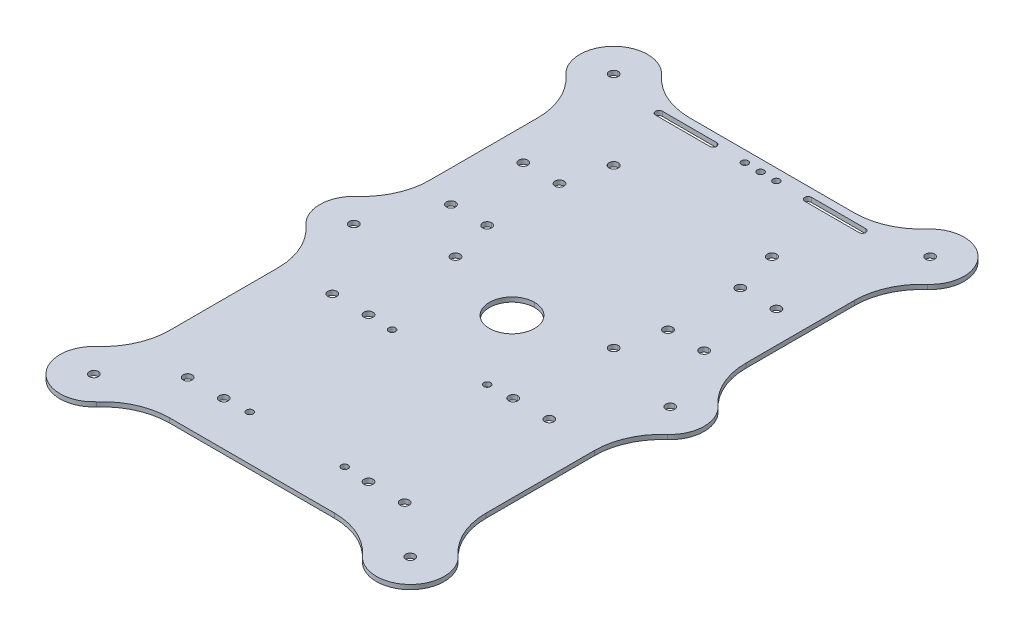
ISO-10303-21;
HEADER;
FILE_DESCRIPTION(('STEP AP214'),'2;1');
FILE_NAME('part.step','',(''),(''),'','','');
FILE_SCHEMA(('AUTOMOTIVE_DESIGN { 1 0 10303 214 1 1 1 1 }'));
ENDSEC;
DATA;
#1=APPLICATION_CONTEXT('core data for automotive mechanical design processes');
#2=APPLICATION_PROTOCOL_DEFINITION('international standard','automotive_design',2000,#1);
#3=PRODUCT_CONTEXT('',#1,'mechanical');
#4=PRODUCT('Part','Part','',(#3));
#5=PRODUCT_RELATED_PRODUCT_CATEGORY('part','',(#4));
#6=PRODUCT_DEFINITION_FORMATION('','',#4);
#7=PRODUCT_DEFINITION_CONTEXT('part definition',#1,'design');
#8=PRODUCT_DEFINITION('design','',#6,#7);
#9=PRODUCT_DEFINITION_SHAPE('','',#8);
#10=(LENGTH_UNIT() NAMED_UNIT(*) SI_UNIT(.MILLI.,.METRE.));
#11=(NAMED_UNIT(*) PLANE_ANGLE_UNIT() SI_UNIT($,.RADIAN.));
#12=(NAMED_UNIT(*) SI_UNIT($,.STERADIAN.) SOLID_ANGLE_UNIT());
#13=UNCERTAINTY_MEASURE_WITH_UNIT(LENGTH_MEASURE(1.E-05),#10,'distance_accuracy_value','');
#14=(GEOMETRIC_REPRESENTATION_CONTEXT(3) GLOBAL_UNCERTAINTY_ASSIGNED_CONTEXT((#13)) GLOBAL_UNIT_ASSIGNED_CONTEXT((#10,
#11,#12)) REPRESENTATION_CONTEXT('',''));
#15=CARTESIAN_POINT('',(0.,0.,0.));
#16=DIRECTION('',(0.,0.,1.));
#17=DIRECTION('',(1.,0.,0.));
#18=AXIS2_PLACEMENT_3D('',#15,#16,#17);
#19=CARTESIAN_POINT('',(259.5917822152,2.,-201.5723382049));
#20=DIRECTION('',(0.,-1.,0.));
#21=DIRECTION('',(0.,0.,-1.));
#22=AXIS2_PLACEMENT_3D('',#19,#20,#21);
#23=CYLINDRICAL_SURFACE('',#22,2.);
#24=CARTESIAN_POINT('',(259.5917822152,2.,-201.5723382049));
#25=DIRECTION('',(0.,-1.,0.));
#26=DIRECTION('',(0.,0.,-1.));
#27=AXIS2_PLACEMENT_3D('',#24,#25,#26);
#28=CIRCLE('',#27,2.);
#29=CARTESIAN_POINT('',(259.5917822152,2.,-203.5723382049));
#30=VERTEX_POINT('',#29);
#31=CARTESIAN_POINT('',(259.5917822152,2.,-199.5723382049));
#32=VERTEX_POINT('',#31);
#33=EDGE_CURVE('E1088',#30,#32,#28,.T.);
#34=ORIENTED_EDGE('',*,*,#33,.F.);
#35=DIRECTION('',(0.,1.,0.));
#36=VECTOR('',#35,1.);
#37=CARTESIAN_POINT('',(259.5917822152,0.,-203.5723382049));
#38=LINE('',#37,#36);
#39=CARTESIAN_POINT('',(259.5917822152,0.,-203.5723382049));
#40=VERTEX_POINT('',#39);
#41=EDGE_CURVE('E11',#40,#30,#38,.T.);
#42=ORIENTED_EDGE('',*,*,#41,.F.);
#43=CARTESIAN_POINT('',(259.5917822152,0.,-201.5723382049));
#44=DIRECTION('',(0.,1.,0.));
#45=DIRECTION('',(0.,0.,1.));
#46=AXIS2_PLACEMENT_3D('',#43,#44,#45);
#47=CIRCLE('',#46,2.);
#48=CARTESIAN_POINT('',(259.5917822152,0.,-199.5723382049));
#49=VERTEX_POINT('',#48);
#50=EDGE_CURVE('E702',#49,#40,#47,.T.);
#51=ORIENTED_EDGE('',*,*,#50,.F.);
#52=DIRECTION('',(0.,1.,0.));
#53=VECTOR('',#52,1.);
#54=CARTESIAN_POINT('',(259.5917822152,0.,-199.5723382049));
#55=LINE('',#54,#53);
#56=EDGE_CURVE('E28',#49,#32,#55,.T.);
#57=ORIENTED_EDGE('',*,*,#56,.T.);
#58=EDGE_LOOP('',(#34,#42,#51,#57));
#59=FACE_BOUND('',#58,.T.);
#60=ADVANCED_FACE('F17',(#59),#23,.F.);
#61=CARTESIAN_POINT('',(259.5917822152,2.,-201.5723382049));
#62=DIRECTION('',(0.,-1.,0.));
#63=DIRECTION('',(0.,0.,-1.));
#64=AXIS2_PLACEMENT_3D('',#61,#62,#63);
#65=CYLINDRICAL_SURFACE('',#64,2.);
#66=ORIENTED_EDGE('',*,*,#56,.F.);
#67=CARTESIAN_POINT('',(259.5917822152,0.,-201.5723382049));
#68=DIRECTION('',(0.,1.,0.));
#69=DIRECTION('',(0.,0.,-1.));
#70=AXIS2_PLACEMENT_3D('',#67,#68,#69);
#71=CIRCLE('',#70,2.);
#72=EDGE_CURVE('E697',#40,#49,#71,.T.);
#73=ORIENTED_EDGE('',*,*,#72,.F.);
#74=ORIENTED_EDGE('',*,*,#41,.T.);
#75=CARTESIAN_POINT('',(259.5917822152,2.,-201.5723382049));
#76=DIRECTION('',(0.,-1.,0.));
#77=DIRECTION('',(0.,0.,1.));
#78=AXIS2_PLACEMENT_3D('',#75,#76,#77);
#79=CIRCLE('',#78,2.);
#80=EDGE_CURVE('E1092',#32,#30,#79,.T.);
#81=ORIENTED_EDGE('',*,*,#80,.F.);
#82=EDGE_LOOP('',(#66,#73,#74,#81));
#83=FACE_BOUND('',#82,.T.);
#84=ADVANCED_FACE('F2170',(#83),#65,.F.);
#85=CARTESIAN_POINT('',(259.5917822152,2.,-137.5723382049));
#86=DIRECTION('',(0.,-1.,0.));
#87=DIRECTION('',(0.,0.,-1.));
#88=AXIS2_PLACEMENT_3D('',#85,#86,#87);
#89=CYLINDRICAL_SURFACE('',#88,2.);
#90=CARTESIAN_POINT('',(259.5917822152,2.,-137.5723382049));
#91=DIRECTION('',(0.,-1.,0.));
#92=DIRECTION('',(0.,0.,-1.));
#93=AXIS2_PLACEMENT_3D('',#90,#91,#92);
#94=CIRCLE('',#93,2.);
#95=CARTESIAN_POINT('',(259.5917822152,2.,-139.5723382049));
#96=VERTEX_POINT('',#95);
#97=CARTESIAN_POINT('',(259.5917822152,2.,-135.5723382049));
#98=VERTEX_POINT('',#97);
#99=EDGE_CURVE('E995',#96,#98,#94,.T.);
#100=ORIENTED_EDGE('',*,*,#99,.F.);
#101=DIRECTION('',(0.,1.,0.));
#102=VECTOR('',#101,1.);
#103=CARTESIAN_POINT('',(259.5917822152,0.,-139.5723382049));
#104=LINE('',#103,#102);
#105=CARTESIAN_POINT('',(259.5917822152,0.,-139.5723382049));
#106=VERTEX_POINT('',#105);
#107=EDGE_CURVE('E1058',#106,#96,#104,.T.);
#108=ORIENTED_EDGE('',*,*,#107,.F.);
#109=CARTESIAN_POINT('',(259.5917822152,0.,-137.5723382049));
#110=DIRECTION('',(0.,1.,0.));
#111=DIRECTION('',(0.,0.,1.));
#112=AXIS2_PLACEMENT_3D('',#109,#110,#111);
#113=CIRCLE('',#112,2.);
#114=CARTESIAN_POINT('',(259.5917822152,0.,-135.5723382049));
#115=VERTEX_POINT('',#114);
#116=EDGE_CURVE('E1096',#115,#106,#113,.T.);
#117=ORIENTED_EDGE('',*,*,#116,.F.);
#118=DIRECTION('',(0.,1.,0.));
#119=VECTOR('',#118,1.);
#120=CARTESIAN_POINT('',(259.5917822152,0.,-135.5723382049));
#121=LINE('',#120,#119);
#122=EDGE_CURVE('E1062',#115,#98,#121,.T.);
#123=ORIENTED_EDGE('',*,*,#122,.T.);
#124=EDGE_LOOP('',(#100,#108,#117,#123));
#125=FACE_BOUND('',#124,.T.);
#126=ADVANCED_FACE('F2175',(#125),#89,.F.);
#127=CARTESIAN_POINT('',(259.5917822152,2.,-137.5723382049));
#128=DIRECTION('',(0.,-1.,0.));
#129=DIRECTION('',(0.,0.,-1.));
#130=AXIS2_PLACEMENT_3D('',#127,#128,#129);
#131=CYLINDRICAL_SURFACE('',#130,2.);
#132=ORIENTED_EDGE('',*,*,#122,.F.);
#133=CARTESIAN_POINT('',(259.5917822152,0.,-137.5723382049));
#134=DIRECTION('',(0.,1.,0.));
#135=DIRECTION('',(0.,0.,-1.));
#136=AXIS2_PLACEMENT_3D('',#133,#134,#135);
#137=CIRCLE('',#136,2.);
#138=EDGE_CURVE('E1100',#106,#115,#137,.T.);
#139=ORIENTED_EDGE('',*,*,#138,.F.);
#140=ORIENTED_EDGE('',*,*,#107,.T.);
#141=CARTESIAN_POINT('',(259.5917822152,2.,-137.5723382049));
#142=DIRECTION('',(0.,-1.,0.));
#143=DIRECTION('',(0.,0.,1.));
#144=AXIS2_PLACEMENT_3D('',#141,#142,#143);
#145=CIRCLE('',#144,2.);
#146=EDGE_CURVE('E990',#98,#96,#145,.T.);
#147=ORIENTED_EDGE('',*,*,#146,.F.);
#148=EDGE_LOOP('',(#132,#139,#140,#147));
#149=FACE_BOUND('',#148,.T.);
#150=ADVANCED_FACE('F2319',(#149),#131,.F.);
#151=CARTESIAN_POINT('',(243.5917822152,2.,-201.5723382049));
#152=DIRECTION('',(0.,-1.,0.));
#153=DIRECTION('',(0.,0.,-1.));
#154=AXIS2_PLACEMENT_3D('',#151,#152,#153);
#155=CYLINDRICAL_SURFACE('',#154,2.);
#156=CARTESIAN_POINT('',(243.5917822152,2.,-201.5723382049));
#157=DIRECTION('',(0.,-1.,0.));
#158=DIRECTION('',(0.,0.,-1.));
#159=AXIS2_PLACEMENT_3D('',#156,#157,#158);
#160=CIRCLE('',#159,2.);
#161=CARTESIAN_POINT('',(243.5917822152,2.,-203.5723382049));
#162=VERTEX_POINT('',#161);
#163=CARTESIAN_POINT('',(243.5917822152,2.,-199.5723382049));
#164=VERTEX_POINT('',#163);
#165=EDGE_CURVE('E725',#162,#164,#160,.T.);
#166=ORIENTED_EDGE('',*,*,#165,.F.);
#167=DIRECTION('',(0.,1.,0.));
#168=VECTOR('',#167,1.);
#169=CARTESIAN_POINT('',(243.5917822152,0.,-203.5723382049));
#170=LINE('',#169,#168);
#171=CARTESIAN_POINT('',(243.5917822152,0.,-203.5723382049));
#172=VERTEX_POINT('',#171);
#173=EDGE_CURVE('E944',#172,#162,#170,.T.);
#174=ORIENTED_EDGE('',*,*,#173,.F.);
#175=CARTESIAN_POINT('',(243.5917822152,0.,-201.5723382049));
#176=DIRECTION('',(0.,1.,0.));
#177=DIRECTION('',(0.,0.,1.));
#178=AXIS2_PLACEMENT_3D('',#175,#176,#177);
#179=CIRCLE('',#178,2.);
#180=CARTESIAN_POINT('',(243.5917822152,0.,-199.5723382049));
#181=VERTEX_POINT('',#180);
#182=EDGE_CURVE('E808',#181,#172,#179,.T.);
#183=ORIENTED_EDGE('',*,*,#182,.F.);
#184=DIRECTION('',(0.,1.,0.));
#185=VECTOR('',#184,1.);
#186=CARTESIAN_POINT('',(243.5917822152,0.,-199.5723382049));
#187=LINE('',#186,#185);
#188=EDGE_CURVE('E856',#181,#164,#187,.T.);
#189=ORIENTED_EDGE('',*,*,#188,.T.);
#190=EDGE_LOOP('',(#166,#174,#183,#189));
#191=FACE_BOUND('',#190,.T.);
#192=ADVANCED_FACE('F19',(#191),#155,.F.);
#193=CARTESIAN_POINT('',(243.5917822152,2.,-201.5723382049));
#194=DIRECTION('',(0.,-1.,0.));
#195=DIRECTION('',(0.,0.,-1.));
#196=AXIS2_PLACEMENT_3D('',#193,#194,#195);
#197=CYLINDRICAL_SURFACE('',#196,2.);
#198=ORIENTED_EDGE('',*,*,#188,.F.);
#199=CARTESIAN_POINT('',(243.5917822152,0.,-201.5723382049));
#200=DIRECTION('',(0.,1.,0.));
#201=DIRECTION('',(0.,0.,-1.));
#202=AXIS2_PLACEMENT_3D('',#199,#200,#201);
#203=CIRCLE('',#202,2.);
#204=EDGE_CURVE('E812',#172,#181,#203,.T.);
#205=ORIENTED_EDGE('',*,*,#204,.F.);
#206=ORIENTED_EDGE('',*,*,#173,.T.);
#207=CARTESIAN_POINT('',(243.5917822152,2.,-201.5723382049));
#208=DIRECTION('',(0.,-1.,0.));
#209=DIRECTION('',(0.,0.,1.));
#210=AXIS2_PLACEMENT_3D('',#207,#208,#209);
#211=CIRCLE('',#210,2.);
#212=EDGE_CURVE('E729',#164,#162,#211,.T.);
#213=ORIENTED_EDGE('',*,*,#212,.F.);
#214=EDGE_LOOP('',(#198,#205,#206,#213));
#215=FACE_BOUND('',#214,.T.);
#216=ADVANCED_FACE('F1774',(#215),#197,.F.);
#217=CARTESIAN_POINT('',(243.5917822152,2.,-137.5723382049));
#218=DIRECTION('',(0.,-1.,0.));
#219=DIRECTION('',(0.,0.,-1.));
#220=AXIS2_PLACEMENT_3D('',#217,#218,#219);
#221=CYLINDRICAL_SURFACE('',#220,2.);
#222=CARTESIAN_POINT('',(243.5917822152,2.,-137.5723382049));
#223=DIRECTION('',(0.,-1.,0.));
#224=DIRECTION('',(0.,0.,-1.));
#225=AXIS2_PLACEMENT_3D('',#222,#223,#224);
#226=CIRCLE('',#225,2.);
#227=CARTESIAN_POINT('',(243.5917822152,2.,-139.5723382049));
#228=VERTEX_POINT('',#227);
#229=CARTESIAN_POINT('',(243.5917822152,2.,-135.5723382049));
#230=VERTEX_POINT('',#229);
#231=EDGE_CURVE('E994',#228,#230,#226,.T.);
#232=ORIENTED_EDGE('',*,*,#231,.F.);
#233=DIRECTION('',(0.,1.,0.));
#234=VECTOR('',#233,1.);
#235=CARTESIAN_POINT('',(243.5917822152,0.,-139.5723382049));
#236=LINE('',#235,#234);
#237=CARTESIAN_POINT('',(243.5917822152,0.,-139.5723382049));
#238=VERTEX_POINT('',#237);
#239=EDGE_CURVE('E853',#238,#228,#236,.T.);
#240=ORIENTED_EDGE('',*,*,#239,.F.);
#241=CARTESIAN_POINT('',(243.5917822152,0.,-137.5723382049));
#242=DIRECTION('',(0.,1.,0.));
#243=DIRECTION('',(0.,0.,1.));
#244=AXIS2_PLACEMENT_3D('',#241,#242,#243);
#245=CIRCLE('',#244,2.);
#246=CARTESIAN_POINT('',(243.5917822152,0.,-135.5723382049));
#247=VERTEX_POINT('',#246);
#248=EDGE_CURVE('E917',#247,#238,#245,.T.);
#249=ORIENTED_EDGE('',*,*,#248,.F.);
#250=DIRECTION('',(0.,1.,0.));
#251=VECTOR('',#250,1.);
#252=CARTESIAN_POINT('',(243.5917822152,0.,-135.5723382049));
#253=LINE('',#252,#251);
#254=EDGE_CURVE('E857',#247,#230,#253,.T.);
#255=ORIENTED_EDGE('',*,*,#254,.T.);
#256=EDGE_LOOP('',(#232,#240,#249,#255));
#257=FACE_BOUND('',#256,.T.);
#258=ADVANCED_FACE('F2164',(#257),#221,.F.);
#259=CARTESIAN_POINT('',(243.5917822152,2.,-137.5723382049));
#260=DIRECTION('',(0.,-1.,0.));
#261=DIRECTION('',(0.,0.,-1.));
#262=AXIS2_PLACEMENT_3D('',#259,#260,#261);
#263=CYLINDRICAL_SURFACE('',#262,2.);
#264=ORIENTED_EDGE('',*,*,#254,.F.);
#265=CARTESIAN_POINT('',(243.5917822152,0.,-137.5723382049));
#266=DIRECTION('',(0.,1.,0.));
#267=DIRECTION('',(0.,0.,-1.));
#268=AXIS2_PLACEMENT_3D('',#265,#266,#267);
#269=CIRCLE('',#268,2.);
#270=EDGE_CURVE('E813',#238,#247,#269,.T.);
#271=ORIENTED_EDGE('',*,*,#270,.F.);
#272=ORIENTED_EDGE('',*,*,#239,.T.);
#273=CARTESIAN_POINT('',(243.5917822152,2.,-137.5723382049));
#274=DIRECTION('',(0.,-1.,0.));
#275=DIRECTION('',(0.,0.,1.));
#276=AXIS2_PLACEMENT_3D('',#273,#274,#275);
#277=CIRCLE('',#276,2.);
#278=EDGE_CURVE('E929',#230,#228,#277,.T.);
#279=ORIENTED_EDGE('',*,*,#278,.F.);
#280=EDGE_LOOP('',(#264,#271,#272,#279));
#281=FACE_BOUND('',#280,.T.);
#282=ADVANCED_FACE('F2155',(#281),#263,.F.);
#283=CARTESIAN_POINT('',(163.5917822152,2.,-201.5723382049));
#284=DIRECTION('',(0.,-1.,0.));
#285=DIRECTION('',(0.,0.,-1.));
#286=AXIS2_PLACEMENT_3D('',#283,#284,#285);
#287=CYLINDRICAL_SURFACE('',#286,2.);
#288=CARTESIAN_POINT('',(163.5917822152,2.,-201.5723382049));
#289=DIRECTION('',(0.,-1.,0.));
#290=DIRECTION('',(0.,0.,-1.));
#291=AXIS2_PLACEMENT_3D('',#288,#289,#290);
#292=CIRCLE('',#291,2.);
#293=CARTESIAN_POINT('',(163.5917822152,2.,-203.5723382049));
#294=VERTEX_POINT('',#293);
#295=CARTESIAN_POINT('',(163.5917822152,2.,-199.5723382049));
#296=VERTEX_POINT('',#295);
#297=EDGE_CURVE('E1519',#294,#296,#292,.T.);
#298=ORIENTED_EDGE('',*,*,#297,.F.);
#299=DIRECTION('',(0.,1.,0.));
#300=VECTOR('',#299,1.);
#301=CARTESIAN_POINT('',(163.5917822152,0.,-203.5723382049));
#302=LINE('',#301,#300);
#303=CARTESIAN_POINT('',(163.5917822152,0.,-203.5723382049));
#304=VERTEX_POINT('',#303);
#305=EDGE_CURVE('E1143',#304,#294,#302,.T.);
#306=ORIENTED_EDGE('',*,*,#305,.F.);
#307=CARTESIAN_POINT('',(163.5917822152,0.,-201.5723382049));
#308=DIRECTION('',(0.,1.,0.));
#309=DIRECTION('',(0.,0.,1.));
#310=AXIS2_PLACEMENT_3D('',#307,#308,#309);
#311=CIRCLE('',#310,2.);
#312=CARTESIAN_POINT('',(163.5917822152,0.,-199.5723382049));
#313=VERTEX_POINT('',#312);
#314=EDGE_CURVE('E918',#313,#304,#311,.T.);
#315=ORIENTED_EDGE('',*,*,#314,.F.);
#316=DIRECTION('',(0.,1.,0.));
#317=VECTOR('',#316,1.);
#318=CARTESIAN_POINT('',(163.5917822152,0.,-199.5723382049));
#319=LINE('',#318,#317);
#320=EDGE_CURVE('E1018',#313,#296,#319,.T.);
#321=ORIENTED_EDGE('',*,*,#320,.T.);
#322=EDGE_LOOP('',(#298,#306,#315,#321));
#323=FACE_BOUND('',#322,.T.);
#324=ADVANCED_FACE('F2153',(#323),#287,.F.);
#325=CARTESIAN_POINT('',(163.5917822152,2.,-201.5723382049));
#326=DIRECTION('',(0.,-1.,0.));
#327=DIRECTION('',(0.,0.,-1.));
#328=AXIS2_PLACEMENT_3D('',#325,#326,#327);
#329=CYLINDRICAL_SURFACE('',#328,2.);
#330=ORIENTED_EDGE('',*,*,#320,.F.);
#331=CARTESIAN_POINT('',(163.5917822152,0.,-201.5723382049));
#332=DIRECTION('',(0.,1.,0.));
#333=DIRECTION('',(0.,0.,-1.));
#334=AXIS2_PLACEMENT_3D('',#331,#332,#333);
#335=CIRCLE('',#334,2.);
#336=EDGE_CURVE('E913',#304,#313,#335,.T.);
#337=ORIENTED_EDGE('',*,*,#336,.F.);
#338=ORIENTED_EDGE('',*,*,#305,.T.);
#339=CARTESIAN_POINT('',(163.5917822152,2.,-201.5723382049));
#340=DIRECTION('',(0.,-1.,0.));
#341=DIRECTION('',(0.,0.,1.));
#342=AXIS2_PLACEMENT_3D('',#339,#340,#341);
#343=CIRCLE('',#342,2.);
#344=EDGE_CURVE('E730',#296,#294,#343,.T.);
#345=ORIENTED_EDGE('',*,*,#344,.F.);
#346=EDGE_LOOP('',(#330,#337,#338,#345));
#347=FACE_BOUND('',#346,.T.);
#348=ADVANCED_FACE('F2148',(#347),#329,.F.);
#349=CARTESIAN_POINT('',(163.5917822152,2.,-137.5723382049));
#350=DIRECTION('',(0.,-1.,0.));
#351=DIRECTION('',(0.,0.,-1.));
#352=AXIS2_PLACEMENT_3D('',#349,#350,#351);
#353=CYLINDRICAL_SURFACE('',#352,2.);
#354=CARTESIAN_POINT('',(163.5917822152,2.,-137.5723382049));
#355=DIRECTION('',(0.,-1.,0.));
#356=DIRECTION('',(0.,0.,-1.));
#357=AXIS2_PLACEMENT_3D('',#354,#355,#356);
#358=CIRCLE('',#357,2.);
#359=CARTESIAN_POINT('',(163.5917822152,2.,-139.5723382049));
#360=VERTEX_POINT('',#359);
#361=CARTESIAN_POINT('',(163.5917822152,2.,-135.5723382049));
#362=VERTEX_POINT('',#361);
#363=EDGE_CURVE('E924',#360,#362,#358,.T.);
#364=ORIENTED_EDGE('',*,*,#363,.F.);
#365=DIRECTION('',(0.,1.,0.));
#366=VECTOR('',#365,1.);
#367=CARTESIAN_POINT('',(163.5917822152,0.,-139.5723382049));
#368=LINE('',#367,#366);
#369=CARTESIAN_POINT('',(163.5917822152,0.,-139.5723382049));
#370=VERTEX_POINT('',#369);
#371=EDGE_CURVE('E1015',#370,#360,#368,.T.);
#372=ORIENTED_EDGE('',*,*,#371,.F.);
#373=CARTESIAN_POINT('',(163.5917822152,0.,-137.5723382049));
#374=DIRECTION('',(0.,1.,0.));
#375=DIRECTION('',(0.,0.,1.));
#376=AXIS2_PLACEMENT_3D('',#373,#374,#375);
#377=CIRCLE('',#376,2.);
#378=CARTESIAN_POINT('',(163.5917822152,0.,-135.5723382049));
#379=VERTEX_POINT('',#378);
#380=EDGE_CURVE('E1087',#379,#370,#377,.T.);
#381=ORIENTED_EDGE('',*,*,#380,.F.);
#382=DIRECTION('',(0.,1.,0.));
#383=VECTOR('',#382,1.);
#384=CARTESIAN_POINT('',(163.5917822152,0.,-135.5723382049));
#385=LINE('',#384,#383);
#386=EDGE_CURVE('E1019',#379,#362,#385,.T.);
#387=ORIENTED_EDGE('',*,*,#386,.T.);
#388=EDGE_LOOP('',(#364,#372,#381,#387));
#389=FACE_BOUND('',#388,.T.);
#390=ADVANCED_FACE('F2162',(#389),#353,.F.);
#391=CARTESIAN_POINT('',(163.5917822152,2.,-137.5723382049));
#392=DIRECTION('',(0.,-1.,0.));
#393=DIRECTION('',(0.,0.,-1.));
#394=AXIS2_PLACEMENT_3D('',#391,#392,#393);
#395=CYLINDRICAL_SURFACE('',#394,2.);
#396=ORIENTED_EDGE('',*,*,#386,.F.);
#397=CARTESIAN_POINT('',(163.5917822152,0.,-137.5723382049));
#398=DIRECTION('',(0.,1.,0.));
#399=DIRECTION('',(0.,0.,-1.));
#400=AXIS2_PLACEMENT_3D('',#397,#398,#399);
#401=CIRCLE('',#400,2.);
#402=EDGE_CURVE('E1083',#370,#379,#401,.T.);
#403=ORIENTED_EDGE('',*,*,#402,.F.);
#404=ORIENTED_EDGE('',*,*,#371,.T.);
#405=CARTESIAN_POINT('',(163.5917822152,2.,-137.5723382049));
#406=DIRECTION('',(0.,-1.,0.));
#407=DIRECTION('',(0.,0.,1.));
#408=AXIS2_PLACEMENT_3D('',#405,#406,#407);
#409=CIRCLE('',#408,2.);
#410=EDGE_CURVE('E928',#362,#360,#409,.T.);
#411=ORIENTED_EDGE('',*,*,#410,.F.);
#412=EDGE_LOOP('',(#396,#403,#404,#411));
#413=FACE_BOUND('',#412,.T.);
#414=ADVANCED_FACE('F2451',(#413),#395,.F.);
#415=CARTESIAN_POINT('',(179.5917822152,2.,-201.5723382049));
#416=DIRECTION('',(0.,-1.,0.));
#417=DIRECTION('',(0.,0.,-1.));
#418=AXIS2_PLACEMENT_3D('',#415,#416,#417);
#419=CYLINDRICAL_SURFACE('',#418,2.);
#420=CARTESIAN_POINT('',(179.5917822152,2.,-201.5723382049));
#421=DIRECTION('',(0.,-1.,0.));
#422=DIRECTION('',(0.,0.,-1.));
#423=AXIS2_PLACEMENT_3D('',#420,#421,#422);
#424=CIRCLE('',#423,2.);
#425=CARTESIAN_POINT('',(179.5917822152,2.,-203.5723382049));
#426=VERTEX_POINT('',#425);
#427=CARTESIAN_POINT('',(179.5917822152,2.,-199.5723382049));
#428=VERTEX_POINT('',#427);
#429=EDGE_CURVE('E1344',#426,#428,#424,.T.);
#430=ORIENTED_EDGE('',*,*,#429,.F.);
#431=DIRECTION('',(0.,1.,0.));
#432=VECTOR('',#431,1.);
#433=CARTESIAN_POINT('',(179.5917822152,0.,-203.5723382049));
#434=LINE('',#433,#432);
#435=CARTESIAN_POINT('',(179.5917822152,0.,-203.5723382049));
#436=VERTEX_POINT('',#435);
#437=EDGE_CURVE('E1352',#436,#426,#434,.T.);
#438=ORIENTED_EDGE('',*,*,#437,.F.);
#439=CARTESIAN_POINT('',(179.5917822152,0.,-201.5723382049));
#440=DIRECTION('',(0.,1.,0.));
#441=DIRECTION('',(0.,0.,1.));
#442=AXIS2_PLACEMENT_3D('',#439,#440,#441);
#443=CIRCLE('',#442,2.);
#444=CARTESIAN_POINT('',(179.5917822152,0.,-199.5723382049));
#445=VERTEX_POINT('',#444);
#446=EDGE_CURVE('E1317',#445,#436,#443,.T.);
#447=ORIENTED_EDGE('',*,*,#446,.F.);
#448=DIRECTION('',(0.,1.,0.));
#449=VECTOR('',#448,1.);
#450=CARTESIAN_POINT('',(179.5917822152,0.,-199.5723382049));
#451=LINE('',#450,#449);
#452=EDGE_CURVE('E1321',#445,#428,#451,.T.);
#453=ORIENTED_EDGE('',*,*,#452,.T.);
#454=EDGE_LOOP('',(#430,#438,#447,#453));
#455=FACE_BOUND('',#454,.T.);
#456=ADVANCED_FACE('F2242',(#455),#419,.F.);
#457=CARTESIAN_POINT('',(179.5917822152,2.,-201.5723382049));
#458=DIRECTION('',(0.,-1.,0.));
#459=DIRECTION('',(0.,0.,-1.));
#460=AXIS2_PLACEMENT_3D('',#457,#458,#459);
#461=CYLINDRICAL_SURFACE('',#460,2.);
#462=ORIENTED_EDGE('',*,*,#452,.F.);
#463=CARTESIAN_POINT('',(179.5917822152,0.,-201.5723382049));
#464=DIRECTION('',(0.,1.,0.));
#465=DIRECTION('',(0.,0.,-1.));
#466=AXIS2_PLACEMENT_3D('',#463,#464,#465);
#467=CIRCLE('',#466,2.);
#468=EDGE_CURVE('E1531',#436,#445,#467,.T.);
#469=ORIENTED_EDGE('',*,*,#468,.F.);
#470=ORIENTED_EDGE('',*,*,#437,.T.);
#471=CARTESIAN_POINT('',(179.5917822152,2.,-201.5723382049));
#472=DIRECTION('',(0.,-1.,0.));
#473=DIRECTION('',(0.,0.,1.));
#474=AXIS2_PLACEMENT_3D('',#471,#472,#473);
#475=CIRCLE('',#474,2.);
#476=EDGE_CURVE('E1348',#428,#426,#475,.T.);
#477=ORIENTED_EDGE('',*,*,#476,.F.);
#478=EDGE_LOOP('',(#462,#469,#470,#477));
#479=FACE_BOUND('',#478,.T.);
#480=ADVANCED_FACE('F2238',(#479),#461,.F.);
#481=CARTESIAN_POINT('',(179.5917822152,2.,-137.5723382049));
#482=DIRECTION('',(0.,-1.,0.));
#483=DIRECTION('',(0.,0.,-1.));
#484=AXIS2_PLACEMENT_3D('',#481,#482,#483);
#485=CYLINDRICAL_SURFACE('',#484,2.);
#486=CARTESIAN_POINT('',(179.5917822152,2.,-137.5723382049));
#487=DIRECTION('',(0.,-1.,0.));
#488=DIRECTION('',(0.,0.,-1.));
#489=AXIS2_PLACEMENT_3D('',#486,#487,#488);
#490=CIRCLE('',#489,2.);
#491=CARTESIAN_POINT('',(179.5917822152,2.,-139.5723382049));
#492=VERTEX_POINT('',#491);
#493=CARTESIAN_POINT('',(179.5917822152,2.,-135.5723382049));
#494=VERTEX_POINT('',#493);
#495=EDGE_CURVE('E818',#492,#494,#490,.T.);
#496=ORIENTED_EDGE('',*,*,#495,.F.);
#497=DIRECTION('',(0.,1.,0.));
#498=VECTOR('',#497,1.);
#499=CARTESIAN_POINT('',(179.5917822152,0.,-139.5723382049));
#500=LINE('',#499,#498);
#501=CARTESIAN_POINT('',(179.5917822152,0.,-139.5723382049));
#502=VERTEX_POINT('',#501);
#503=EDGE_CURVE('E1318',#502,#492,#500,.T.);
#504=ORIENTED_EDGE('',*,*,#503,.F.);
#505=CARTESIAN_POINT('',(179.5917822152,0.,-137.5723382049));
#506=DIRECTION('',(0.,1.,0.));
#507=DIRECTION('',(0.,0.,1.));
#508=AXIS2_PLACEMENT_3D('',#505,#506,#507);
#509=CIRCLE('',#508,2.);
#510=CARTESIAN_POINT('',(179.5917822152,0.,-135.5723382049));
#511=VERTEX_POINT('',#510);
#512=EDGE_CURVE('E1035',#511,#502,#509,.T.);
#513=ORIENTED_EDGE('',*,*,#512,.F.);
#514=DIRECTION('',(0.,1.,0.));
#515=VECTOR('',#514,1.);
#516=CARTESIAN_POINT('',(179.5917822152,0.,-135.5723382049));
#517=LINE('',#516,#515);
#518=EDGE_CURVE('E1322',#511,#494,#517,.T.);
#519=ORIENTED_EDGE('',*,*,#518,.T.);
#520=EDGE_LOOP('',(#496,#504,#513,#519));
#521=FACE_BOUND('',#520,.T.);
#522=ADVANCED_FACE('F2241',(#521),#485,.F.);
#523=CARTESIAN_POINT('',(179.5917822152,2.,-137.5723382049));
#524=DIRECTION('',(0.,-1.,0.));
#525=DIRECTION('',(0.,0.,-1.));
#526=AXIS2_PLACEMENT_3D('',#523,#524,#525);
#527=CYLINDRICAL_SURFACE('',#526,2.);
#528=ORIENTED_EDGE('',*,*,#518,.F.);
#529=CARTESIAN_POINT('',(179.5917822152,0.,-137.5723382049));
#530=DIRECTION('',(0.,1.,0.));
#531=DIRECTION('',(0.,0.,-1.));
#532=AXIS2_PLACEMENT_3D('',#529,#530,#531);
#533=CIRCLE('',#532,2.);
#534=EDGE_CURVE('E1039',#502,#511,#533,.T.);
#535=ORIENTED_EDGE('',*,*,#534,.F.);
#536=ORIENTED_EDGE('',*,*,#503,.T.);
#537=CARTESIAN_POINT('',(179.5917822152,2.,-137.5723382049));
#538=DIRECTION('',(0.,-1.,0.));
#539=DIRECTION('',(0.,0.,1.));
#540=AXIS2_PLACEMENT_3D('',#537,#538,#539);
#541=CIRCLE('',#540,2.);
#542=EDGE_CURVE('E814',#494,#492,#541,.T.);
#543=ORIENTED_EDGE('',*,*,#542,.F.);
#544=EDGE_LOOP('',(#528,#535,#536,#543));
#545=FACE_BOUND('',#544,.T.);
#546=ADVANCED_FACE('F2229',(#545),#527,.F.);
#547=CARTESIAN_POINT('',(211.5917833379,2.,-233.0723382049));
#548=DIRECTION('',(0.,-1.,0.));
#549=DIRECTION('',(0.,0.,-1.));
#550=AXIS2_PLACEMENT_3D('',#547,#548,#549);
#551=CYLINDRICAL_SURFACE('',#550,10.);
#552=CARTESIAN_POINT('',(211.5917833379,2.,-233.0723382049));
#553=DIRECTION('',(0.,-1.,0.));
#554=DIRECTION('',(0.,0.,-1.));
#555=AXIS2_PLACEMENT_3D('',#552,#553,#554);
#556=CIRCLE('',#555,10.);
#557=CARTESIAN_POINT('',(211.5917833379,2.,-243.0723382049));
#558=VERTEX_POINT('',#557);
#559=CARTESIAN_POINT('',(211.5917833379,2.,-223.0723382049));
#560=VERTEX_POINT('',#559);
#561=EDGE_CURVE('E1581',#558,#560,#556,.T.);
#562=ORIENTED_EDGE('',*,*,#561,.F.);
#563=DIRECTION('',(0.,1.,0.));
#564=VECTOR('',#563,1.);
#565=CARTESIAN_POINT('',(211.5917833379,0.,-243.0723382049));
#566=LINE('',#565,#564);
#567=CARTESIAN_POINT('',(211.5917833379,0.,-243.0723382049));
#568=VERTEX_POINT('',#567);
#569=EDGE_CURVE('E21',#568,#558,#566,.T.);
#570=ORIENTED_EDGE('',*,*,#569,.F.);
#571=CARTESIAN_POINT('',(211.5917833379,0.,-233.0723382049));
#572=DIRECTION('',(0.,1.,0.));
#573=DIRECTION('',(0.,0.,1.));
#574=AXIS2_PLACEMENT_3D('',#571,#572,#573);
#575=CIRCLE('',#574,10.);
#576=CARTESIAN_POINT('',(211.5917833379,0.,-223.0723382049));
#577=VERTEX_POINT('',#576);
#578=EDGE_CURVE('E1235',#577,#568,#575,.T.);
#579=ORIENTED_EDGE('',*,*,#578,.F.);
#580=DIRECTION('',(0.,1.,0.));
#581=VECTOR('',#580,1.);
#582=CARTESIAN_POINT('',(211.5917833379,0.,-223.0723382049));
#583=LINE('',#582,#581);
#584=EDGE_CURVE('E1377',#577,#560,#583,.T.);
#585=ORIENTED_EDGE('',*,*,#584,.T.);
#586=EDGE_LOOP('',(#562,#570,#579,#585));
#587=FACE_BOUND('',#586,.T.);
#588=ADVANCED_FACE('F2225',(#587),#551,.F.);
#589=CARTESIAN_POINT('',(211.5917833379,2.,-233.0723382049));
#590=DIRECTION('',(0.,-1.,0.));
#591=DIRECTION('',(0.,0.,-1.));
#592=AXIS2_PLACEMENT_3D('',#589,#590,#591);
#593=CYLINDRICAL_SURFACE('',#592,10.);
#594=ORIENTED_EDGE('',*,*,#584,.F.);
#595=CARTESIAN_POINT('',(211.5917833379,0.,-233.0723382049));
#596=DIRECTION('',(0.,1.,0.));
#597=DIRECTION('',(0.,0.,-1.));
#598=AXIS2_PLACEMENT_3D('',#595,#596,#597);
#599=CIRCLE('',#598,10.);
#600=EDGE_CURVE('E1040',#568,#577,#599,.T.);
#601=ORIENTED_EDGE('',*,*,#600,.F.);
#602=ORIENTED_EDGE('',*,*,#569,.T.);
#603=CARTESIAN_POINT('',(211.5917833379,2.,-233.0723382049));
#604=DIRECTION('',(0.,-1.,0.));
#605=DIRECTION('',(0.,0.,1.));
#606=AXIS2_PLACEMENT_3D('',#603,#604,#605);
#607=CIRCLE('',#606,10.);
#608=EDGE_CURVE('E1349',#560,#558,#607,.T.);
#609=ORIENTED_EDGE('',*,*,#608,.F.);
#610=EDGE_LOOP('',(#594,#601,#602,#609));
#611=FACE_BOUND('',#610,.T.);
#612=ADVANCED_FACE('F2228',(#611),#593,.F.);
#613=CARTESIAN_POINT('',(232.591783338,2.,-138.0723382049));
#614=DIRECTION('',(0.,-1.,0.));
#615=DIRECTION('',(0.,0.,-1.));
#616=AXIS2_PLACEMENT_3D('',#613,#614,#615);
#617=CYLINDRICAL_SURFACE('',#616,1.5);
#618=CARTESIAN_POINT('',(232.591783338,2.,-138.0723382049));
#619=DIRECTION('',(0.,-1.,0.));
#620=DIRECTION('',(0.,0.,-1.));
#621=AXIS2_PLACEMENT_3D('',#618,#619,#620);
#622=CIRCLE('',#621,1.5);
#623=CARTESIAN_POINT('',(232.591783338,2.,-139.5723382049));
#624=VERTEX_POINT('',#623);
#625=CARTESIAN_POINT('',(232.591783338,2.,-136.5723382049));
#626=VERTEX_POINT('',#625);
#627=EDGE_CURVE('E801',#624,#626,#622,.T.);
#628=ORIENTED_EDGE('',*,*,#627,.F.);
#629=DIRECTION('',(0.,1.,0.));
#630=VECTOR('',#629,1.);
#631=CARTESIAN_POINT('',(232.591783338,0.,-139.5723382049));
#632=LINE('',#631,#630);
#633=CARTESIAN_POINT('',(232.591783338,0.,-139.5723382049));
#634=VERTEX_POINT('',#633);
#635=EDGE_CURVE('E1202',#634,#624,#632,.T.);
#636=ORIENTED_EDGE('',*,*,#635,.F.);
#637=CARTESIAN_POINT('',(232.591783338,0.,-138.0723382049));
#638=DIRECTION('',(0.,1.,0.));
#639=DIRECTION('',(0.,0.,1.));
#640=AXIS2_PLACEMENT_3D('',#637,#638,#639);
#641=CIRCLE('',#640,1.5);
#642=CARTESIAN_POINT('',(232.591783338,0.,-136.5723382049));
#643=VERTEX_POINT('',#642);
#644=EDGE_CURVE('E1626',#643,#634,#641,.T.);
#645=ORIENTED_EDGE('',*,*,#644,.F.);
#646=DIRECTION('',(0.,1.,0.));
#647=VECTOR('',#646,1.);
#648=CARTESIAN_POINT('',(232.591783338,0.,-136.5723382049));
#649=LINE('',#648,#647);
#650=EDGE_CURVE('E922',#643,#626,#649,.T.);
#651=ORIENTED_EDGE('',*,*,#650,.T.);
#652=EDGE_LOOP('',(#628,#636,#645,#651));
#653=FACE_BOUND('',#652,.T.);
#654=ADVANCED_FACE('F2346',(#653),#617,.F.);
#655=CARTESIAN_POINT('',(232.591783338,2.,-138.0723382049));
#656=DIRECTION('',(0.,-1.,0.));
#657=DIRECTION('',(0.,0.,-1.));
#658=AXIS2_PLACEMENT_3D('',#655,#656,#657);
#659=CYLINDRICAL_SURFACE('',#658,1.5);
#660=ORIENTED_EDGE('',*,*,#650,.F.);
#661=CARTESIAN_POINT('',(232.591783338,0.,-138.0723382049));
#662=DIRECTION('',(0.,1.,0.));
#663=DIRECTION('',(0.,0.,-1.));
#664=AXIS2_PLACEMENT_3D('',#661,#662,#663);
#665=CIRCLE('',#664,1.5);
#666=EDGE_CURVE('E1537',#634,#643,#665,.T.);
#667=ORIENTED_EDGE('',*,*,#666,.F.);
#668=ORIENTED_EDGE('',*,*,#635,.T.);
#669=CARTESIAN_POINT('',(232.591783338,2.,-138.0723382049));
#670=DIRECTION('',(0.,-1.,0.));
#671=DIRECTION('',(0.,0.,1.));
#672=AXIS2_PLACEMENT_3D('',#669,#670,#671);
#673=CIRCLE('',#672,1.5);
#674=EDGE_CURVE('E796',#626,#624,#673,.T.);
#675=ORIENTED_EDGE('',*,*,#674,.F.);
#676=EDGE_LOOP('',(#660,#667,#668,#675));
#677=FACE_BOUND('',#676,.T.);
#678=ADVANCED_FACE('F2349',(#677),#659,.F.);
#679=CARTESIAN_POINT('',(190.591783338,2.,-138.0723382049));
#680=DIRECTION('',(0.,-1.,0.));
#681=DIRECTION('',(0.,0.,-1.));
#682=AXIS2_PLACEMENT_3D('',#679,#680,#681);
#683=CYLINDRICAL_SURFACE('',#682,1.5);
#684=CARTESIAN_POINT('',(190.591783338,2.,-138.0723382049));
#685=DIRECTION('',(0.,-1.,0.));
#686=DIRECTION('',(0.,0.,-1.));
#687=AXIS2_PLACEMENT_3D('',#684,#685,#686);
#688=CIRCLE('',#687,1.5);
#689=CARTESIAN_POINT('',(190.591783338,2.,-139.5723382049));
#690=VERTEX_POINT('',#689);
#691=CARTESIAN_POINT('',(190.591783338,2.,-136.5723382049));
#692=VERTEX_POINT('',#691);
#693=EDGE_CURVE('E1243',#690,#692,#688,.T.);
#694=ORIENTED_EDGE('',*,*,#693,.F.);
#695=DIRECTION('',(0.,1.,0.));
#696=VECTOR('',#695,1.);
#697=CARTESIAN_POINT('',(190.591783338,0.,-139.5723382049));
#698=LINE('',#697,#696);
#699=CARTESIAN_POINT('',(190.591783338,0.,-139.5723382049));
#700=VERTEX_POINT('',#699);
#701=EDGE_CURVE('E919',#700,#690,#698,.T.);
#702=ORIENTED_EDGE('',*,*,#701,.F.);
#703=CARTESIAN_POINT('',(190.591783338,0.,-138.0723382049));
#704=DIRECTION('',(0.,1.,0.));
#705=DIRECTION('',(0.,0.,1.));
#706=AXIS2_PLACEMENT_3D('',#703,#704,#705);
#707=CIRCLE('',#706,1.5);
#708=CARTESIAN_POINT('',(190.591783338,0.,-136.5723382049));
#709=VERTEX_POINT('',#708);
#710=EDGE_CURVE('E1139',#709,#700,#707,.T.);
#711=ORIENTED_EDGE('',*,*,#710,.F.);
#712=DIRECTION('',(0.,1.,0.));
#713=VECTOR('',#712,1.);
#714=CARTESIAN_POINT('',(190.591783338,0.,-136.5723382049));
#715=LINE('',#714,#713);
#716=EDGE_CURVE('E923',#709,#692,#715,.T.);
#717=ORIENTED_EDGE('',*,*,#716,.T.);
#718=EDGE_LOOP('',(#694,#702,#711,#717));
#719=FACE_BOUND('',#718,.T.);
#720=ADVANCED_FACE('F2389',(#719),#683,.F.);
#721=CARTESIAN_POINT('',(190.591783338,2.,-138.0723382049));
#722=DIRECTION('',(0.,-1.,0.));
#723=DIRECTION('',(0.,0.,-1.));
#724=AXIS2_PLACEMENT_3D('',#721,#722,#723);
#725=CYLINDRICAL_SURFACE('',#724,1.5);
#726=ORIENTED_EDGE('',*,*,#716,.F.);
#727=CARTESIAN_POINT('',(190.591783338,0.,-138.0723382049));
#728=DIRECTION('',(0.,1.,0.));
#729=DIRECTION('',(0.,0.,-1.));
#730=AXIS2_PLACEMENT_3D('',#727,#728,#729);
#731=CIRCLE('',#730,1.5);
#732=EDGE_CURVE('E1183',#700,#709,#731,.T.);
#733=ORIENTED_EDGE('',*,*,#732,.F.);
#734=ORIENTED_EDGE('',*,*,#701,.T.);
#735=CARTESIAN_POINT('',(190.591783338,2.,-138.0723382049));
#736=DIRECTION('',(0.,-1.,0.));
#737=DIRECTION('',(0.,0.,1.));
#738=AXIS2_PLACEMENT_3D('',#735,#736,#737);
#739=CIRCLE('',#738,1.5);
#740=EDGE_CURVE('E1577',#692,#690,#739,.T.);
#741=ORIENTED_EDGE('',*,*,#740,.F.);
#742=EDGE_LOOP('',(#726,#733,#734,#741));
#743=FACE_BOUND('',#742,.T.);
#744=ADVANCED_FACE('F2399',(#743),#725,.F.);
#745=CARTESIAN_POINT('',(232.591783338,2.,-201.0723382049));
#746=DIRECTION('',(0.,-1.,0.));
#747=DIRECTION('',(0.,0.,-1.));
#748=AXIS2_PLACEMENT_3D('',#745,#746,#747);
#749=CYLINDRICAL_SURFACE('',#748,1.5);
#750=CARTESIAN_POINT('',(232.591783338,2.,-201.0723382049));
#751=DIRECTION('',(0.,-1.,0.));
#752=DIRECTION('',(0.,0.,-1.));
#753=AXIS2_PLACEMENT_3D('',#750,#751,#752);
#754=CIRCLE('',#753,1.5);
#755=CARTESIAN_POINT('',(232.591783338,2.,-202.5723382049));
#756=VERTEX_POINT('',#755);
#757=CARTESIAN_POINT('',(232.591783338,2.,-199.5723382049));
#758=VERTEX_POINT('',#757);
#759=EDGE_CURVE('E800',#756,#758,#754,.T.);
#760=ORIENTED_EDGE('',*,*,#759,.F.);
#761=DIRECTION('',(0.,1.,0.));
#762=VECTOR('',#761,1.);
#763=CARTESIAN_POINT('',(232.591783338,0.,-202.5723382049));
#764=LINE('',#763,#762);
#765=CARTESIAN_POINT('',(232.591783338,0.,-202.5723382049));
#766=VERTEX_POINT('',#765);
#767=EDGE_CURVE('E1028',#766,#756,#764,.T.);
#768=ORIENTED_EDGE('',*,*,#767,.F.);
#769=CARTESIAN_POINT('',(232.591783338,0.,-201.0723382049));
#770=DIRECTION('',(0.,1.,0.));
#771=DIRECTION('',(0.,0.,1.));
#772=AXIS2_PLACEMENT_3D('',#769,#770,#771);
#773=CIRCLE('',#772,1.5);
#774=CARTESIAN_POINT('',(232.591783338,0.,-199.5723382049));
#775=VERTEX_POINT('',#774);
#776=EDGE_CURVE('E1131',#775,#766,#773,.T.);
#777=ORIENTED_EDGE('',*,*,#776,.F.);
#778=DIRECTION('',(0.,1.,0.));
#779=VECTOR('',#778,1.);
#780=CARTESIAN_POINT('',(232.591783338,0.,-199.5723382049));
#781=LINE('',#780,#779);
#782=EDGE_CURVE('E712',#775,#758,#781,.T.);
#783=ORIENTED_EDGE('',*,*,#782,.T.);
#784=EDGE_LOOP('',(#760,#768,#777,#783));
#785=FACE_BOUND('',#784,.T.);
#786=ADVANCED_FACE('F2396',(#785),#749,.F.);
#787=CARTESIAN_POINT('',(232.591783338,2.,-201.0723382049));
#788=DIRECTION('',(0.,-1.,0.));
#789=DIRECTION('',(0.,0.,-1.));
#790=AXIS2_PLACEMENT_3D('',#787,#788,#789);
#791=CYLINDRICAL_SURFACE('',#790,1.5);
#792=ORIENTED_EDGE('',*,*,#782,.F.);
#793=CARTESIAN_POINT('',(232.591783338,0.,-201.0723382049));
#794=DIRECTION('',(0.,1.,0.));
#795=DIRECTION('',(0.,0.,-1.));
#796=AXIS2_PLACEMENT_3D('',#793,#794,#795);
#797=CIRCLE('',#796,1.5);
#798=EDGE_CURVE('E1135',#766,#775,#797,.T.);
#799=ORIENTED_EDGE('',*,*,#798,.F.);
#800=ORIENTED_EDGE('',*,*,#767,.T.);
#801=CARTESIAN_POINT('',(232.591783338,2.,-201.0723382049));
#802=DIRECTION('',(0.,-1.,0.));
#803=DIRECTION('',(0.,0.,1.));
#804=AXIS2_PLACEMENT_3D('',#801,#802,#803);
#805=CIRCLE('',#804,1.5);
#806=EDGE_CURVE('E963',#758,#756,#805,.T.);
#807=ORIENTED_EDGE('',*,*,#806,.F.);
#808=EDGE_LOOP('',(#792,#799,#800,#807));
#809=FACE_BOUND('',#808,.T.);
#810=ADVANCED_FACE('F2251',(#809),#791,.F.);
#811=CARTESIAN_POINT('',(190.591783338,2.,-201.0723382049));
#812=DIRECTION('',(0.,-1.,0.));
#813=DIRECTION('',(0.,0.,-1.));
#814=AXIS2_PLACEMENT_3D('',#811,#812,#813);
#815=CYLINDRICAL_SURFACE('',#814,1.5);
#816=CARTESIAN_POINT('',(190.591783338,2.,-201.0723382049));
#817=DIRECTION('',(0.,-1.,0.));
#818=DIRECTION('',(0.,0.,-1.));
#819=AXIS2_PLACEMENT_3D('',#816,#817,#818);
#820=CIRCLE('',#819,1.5);
#821=CARTESIAN_POINT('',(190.591783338,2.,-202.5723382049));
#822=VERTEX_POINT('',#821);
#823=CARTESIAN_POINT('',(190.591783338,2.,-199.5723382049));
#824=VERTEX_POINT('',#823);
#825=EDGE_CURVE('E847',#822,#824,#820,.T.);
#826=ORIENTED_EDGE('',*,*,#825,.F.);
#827=DIRECTION('',(0.,1.,0.));
#828=VECTOR('',#827,1.);
#829=CARTESIAN_POINT('',(190.591783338,0.,-202.5723382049));
#830=LINE('',#829,#828);
#831=CARTESIAN_POINT('',(190.591783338,0.,-202.5723382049));
#832=VERTEX_POINT('',#831);
#833=EDGE_CURVE('E708',#832,#822,#830,.T.);
#834=ORIENTED_EDGE('',*,*,#833,.F.);
#835=CARTESIAN_POINT('',(190.591783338,0.,-201.0723382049));
#836=DIRECTION('',(0.,1.,0.));
#837=DIRECTION('',(0.,0.,1.));
#838=AXIS2_PLACEMENT_3D('',#835,#836,#837);
#839=CIRCLE('',#838,1.5);
#840=CARTESIAN_POINT('',(190.591783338,0.,-199.5723382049));
#841=VERTEX_POINT('',#840);
#842=EDGE_CURVE('E984',#841,#832,#839,.T.);
#843=ORIENTED_EDGE('',*,*,#842,.F.);
#844=DIRECTION('',(0.,1.,0.));
#845=VECTOR('',#844,1.);
#846=CARTESIAN_POINT('',(190.591783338,0.,-199.5723382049));
#847=LINE('',#846,#845);
#848=EDGE_CURVE('E713',#841,#824,#847,.T.);
#849=ORIENTED_EDGE('',*,*,#848,.T.);
#850=EDGE_LOOP('',(#826,#834,#843,#849));
#851=FACE_BOUND('',#850,.T.);
#852=ADVANCED_FACE('F2248',(#851),#815,.F.);
#853=CARTESIAN_POINT('',(190.591783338,2.,-201.0723382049));
#854=DIRECTION('',(0.,-1.,0.));
#855=DIRECTION('',(0.,0.,-1.));
#856=AXIS2_PLACEMENT_3D('',#853,#854,#855);
#857=CYLINDRICAL_SURFACE('',#856,1.5);
#858=ORIENTED_EDGE('',*,*,#848,.F.);
#859=CARTESIAN_POINT('',(190.591783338,0.,-201.0723382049));
#860=DIRECTION('',(0.,1.,0.));
#861=DIRECTION('',(0.,0.,-1.));
#862=AXIS2_PLACEMENT_3D('',#859,#860,#861);
#863=CIRCLE('',#862,1.5);
#864=EDGE_CURVE('E988',#832,#841,#863,.T.);
#865=ORIENTED_EDGE('',*,*,#864,.F.);
#866=ORIENTED_EDGE('',*,*,#833,.T.);
#867=CARTESIAN_POINT('',(190.591783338,2.,-201.0723382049));
#868=DIRECTION('',(0.,-1.,0.));
#869=DIRECTION('',(0.,0.,1.));
#870=AXIS2_PLACEMENT_3D('',#867,#868,#869);
#871=CIRCLE('',#870,1.5);
#872=EDGE_CURVE('E851',#824,#822,#871,.T.);
#873=ORIENTED_EDGE('',*,*,#872,.F.);
#874=EDGE_LOOP('',(#858,#865,#866,#873));
#875=FACE_BOUND('',#874,.T.);
#876=ADVANCED_FACE('F2250',(#875),#857,.F.);
#877=CARTESIAN_POINT('',(155.5917833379,2.,-262.0723382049));
#878=DIRECTION('',(0.,-1.,0.));
#879=DIRECTION('',(0.,0.,-1.));
#880=AXIS2_PLACEMENT_3D('',#877,#878,#879);
#881=CYLINDRICAL_SURFACE('',#880,2.);
#882=CARTESIAN_POINT('',(155.5917833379,2.,-262.0723382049));
#883=DIRECTION('',(0.,-1.,0.));
#884=DIRECTION('',(0.,0.,-1.));
#885=AXIS2_PLACEMENT_3D('',#882,#883,#884);
#886=CIRCLE('',#885,2.);
#887=CARTESIAN_POINT('',(155.5917833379,2.,-264.0723382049));
#888=VERTEX_POINT('',#887);
#889=CARTESIAN_POINT('',(155.5917833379,2.,-260.0723382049));
#890=VERTEX_POINT('',#889);
#891=EDGE_CURVE('E876',#888,#890,#886,.T.);
#892=ORIENTED_EDGE('',*,*,#891,.F.);
#893=DIRECTION('',(0.,1.,0.));
#894=VECTOR('',#893,1.);
#895=CARTESIAN_POINT('',(155.5917833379,0.,-264.0723382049));
#896=LINE('',#895,#894);
#897=CARTESIAN_POINT('',(155.5917833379,0.,-264.0723382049));
#898=VERTEX_POINT('',#897);
#899=EDGE_CURVE('E892',#898,#888,#896,.T.);
#900=ORIENTED_EDGE('',*,*,#899,.F.);
#901=CARTESIAN_POINT('',(155.5917833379,0.,-262.0723382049));
#902=DIRECTION('',(0.,1.,0.));
#903=DIRECTION('',(0.,0.,1.));
#904=AXIS2_PLACEMENT_3D('',#901,#902,#903);
#905=CIRCLE('',#904,2.);
#906=CARTESIAN_POINT('',(155.5917833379,0.,-260.0723382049));
#907=VERTEX_POINT('',#906);
#908=EDGE_CURVE('E1275',#907,#898,#905,.T.);
#909=ORIENTED_EDGE('',*,*,#908,.F.);
#910=DIRECTION('',(0.,1.,0.));
#911=VECTOR('',#910,1.);
#912=CARTESIAN_POINT('',(155.5917833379,0.,-260.0723382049));
#913=LINE('',#912,#911);
#914=EDGE_CURVE('E1386',#907,#890,#913,.T.);
#915=ORIENTED_EDGE('',*,*,#914,.T.);
#916=EDGE_LOOP('',(#892,#900,#909,#915));
#917=FACE_BOUND('',#916,.T.);
#918=ADVANCED_FACE('F2437',(#917),#881,.F.);
#919=CARTESIAN_POINT('',(155.5917833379,2.,-262.0723382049));
#920=DIRECTION('',(0.,-1.,0.));
#921=DIRECTION('',(0.,0.,-1.));
#922=AXIS2_PLACEMENT_3D('',#919,#920,#921);
#923=CYLINDRICAL_SURFACE('',#922,2.);
#924=ORIENTED_EDGE('',*,*,#914,.F.);
#925=CARTESIAN_POINT('',(155.5917833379,0.,-262.0723382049));
#926=DIRECTION('',(0.,1.,0.));
#927=DIRECTION('',(0.,0.,-1.));
#928=AXIS2_PLACEMENT_3D('',#925,#926,#927);
#929=CIRCLE('',#928,2.);
#930=EDGE_CURVE('E989',#898,#907,#929,.T.);
#931=ORIENTED_EDGE('',*,*,#930,.F.);
#932=ORIENTED_EDGE('',*,*,#899,.T.);
#933=CARTESIAN_POINT('',(155.5917833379,2.,-262.0723382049));
#934=DIRECTION('',(0.,-1.,0.));
#935=DIRECTION('',(0.,0.,1.));
#936=AXIS2_PLACEMENT_3D('',#933,#934,#935);
#937=CIRCLE('',#936,2.);
#938=EDGE_CURVE('E807',#890,#888,#937,.T.);
#939=ORIENTED_EDGE('',*,*,#938,.F.);
#940=EDGE_LOOP('',(#924,#931,#932,#939));
#941=FACE_BOUND('',#940,.T.);
#942=ADVANCED_FACE('F2434',(#941),#923,.F.);
#943=CARTESIAN_POINT('',(171.5917833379,2.,-262.0723382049));
#944=DIRECTION('',(0.,-1.,0.));
#945=DIRECTION('',(0.,0.,-1.));
#946=AXIS2_PLACEMENT_3D('',#943,#944,#945);
#947=CYLINDRICAL_SURFACE('',#946,2.);
#948=CARTESIAN_POINT('',(171.5917833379,2.,-262.0723382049));
#949=DIRECTION('',(0.,-1.,0.));
#950=DIRECTION('',(0.,0.,-1.));
#951=AXIS2_PLACEMENT_3D('',#948,#949,#950);
#952=CIRCLE('',#951,2.);
#953=CARTESIAN_POINT('',(171.5917833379,2.,-264.0723382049));
#954=VERTEX_POINT('',#953);
#955=CARTESIAN_POINT('',(171.5917833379,2.,-260.0723382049));
#956=VERTEX_POINT('',#955);
#957=EDGE_CURVE('E868',#954,#956,#952,.T.);
#958=ORIENTED_EDGE('',*,*,#957,.F.);
#959=DIRECTION('',(0.,1.,0.));
#960=VECTOR('',#959,1.);
#961=CARTESIAN_POINT('',(171.5917833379,0.,-264.0723382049));
#962=LINE('',#961,#960);
#963=CARTESIAN_POINT('',(171.5917833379,0.,-264.0723382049));
#964=VERTEX_POINT('',#963);
#965=EDGE_CURVE('E1591',#964,#954,#962,.T.);
#966=ORIENTED_EDGE('',*,*,#965,.F.);
#967=CARTESIAN_POINT('',(171.5917833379,0.,-262.0723382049));
#968=DIRECTION('',(0.,1.,0.));
#969=DIRECTION('',(0.,0.,1.));
#970=AXIS2_PLACEMENT_3D('',#967,#968,#969);
#971=CIRCLE('',#970,2.);
#972=CARTESIAN_POINT('',(171.5917833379,0.,-260.0723382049));
#973=VERTEX_POINT('',#972);
#974=EDGE_CURVE('E737',#973,#964,#971,.T.);
#975=ORIENTED_EDGE('',*,*,#974,.F.);
#976=DIRECTION('',(0.,1.,0.));
#977=VECTOR('',#976,1.);
#978=CARTESIAN_POINT('',(171.5917833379,0.,-260.0723382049));
#979=LINE('',#978,#977);
#980=EDGE_CURVE('E723',#973,#956,#979,.T.);
#981=ORIENTED_EDGE('',*,*,#980,.T.);
#982=EDGE_LOOP('',(#958,#966,#975,#981));
#983=FACE_BOUND('',#982,.T.);
#984=ADVANCED_FACE('F2339',(#983),#947,.F.);
#985=CARTESIAN_POINT('',(171.5917833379,2.,-262.0723382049));
#986=DIRECTION('',(0.,-1.,0.));
#987=DIRECTION('',(0.,0.,-1.));
#988=AXIS2_PLACEMENT_3D('',#985,#986,#987);
#989=CYLINDRICAL_SURFACE('',#988,2.);
#990=ORIENTED_EDGE('',*,*,#980,.F.);
#991=CARTESIAN_POINT('',(171.5917833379,0.,-262.0723382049));
#992=DIRECTION('',(0.,1.,0.));
#993=DIRECTION('',(0.,0.,-1.));
#994=AXIS2_PLACEMENT_3D('',#991,#992,#993);
#995=CIRCLE('',#994,2.);
#996=EDGE_CURVE('E741',#964,#973,#995,.T.);
#997=ORIENTED_EDGE('',*,*,#996,.F.);
#998=ORIENTED_EDGE('',*,*,#965,.T.);
#999=CARTESIAN_POINT('',(171.5917833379,2.,-262.0723382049));
#1000=DIRECTION('',(0.,-1.,0.));
#1001=DIRECTION('',(0.,0.,1.));
#1002=AXIS2_PLACEMENT_3D('',#999,#1000,#1001);
#1003=CIRCLE('',#1002,2.);
#1004=EDGE_CURVE('E852',#956,#954,#1003,.T.);
#1005=ORIENTED_EDGE('',*,*,#1004,.F.);
#1006=EDGE_LOOP('',(#990,#997,#998,#1005));
#1007=FACE_BOUND('',#1006,.T.);
#1008=ADVANCED_FACE('F2335',(#1007),#989,.F.);
#1009=CARTESIAN_POINT('',(155.5917833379,2.,-294.0723382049));
#1010=DIRECTION('',(0.,-1.,0.));
#1011=DIRECTION('',(0.,0.,-1.));
#1012=AXIS2_PLACEMENT_3D('',#1009,#1010,#1011);
#1013=CYLINDRICAL_SURFACE('',#1012,2.);
#1014=CARTESIAN_POINT('',(155.5917833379,2.,-294.0723382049));
#1015=DIRECTION('',(0.,-1.,0.));
#1016=DIRECTION('',(0.,0.,-1.));
#1017=AXIS2_PLACEMENT_3D('',#1014,#1015,#1016);
#1018=CIRCLE('',#1017,2.);
#1019=CARTESIAN_POINT('',(155.5917833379,2.,-296.0723382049));
#1020=VERTEX_POINT('',#1019);
#1021=CARTESIAN_POINT('',(155.5917833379,2.,-292.0723382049));
#1022=VERTEX_POINT('',#1021);
#1023=EDGE_CURVE('E802',#1020,#1022,#1018,.T.);
#1024=ORIENTED_EDGE('',*,*,#1023,.F.);
#1025=DIRECTION('',(0.,1.,0.));
#1026=VECTOR('',#1025,1.);
#1027=CARTESIAN_POINT('',(155.5917833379,0.,-296.0723382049));
#1028=LINE('',#1027,#1026);
#1029=CARTESIAN_POINT('',(155.5917833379,0.,-296.0723382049));
#1030=VERTEX_POINT('',#1029);
#1031=EDGE_CURVE('E720',#1030,#1020,#1028,.T.);
#1032=ORIENTED_EDGE('',*,*,#1031,.F.);
#1033=CARTESIAN_POINT('',(155.5917833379,0.,-294.0723382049));
#1034=DIRECTION('',(0.,1.,0.));
#1035=DIRECTION('',(0.,0.,1.));
#1036=AXIS2_PLACEMENT_3D('',#1033,#1034,#1035);
#1037=CIRCLE('',#1036,2.);
#1038=CARTESIAN_POINT('',(155.5917833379,0.,-292.0723382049));
#1039=VERTEX_POINT('',#1038);
#1040=EDGE_CURVE('E979',#1039,#1030,#1037,.T.);
#1041=ORIENTED_EDGE('',*,*,#1040,.F.);
#1042=DIRECTION('',(0.,1.,0.));
#1043=VECTOR('',#1042,1.);
#1044=CARTESIAN_POINT('',(155.5917833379,0.,-292.0723382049));
#1045=LINE('',#1044,#1043);
#1046=EDGE_CURVE('E724',#1039,#1022,#1045,.T.);
#1047=ORIENTED_EDGE('',*,*,#1046,.T.);
#1048=EDGE_LOOP('',(#1024,#1032,#1041,#1047));
#1049=FACE_BOUND('',#1048,.T.);
#1050=ADVANCED_FACE('F2338',(#1049),#1013,.F.);
#1051=CARTESIAN_POINT('',(155.5917833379,2.,-294.0723382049));
#1052=DIRECTION('',(0.,-1.,0.));
#1053=DIRECTION('',(0.,0.,-1.));
#1054=AXIS2_PLACEMENT_3D('',#1051,#1052,#1053);
#1055=CYLINDRICAL_SURFACE('',#1054,2.);
#1056=ORIENTED_EDGE('',*,*,#1046,.F.);
#1057=CARTESIAN_POINT('',(155.5917833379,0.,-294.0723382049));
#1058=DIRECTION('',(0.,1.,0.));
#1059=DIRECTION('',(0.,0.,-1.));
#1060=AXIS2_PLACEMENT_3D('',#1057,#1058,#1059);
#1061=CIRCLE('',#1060,2.);
#1062=EDGE_CURVE('E742',#1030,#1039,#1061,.T.);
#1063=ORIENTED_EDGE('',*,*,#1062,.F.);
#1064=ORIENTED_EDGE('',*,*,#1031,.T.);
#1065=CARTESIAN_POINT('',(155.5917833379,2.,-294.0723382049));
#1066=DIRECTION('',(0.,-1.,0.));
#1067=DIRECTION('',(0.,0.,1.));
#1068=AXIS2_PLACEMENT_3D('',#1065,#1066,#1067);
#1069=CIRCLE('',#1068,2.);
#1070=EDGE_CURVE('E806',#1022,#1020,#1069,.T.);
#1071=ORIENTED_EDGE('',*,*,#1070,.F.);
#1072=EDGE_LOOP('',(#1056,#1063,#1064,#1071));
#1073=FACE_BOUND('',#1072,.T.);
#1074=ADVANCED_FACE('F2219',(#1073),#1055,.F.);
#1075=CARTESIAN_POINT('',(171.5917833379,2.,-294.0723382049));
#1076=DIRECTION('',(0.,-1.,0.));
#1077=DIRECTION('',(0.,0.,-1.));
#1078=AXIS2_PLACEMENT_3D('',#1075,#1076,#1077);
#1079=CYLINDRICAL_SURFACE('',#1078,2.);
#1080=CARTESIAN_POINT('',(171.5917833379,2.,-294.0723382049));
#1081=DIRECTION('',(0.,-1.,0.));
#1082=DIRECTION('',(0.,0.,-1.));
#1083=AXIS2_PLACEMENT_3D('',#1080,#1081,#1082);
#1084=CIRCLE('',#1083,2.);
#1085=CARTESIAN_POINT('',(171.5917833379,2.,-296.0723382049));
#1086=VERTEX_POINT('',#1085);
#1087=CARTESIAN_POINT('',(171.5917833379,2.,-292.0723382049));
#1088=VERTEX_POINT('',#1087);
#1089=EDGE_CURVE('E1076',#1086,#1088,#1084,.T.);
#1090=ORIENTED_EDGE('',*,*,#1089,.F.);
#1091=DIRECTION('',(0.,1.,0.));
#1092=VECTOR('',#1091,1.);
#1093=CARTESIAN_POINT('',(171.5917833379,0.,-296.0723382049));
#1094=LINE('',#1093,#1092);
#1095=CARTESIAN_POINT('',(171.5917833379,0.,-296.0723382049));
#1096=VERTEX_POINT('',#1095);
#1097=EDGE_CURVE('E1172',#1096,#1086,#1094,.T.);
#1098=ORIENTED_EDGE('',*,*,#1097,.F.);
#1099=CARTESIAN_POINT('',(171.5917833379,0.,-294.0723382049));
#1100=DIRECTION('',(0.,1.,0.));
#1101=DIRECTION('',(0.,0.,1.));
#1102=AXIS2_PLACEMENT_3D('',#1099,#1100,#1101);
#1103=CIRCLE('',#1102,2.);
#1104=CARTESIAN_POINT('',(171.5917833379,0.,-292.0723382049));
#1105=VERTEX_POINT('',#1104);
#1106=EDGE_CURVE('E1010',#1105,#1096,#1103,.T.);
#1107=ORIENTED_EDGE('',*,*,#1106,.F.);
#1108=DIRECTION('',(0.,1.,0.));
#1109=VECTOR('',#1108,1.);
#1110=CARTESIAN_POINT('',(171.5917833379,0.,-292.0723382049));
#1111=LINE('',#1110,#1109);
#1112=EDGE_CURVE('E1044',#1105,#1088,#1111,.T.);
#1113=ORIENTED_EDGE('',*,*,#1112,.T.);
#1114=EDGE_LOOP('',(#1090,#1098,#1107,#1113));
#1115=FACE_BOUND('',#1114,.T.);
#1116=ADVANCED_FACE('F2185',(#1115),#1079,.F.);
#1117=CARTESIAN_POINT('',(171.5917833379,2.,-294.0723382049));
#1118=DIRECTION('',(0.,-1.,0.));
#1119=DIRECTION('',(0.,0.,-1.));
#1120=AXIS2_PLACEMENT_3D('',#1117,#1118,#1119);
#1121=CYLINDRICAL_SURFACE('',#1120,2.);
#1122=ORIENTED_EDGE('',*,*,#1112,.F.);
#1123=CARTESIAN_POINT('',(171.5917833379,0.,-294.0723382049));
#1124=DIRECTION('',(0.,1.,0.));
#1125=DIRECTION('',(0.,0.,-1.));
#1126=AXIS2_PLACEMENT_3D('',#1123,#1124,#1125);
#1127=CIRCLE('',#1126,2.);
#1128=EDGE_CURVE('E1014',#1096,#1105,#1127,.T.);
#1129=ORIENTED_EDGE('',*,*,#1128,.F.);
#1130=ORIENTED_EDGE('',*,*,#1097,.T.);
#1131=CARTESIAN_POINT('',(171.5917833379,2.,-294.0723382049));
#1132=DIRECTION('',(0.,-1.,0.));
#1133=DIRECTION('',(0.,0.,1.));
#1134=AXIS2_PLACEMENT_3D('',#1131,#1132,#1133);
#1135=CIRCLE('',#1134,2.);
#1136=EDGE_CURVE('E872',#1088,#1086,#1135,.T.);
#1137=ORIENTED_EDGE('',*,*,#1136,.F.);
#1138=EDGE_LOOP('',(#1122,#1129,#1130,#1137));
#1139=FACE_BOUND('',#1138,.T.);
#1140=ADVANCED_FACE('F2181',(#1139),#1121,.F.);
#1141=CARTESIAN_POINT('',(267.5917833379,2.,-262.0723382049));
#1142=DIRECTION('',(0.,-1.,0.));
#1143=DIRECTION('',(0.,0.,-1.));
#1144=AXIS2_PLACEMENT_3D('',#1141,#1142,#1143);
#1145=CYLINDRICAL_SURFACE('',#1144,2.);
#1146=CARTESIAN_POINT('',(267.5917833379,2.,-262.0723382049));
#1147=DIRECTION('',(0.,-1.,0.));
#1148=DIRECTION('',(0.,0.,-1.));
#1149=AXIS2_PLACEMENT_3D('',#1146,#1147,#1148);
#1150=CIRCLE('',#1149,2.);
#1151=CARTESIAN_POINT('',(267.5917833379,2.,-264.0723382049));
#1152=VERTEX_POINT('',#1151);
#1153=CARTESIAN_POINT('',(267.5917833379,2.,-260.0723382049));
#1154=VERTEX_POINT('',#1153);
#1155=EDGE_CURVE('E1217',#1152,#1154,#1150,.T.);
#1156=ORIENTED_EDGE('',*,*,#1155,.F.);
#1157=DIRECTION('',(0.,1.,0.));
#1158=VECTOR('',#1157,1.);
#1159=CARTESIAN_POINT('',(267.5917833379,0.,-264.0723382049));
#1160=LINE('',#1159,#1158);
#1161=CARTESIAN_POINT('',(267.5917833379,0.,-264.0723382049));
#1162=VERTEX_POINT('',#1161);
#1163=EDGE_CURVE('E1041',#1162,#1152,#1160,.T.);
#1164=ORIENTED_EDGE('',*,*,#1163,.F.);
#1165=CARTESIAN_POINT('',(267.5917833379,0.,-262.0723382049));
#1166=DIRECTION('',(0.,1.,0.));
#1167=DIRECTION('',(0.,0.,1.));
#1168=AXIS2_PLACEMENT_3D('',#1165,#1166,#1167);
#1169=CIRCLE('',#1168,2.);
#1170=CARTESIAN_POINT('',(267.5917833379,0.,-260.0723382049));
#1171=VERTEX_POINT('',#1170);
#1172=EDGE_CURVE('E893',#1171,#1162,#1169,.T.);
#1173=ORIENTED_EDGE('',*,*,#1172,.F.);
#1174=DIRECTION('',(0.,1.,0.));
#1175=VECTOR('',#1174,1.);
#1176=CARTESIAN_POINT('',(267.5917833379,0.,-260.0723382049));
#1177=LINE('',#1176,#1175);
#1178=EDGE_CURVE('E1045',#1171,#1154,#1177,.T.);
#1179=ORIENTED_EDGE('',*,*,#1178,.T.);
#1180=EDGE_LOOP('',(#1156,#1164,#1173,#1179));
#1181=FACE_BOUND('',#1180,.T.);
#1182=ADVANCED_FACE('F2184',(#1181),#1145,.F.);
#1183=CARTESIAN_POINT('',(267.5917833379,2.,-262.0723382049));
#1184=DIRECTION('',(0.,-1.,0.));
#1185=DIRECTION('',(0.,0.,-1.));
#1186=AXIS2_PLACEMENT_3D('',#1183,#1184,#1185);
#1187=CYLINDRICAL_SURFACE('',#1186,2.);
#1188=ORIENTED_EDGE('',*,*,#1178,.F.);
#1189=CARTESIAN_POINT('',(267.5917833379,0.,-262.0723382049));
#1190=DIRECTION('',(0.,1.,0.));
#1191=DIRECTION('',(0.,0.,-1.));
#1192=AXIS2_PLACEMENT_3D('',#1189,#1190,#1191);
#1193=CIRCLE('',#1192,2.);
#1194=EDGE_CURVE('E897',#1162,#1171,#1193,.T.);
#1195=ORIENTED_EDGE('',*,*,#1194,.F.);
#1196=ORIENTED_EDGE('',*,*,#1163,.T.);
#1197=CARTESIAN_POINT('',(267.5917833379,2.,-262.0723382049));
#1198=DIRECTION('',(0.,-1.,0.));
#1199=DIRECTION('',(0.,0.,1.));
#1200=AXIS2_PLACEMENT_3D('',#1197,#1198,#1199);
#1201=CIRCLE('',#1200,2.);
#1202=EDGE_CURVE('E1213',#1154,#1152,#1201,.T.);
#1203=ORIENTED_EDGE('',*,*,#1202,.F.);
#1204=EDGE_LOOP('',(#1188,#1195,#1196,#1203));
#1205=FACE_BOUND('',#1204,.T.);
#1206=ADVANCED_FACE('F2223',(#1205),#1187,.F.);
#1207=CARTESIAN_POINT('',(251.5917833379,2.,-262.0723382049));
#1208=DIRECTION('',(0.,-1.,0.));
#1209=DIRECTION('',(0.,0.,-1.));
#1210=AXIS2_PLACEMENT_3D('',#1207,#1208,#1209);
#1211=CYLINDRICAL_SURFACE('',#1210,2.);
#1212=CARTESIAN_POINT('',(251.5917833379,2.,-262.0723382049));
#1213=DIRECTION('',(0.,-1.,0.));
#1214=DIRECTION('',(0.,0.,-1.));
#1215=AXIS2_PLACEMENT_3D('',#1212,#1213,#1214);
#1216=CIRCLE('',#1215,2.);
#1217=CARTESIAN_POINT('',(251.5917833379,2.,-264.0723382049));
#1218=VERTEX_POINT('',#1217);
#1219=CARTESIAN_POINT('',(251.5917833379,2.,-260.0723382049));
#1220=VERTEX_POINT('',#1219);
#1221=EDGE_CURVE('E1046',#1218,#1220,#1216,.T.);
#1222=ORIENTED_EDGE('',*,*,#1221,.F.);
#1223=DIRECTION('',(0.,1.,0.));
#1224=VECTOR('',#1223,1.);
#1225=CARTESIAN_POINT('',(251.5917833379,0.,-264.0723382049));
#1226=LINE('',#1225,#1224);
#1227=CARTESIAN_POINT('',(251.5917833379,0.,-264.0723382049));
#1228=VERTEX_POINT('',#1227);
#1229=EDGE_CURVE('E1253',#1228,#1218,#1226,.T.);
#1230=ORIENTED_EDGE('',*,*,#1229,.F.);
#1231=CARTESIAN_POINT('',(251.5917833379,0.,-262.0723382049));
#1232=DIRECTION('',(0.,1.,0.));
#1233=DIRECTION('',(0.,0.,1.));
#1234=AXIS2_PLACEMENT_3D('',#1231,#1232,#1233);
#1235=CIRCLE('',#1234,2.);
#1236=CARTESIAN_POINT('',(251.5917833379,0.,-260.0723382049));
#1237=VERTEX_POINT('',#1236);
#1238=EDGE_CURVE('E1024',#1237,#1228,#1235,.T.);
#1239=ORIENTED_EDGE('',*,*,#1238,.F.);
#1240=DIRECTION('',(0.,1.,0.));
#1241=VECTOR('',#1240,1.);
#1242=CARTESIAN_POINT('',(251.5917833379,0.,-260.0723382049));
#1243=LINE('',#1242,#1241);
#1244=EDGE_CURVE('E1256',#1237,#1220,#1243,.T.);
#1245=ORIENTED_EDGE('',*,*,#1244,.T.);
#1246=EDGE_LOOP('',(#1222,#1230,#1239,#1245));
#1247=FACE_BOUND('',#1246,.T.);
#1248=ADVANCED_FACE('F2333',(#1247),#1211,.F.);
#1249=CARTESIAN_POINT('',(251.5917833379,2.,-262.0723382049));
#1250=DIRECTION('',(0.,-1.,0.));
#1251=DIRECTION('',(0.,0.,-1.));
#1252=AXIS2_PLACEMENT_3D('',#1249,#1250,#1251);
#1253=CYLINDRICAL_SURFACE('',#1252,2.);
#1254=ORIENTED_EDGE('',*,*,#1244,.F.);
#1255=CARTESIAN_POINT('',(251.5917833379,0.,-262.0723382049));
#1256=DIRECTION('',(0.,1.,0.));
#1257=DIRECTION('',(0.,0.,-1.));
#1258=AXIS2_PLACEMENT_3D('',#1255,#1256,#1257);
#1259=CIRCLE('',#1258,2.);
#1260=EDGE_CURVE('E898',#1228,#1237,#1259,.T.);
#1261=ORIENTED_EDGE('',*,*,#1260,.F.);
#1262=ORIENTED_EDGE('',*,*,#1229,.T.);
#1263=CARTESIAN_POINT('',(251.5917833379,2.,-262.0723382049));
#1264=DIRECTION('',(0.,-1.,0.));
#1265=DIRECTION('',(0.,0.,1.));
#1266=AXIS2_PLACEMENT_3D('',#1263,#1264,#1265);
#1267=CIRCLE('',#1266,2.);
#1268=EDGE_CURVE('E1050',#1220,#1218,#1267,.T.);
#1269=ORIENTED_EDGE('',*,*,#1268,.F.);
#1270=EDGE_LOOP('',(#1254,#1261,#1262,#1269));
#1271=FACE_BOUND('',#1270,.T.);
#1272=ADVANCED_FACE('F2329',(#1271),#1253,.F.);
#1273=CARTESIAN_POINT('',(267.5917833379,2.,-294.0723382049));
#1274=DIRECTION('',(0.,-1.,0.));
#1275=DIRECTION('',(0.,0.,-1.));
#1276=AXIS2_PLACEMENT_3D('',#1273,#1274,#1275);
#1277=CYLINDRICAL_SURFACE('',#1276,2.);
#1278=CARTESIAN_POINT('',(267.5917833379,2.,-294.0723382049));
#1279=DIRECTION('',(0.,-1.,0.));
#1280=DIRECTION('',(0.,0.,-1.));
#1281=AXIS2_PLACEMENT_3D('',#1278,#1279,#1280);
#1282=CIRCLE('',#1281,2.);
#1283=CARTESIAN_POINT('',(267.5917833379,2.,-296.0723382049));
#1284=VERTEX_POINT('',#1283);
#1285=CARTESIAN_POINT('',(267.5917833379,2.,-292.0723382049));
#1286=VERTEX_POINT('',#1285);
#1287=EDGE_CURVE('E686',#1284,#1286,#1282,.T.);
#1288=ORIENTED_EDGE('',*,*,#1287,.F.);
#1289=DIRECTION('',(0.,1.,0.));
#1290=VECTOR('',#1289,1.);
#1291=CARTESIAN_POINT('',(267.5917833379,0.,-296.0723382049));
#1292=LINE('',#1291,#1290);
#1293=CARTESIAN_POINT('',(267.5917833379,0.,-296.0723382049));
#1294=VERTEX_POINT('',#1293);
#1295=EDGE_CURVE('E1498',#1294,#1284,#1292,.T.);
#1296=ORIENTED_EDGE('',*,*,#1295,.F.);
#1297=CARTESIAN_POINT('',(267.5917833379,0.,-294.0723382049));
#1298=DIRECTION('',(0.,1.,0.));
#1299=DIRECTION('',(0.,0.,1.));
#1300=AXIS2_PLACEMENT_3D('',#1297,#1298,#1299);
#1301=CIRCLE('',#1300,2.);
#1302=CARTESIAN_POINT('',(267.5917833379,0.,-292.0723382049));
#1303=VERTEX_POINT('',#1302);
#1304=EDGE_CURVE('E1025',#1303,#1294,#1301,.T.);
#1305=ORIENTED_EDGE('',*,*,#1304,.F.);
#1306=DIRECTION('',(0.,1.,0.));
#1307=VECTOR('',#1306,1.);
#1308=CARTESIAN_POINT('',(267.5917833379,0.,-292.0723382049));
#1309=LINE('',#1308,#1307);
#1310=EDGE_CURVE('E1917',#1303,#1286,#1309,.T.);
#1311=ORIENTED_EDGE('',*,*,#1310,.T.);
#1312=EDGE_LOOP('',(#1288,#1296,#1305,#1311));
#1313=FACE_BOUND('',#1312,.T.);
#1314=ADVANCED_FACE('F2332',(#1313),#1277,.F.);
#1315=CARTESIAN_POINT('',(267.5917833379,2.,-294.0723382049));
#1316=DIRECTION('',(0.,-1.,0.));
#1317=DIRECTION('',(0.,0.,-1.));
#1318=AXIS2_PLACEMENT_3D('',#1315,#1316,#1317);
#1319=CYLINDRICAL_SURFACE('',#1318,2.);
#1320=ORIENTED_EDGE('',*,*,#1310,.F.);
#1321=CARTESIAN_POINT('',(267.5917833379,0.,-294.0723382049));
#1322=DIRECTION('',(0.,1.,0.));
#1323=DIRECTION('',(0.,0.,-1.));
#1324=AXIS2_PLACEMENT_3D('',#1321,#1322,#1323);
#1325=CIRCLE('',#1324,2.);
#1326=EDGE_CURVE('E1020',#1294,#1303,#1325,.T.);
#1327=ORIENTED_EDGE('',*,*,#1326,.F.);
#1328=ORIENTED_EDGE('',*,*,#1295,.T.);
#1329=CARTESIAN_POINT('',(267.5917833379,2.,-294.0723382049));
#1330=DIRECTION('',(0.,-1.,0.));
#1331=DIRECTION('',(0.,0.,1.));
#1332=AXIS2_PLACEMENT_3D('',#1329,#1330,#1331);
#1333=CIRCLE('',#1332,2.);
#1334=EDGE_CURVE('E677',#1286,#1284,#1333,.T.);
#1335=ORIENTED_EDGE('',*,*,#1334,.F.);
#1336=EDGE_LOOP('',(#1320,#1327,#1328,#1335));
#1337=FACE_BOUND('',#1336,.T.);
#1338=ADVANCED_FACE('F2360',(#1337),#1319,.F.);
#1339=CARTESIAN_POINT('',(251.5917833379,2.,-294.0723382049));
#1340=DIRECTION('',(0.,-1.,0.));
#1341=DIRECTION('',(0.,0.,-1.));
#1342=AXIS2_PLACEMENT_3D('',#1339,#1340,#1341);
#1343=CYLINDRICAL_SURFACE('',#1342,2.);
#1344=CARTESIAN_POINT('',(251.5917833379,2.,-294.0723382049));
#1345=DIRECTION('',(0.,-1.,0.));
#1346=DIRECTION('',(0.,0.,-1.));
#1347=AXIS2_PLACEMENT_3D('',#1344,#1345,#1346);
#1348=CIRCLE('',#1347,2.);
#1349=CARTESIAN_POINT('',(251.5917833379,2.,-296.0723382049));
#1350=VERTEX_POINT('',#1349);
#1351=CARTESIAN_POINT('',(251.5917833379,2.,-292.0723382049));
#1352=VERTEX_POINT('',#1351);
#1353=EDGE_CURVE('E1464',#1350,#1352,#1348,.T.);
#1354=ORIENTED_EDGE('',*,*,#1353,.F.);
#1355=DIRECTION('',(0.,1.,0.));
#1356=VECTOR('',#1355,1.);
#1357=CARTESIAN_POINT('',(251.5917833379,0.,-296.0723382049));
#1358=LINE('',#1357,#1356);
#1359=CARTESIAN_POINT('',(251.5917833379,0.,-296.0723382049));
#1360=VERTEX_POINT('',#1359);
#1361=EDGE_CURVE('E1442',#1360,#1350,#1358,.T.);
#1362=ORIENTED_EDGE('',*,*,#1361,.F.);
#1363=CARTESIAN_POINT('',(251.5917833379,0.,-294.0723382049));
#1364=DIRECTION('',(0.,1.,0.));
#1365=DIRECTION('',(0.,0.,1.));
#1366=AXIS2_PLACEMENT_3D('',#1363,#1364,#1365);
#1367=CIRCLE('',#1366,2.);
#1368=CARTESIAN_POINT('',(251.5917833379,0.,-292.0723382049));
#1369=VERTEX_POINT('',#1368);
#1370=EDGE_CURVE('E1227',#1369,#1360,#1367,.T.);
#1371=ORIENTED_EDGE('',*,*,#1370,.F.);
#1372=DIRECTION('',(0.,1.,0.));
#1373=VECTOR('',#1372,1.);
#1374=CARTESIAN_POINT('',(251.5917833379,0.,-292.0723382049));
#1375=LINE('',#1374,#1373);
#1376=EDGE_CURVE('E1438',#1369,#1352,#1375,.T.);
#1377=ORIENTED_EDGE('',*,*,#1376,.T.);
#1378=EDGE_LOOP('',(#1354,#1362,#1371,#1377));
#1379=FACE_BOUND('',#1378,.T.);
#1380=ADVANCED_FACE('F2326',(#1379),#1343,.F.);
#1381=CARTESIAN_POINT('',(251.5917833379,2.,-294.0723382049));
#1382=DIRECTION('',(0.,-1.,0.));
#1383=DIRECTION('',(0.,0.,-1.));
#1384=AXIS2_PLACEMENT_3D('',#1381,#1382,#1383);
#1385=CYLINDRICAL_SURFACE('',#1384,2.);
#1386=ORIENTED_EDGE('',*,*,#1376,.F.);
#1387=CARTESIAN_POINT('',(251.5917833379,0.,-294.0723382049));
#1388=DIRECTION('',(0.,1.,0.));
#1389=DIRECTION('',(0.,0.,-1.));
#1390=AXIS2_PLACEMENT_3D('',#1387,#1388,#1389);
#1391=CIRCLE('',#1390,2.);
#1392=EDGE_CURVE('E1164',#1360,#1369,#1391,.T.);
#1393=ORIENTED_EDGE('',*,*,#1392,.F.);
#1394=ORIENTED_EDGE('',*,*,#1361,.T.);
#1395=CARTESIAN_POINT('',(251.5917833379,2.,-294.0723382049));
#1396=DIRECTION('',(0.,-1.,0.));
#1397=DIRECTION('',(0.,0.,1.));
#1398=AXIS2_PLACEMENT_3D('',#1395,#1396,#1397);
#1399=CIRCLE('',#1398,2.);
#1400=EDGE_CURVE('E1051',#1352,#1350,#1399,.T.);
#1401=ORIENTED_EDGE('',*,*,#1400,.F.);
#1402=EDGE_LOOP('',(#1386,#1393,#1394,#1401));
#1403=FACE_BOUND('',#1402,.T.);
#1404=ADVANCED_FACE('F2323',(#1403),#1385,.F.);
#1405=CARTESIAN_POINT('',(232.5917833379,2.,-344.5723382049));
#1406=DIRECTION('',(0.,0.,1.));
#1407=DIRECTION('',(1.,0.,0.));
#1408=AXIS2_PLACEMENT_3D('',#1405,#1406,#1407);
#1409=PLANE('',#1408);
#1410=DIRECTION('',(0.,-1.,0.));
#1411=VECTOR('',#1410,1.);
#1412=CARTESIAN_POINT('',(256.5917833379,2.,-344.5723382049));
#1413=LINE('',#1412,#1411);
#1414=CARTESIAN_POINT('',(256.5917833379,2.,-344.5723382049));
#1415=VERTEX_POINT('',#1414);
#1416=CARTESIAN_POINT('',(256.5917833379,0.,-344.5723382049));
#1417=VERTEX_POINT('',#1416);
#1418=EDGE_CURVE('E1443',#1415,#1417,#1413,.T.);
#1419=ORIENTED_EDGE('',*,*,#1418,.F.);
#1420=DIRECTION('',(1.,0.,0.));
#1421=VECTOR('',#1420,1.);
#1422=CARTESIAN_POINT('',(232.5917833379,2.,-344.5723382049));
#1423=LINE('',#1422,#1421);
#1424=CARTESIAN_POINT('',(232.5917833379,2.,-344.5723382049));
#1425=VERTEX_POINT('',#1424);
#1426=EDGE_CURVE('E676',#1425,#1415,#1423,.T.);
#1427=ORIENTED_EDGE('',*,*,#1426,.F.);
#1428=DIRECTION('',(0.,1.,0.));
#1429=VECTOR('',#1428,1.);
#1430=CARTESIAN_POINT('',(232.5917833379,0.,-344.5723382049));
#1431=LINE('',#1430,#1429);
#1432=CARTESIAN_POINT('',(232.5917833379,0.,-344.5723382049));
#1433=VERTEX_POINT('',#1432);
#1434=EDGE_CURVE('E660',#1433,#1425,#1431,.T.);
#1435=ORIENTED_EDGE('',*,*,#1434,.F.);
#1436=DIRECTION('',(1.,0.,0.));
#1437=VECTOR('',#1436,1.);
#1438=CARTESIAN_POINT('',(232.5917833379,0.,-344.5723382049));
#1439=LINE('',#1438,#1437);
#1440=EDGE_CURVE('E1199',#1433,#1417,#1439,.T.);
#1441=ORIENTED_EDGE('',*,*,#1440,.T.);
#1442=EDGE_LOOP('',(#1419,#1427,#1435,#1441));
#1443=FACE_BOUND('',#1442,.T.);
#1444=ADVANCED_FACE('F2325',(#1443),#1409,.T.);
#1445=CARTESIAN_POINT('',(256.5917833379,2.,-343.0723382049));
#1446=DIRECTION('',(0.,-1.,0.));
#1447=DIRECTION('',(0.,0.,-1.));
#1448=AXIS2_PLACEMENT_3D('',#1445,#1446,#1447);
#1449=CYLINDRICAL_SURFACE('',#1448,1.5);
#1450=DIRECTION('',(0.,1.,0.));
#1451=VECTOR('',#1450,1.);
#1452=CARTESIAN_POINT('',(256.5917833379,0.,-341.5723382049));
#1453=LINE('',#1452,#1451);
#1454=CARTESIAN_POINT('',(256.5917833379,0.,-341.5723382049));
#1455=VERTEX_POINT('',#1454);
#1456=CARTESIAN_POINT('',(256.5917833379,2.,-341.5723382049));
#1457=VERTEX_POINT('',#1456);
#1458=EDGE_CURVE('E659',#1455,#1457,#1453,.T.);
#1459=ORIENTED_EDGE('',*,*,#1458,.T.);
#1460=CARTESIAN_POINT('',(256.5917833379,2.,-343.0723382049));
#1461=DIRECTION('',(0.,-1.,0.));
#1462=DIRECTION('',(-3.789561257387E-13,0.,-1.));
#1463=AXIS2_PLACEMENT_3D('',#1460,#1461,#1462);
#1464=CIRCLE('',#1463,1.5);
#1465=EDGE_CURVE('E669',#1415,#1457,#1464,.T.);
#1466=ORIENTED_EDGE('',*,*,#1465,.F.);
#1467=ORIENTED_EDGE('',*,*,#1418,.T.);
#1468=CARTESIAN_POINT('',(256.5917833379,0.,-343.0723382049));
#1469=DIRECTION('',(0.,1.,0.));
#1470=DIRECTION('',(0.,0.,1.));
#1471=AXIS2_PLACEMENT_3D('',#1468,#1469,#1470);
#1472=CIRCLE('',#1471,1.5);
#1473=EDGE_CURVE('E1117',#1455,#1417,#1472,.T.);
#1474=ORIENTED_EDGE('',*,*,#1473,.F.);
#1475=EDGE_LOOP('',(#1459,#1466,#1467,#1474));
#1476=FACE_BOUND('',#1475,.T.);
#1477=ADVANCED_FACE('F2237',(#1476),#1449,.F.);
#1478=CARTESIAN_POINT('',(256.5917833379,2.,-341.5723382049));
#1479=DIRECTION('',(0.,0.,-1.));
#1480=DIRECTION('',(0.,-1.,0.));
#1481=AXIS2_PLACEMENT_3D('',#1478,#1479,#1480);
#1482=PLANE('',#1481);
#1483=DIRECTION('',(0.,-1.,0.));
#1484=VECTOR('',#1483,1.);
#1485=CARTESIAN_POINT('',(232.5917833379,2.,-341.5723382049));
#1486=LINE('',#1485,#1484);
#1487=CARTESIAN_POINT('',(232.5917833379,2.,-341.5723382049));
#1488=VERTEX_POINT('',#1487);
#1489=CARTESIAN_POINT('',(232.5917833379,0.,-341.5723382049));
#1490=VERTEX_POINT('',#1489);
#1491=EDGE_CURVE('E647',#1488,#1490,#1486,.T.);
#1492=ORIENTED_EDGE('',*,*,#1491,.F.);
#1493=DIRECTION('',(-1.,0.,0.));
#1494=VECTOR('',#1493,1.);
#1495=CARTESIAN_POINT('',(256.5917833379,2.,-341.5723382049));
#1496=LINE('',#1495,#1494);
#1497=EDGE_CURVE('E650',#1457,#1488,#1496,.T.);
#1498=ORIENTED_EDGE('',*,*,#1497,.F.);
#1499=ORIENTED_EDGE('',*,*,#1458,.F.);
#1500=DIRECTION('',(-1.,0.,0.));
#1501=VECTOR('',#1500,1.);
#1502=CARTESIAN_POINT('',(256.5917833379,0.,-341.5723382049));
#1503=LINE('',#1502,#1501);
#1504=EDGE_CURVE('E653',#1455,#1490,#1503,.T.);
#1505=ORIENTED_EDGE('',*,*,#1504,.T.);
#1506=EDGE_LOOP('',(#1492,#1498,#1499,#1505));
#1507=FACE_BOUND('',#1506,.T.);
#1508=ADVANCED_FACE('F649',(#1507),#1482,.T.);
#1509=CARTESIAN_POINT('',(232.5917833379,2.,-343.0723382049));
#1510=DIRECTION('',(0.,-1.,0.));
#1511=DIRECTION('',(0.,0.,-1.));
#1512=AXIS2_PLACEMENT_3D('',#1509,#1510,#1511);
#1513=CYLINDRICAL_SURFACE('',#1512,1.5);
#1514=ORIENTED_EDGE('',*,*,#1434,.T.);
#1515=CARTESIAN_POINT('',(232.5917833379,2.,-343.0723382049));
#1516=DIRECTION('',(0.,-1.,0.));
#1517=DIRECTION('',(2.084258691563E-12,0.,1.));
#1518=AXIS2_PLACEMENT_3D('',#1515,#1516,#1517);
#1519=CIRCLE('',#1518,1.5);
#1520=EDGE_CURVE('E667',#1488,#1425,#1519,.T.);
#1521=ORIENTED_EDGE('',*,*,#1520,.F.);
#1522=ORIENTED_EDGE('',*,*,#1491,.T.);
#1523=CARTESIAN_POINT('',(232.5917833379,0.,-343.0723382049));
#1524=DIRECTION('',(0.,1.,0.));
#1525=DIRECTION('',(-1.894780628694E-12,0.,-1.));
#1526=AXIS2_PLACEMENT_3D('',#1523,#1524,#1525);
#1527=CIRCLE('',#1526,1.5);
#1528=EDGE_CURVE('E1231',#1433,#1490,#1527,.T.);
#1529=ORIENTED_EDGE('',*,*,#1528,.F.);
#1530=EDGE_LOOP('',(#1514,#1521,#1522,#1529));
#1531=FACE_BOUND('',#1530,.T.);
#1532=ADVANCED_FACE('F673',(#1531),#1513,.F.);
#1533=CARTESIAN_POINT('',(141.5917833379,2.,-118.072338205));
#1534=DIRECTION('',(0.,-1.,0.));
#1535=DIRECTION('',(0.,0.,-1.));
#1536=AXIS2_PLACEMENT_3D('',#1533,#1534,#1535);
#1537=CYLINDRICAL_SURFACE('',#1536,2.);
#1538=CARTESIAN_POINT('',(141.5917833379,2.,-118.072338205));
#1539=DIRECTION('',(0.,-1.,0.));
#1540=DIRECTION('',(0.,0.,-1.));
#1541=AXIS2_PLACEMENT_3D('',#1538,#1539,#1540);
#1542=CIRCLE('',#1541,2.);
#1543=CARTESIAN_POINT('',(141.5917833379,2.,-120.072338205));
#1544=VERTEX_POINT('',#1543);
#1545=CARTESIAN_POINT('',(141.5917833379,2.,-116.072338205));
#1546=VERTEX_POINT('',#1545);
#1547=EDGE_CURVE('E1474',#1544,#1546,#1542,.T.);
#1548=ORIENTED_EDGE('',*,*,#1547,.F.);
#1549=DIRECTION('',(0.,1.,0.));
#1550=VECTOR('',#1549,1.);
#1551=CARTESIAN_POINT('',(141.5917833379,0.,-120.072338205));
#1552=LINE('',#1551,#1550);
#1553=CARTESIAN_POINT('',(141.5917833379,0.,-120.072338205));
#1554=VERTEX_POINT('',#1553);
#1555=EDGE_CURVE('E1313',#1554,#1544,#1552,.T.);
#1556=ORIENTED_EDGE('',*,*,#1555,.F.);
#1557=CARTESIAN_POINT('',(141.5917833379,0.,-118.072338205));
#1558=DIRECTION('',(0.,1.,0.));
#1559=DIRECTION('',(0.,0.,1.));
#1560=AXIS2_PLACEMENT_3D('',#1557,#1558,#1559);
#1561=CIRCLE('',#1560,2.);
#1562=CARTESIAN_POINT('',(141.5917833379,0.,-116.072338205));
#1563=VERTEX_POINT('',#1562);
#1564=EDGE_CURVE('E731',#1563,#1554,#1561,.T.);
#1565=ORIENTED_EDGE('',*,*,#1564,.F.);
#1566=DIRECTION('',(0.,1.,0.));
#1567=VECTOR('',#1566,1.);
#1568=CARTESIAN_POINT('',(141.5917833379,0.,-116.072338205));
#1569=LINE('',#1568,#1567);
#1570=EDGE_CURVE('E972',#1563,#1546,#1569,.T.);
#1571=ORIENTED_EDGE('',*,*,#1570,.T.);
#1572=EDGE_LOOP('',(#1548,#1556,#1565,#1571));
#1573=FACE_BOUND('',#1572,.T.);
#1574=ADVANCED_FACE('F2294',(#1573),#1537,.F.);
#1575=CARTESIAN_POINT('',(141.5917833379,2.,-118.072338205));
#1576=DIRECTION('',(0.,-1.,0.));
#1577=DIRECTION('',(0.,0.,-1.));
#1578=AXIS2_PLACEMENT_3D('',#1575,#1576,#1577);
#1579=CYLINDRICAL_SURFACE('',#1578,2.);
#1580=ORIENTED_EDGE('',*,*,#1570,.F.);
#1581=CARTESIAN_POINT('',(141.5917833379,0.,-118.072338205));
#1582=DIRECTION('',(0.,1.,0.));
#1583=DIRECTION('',(0.,0.,-1.));
#1584=AXIS2_PLACEMENT_3D('',#1581,#1582,#1583);
#1585=CIRCLE('',#1584,2.);
#1586=EDGE_CURVE('E735',#1554,#1563,#1585,.T.);
#1587=ORIENTED_EDGE('',*,*,#1586,.F.);
#1588=ORIENTED_EDGE('',*,*,#1555,.T.);
#1589=CARTESIAN_POINT('',(141.5917833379,2.,-118.072338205));
#1590=DIRECTION('',(0.,-1.,0.));
#1591=DIRECTION('',(0.,0.,1.));
#1592=AXIS2_PLACEMENT_3D('',#1589,#1590,#1591);
#1593=CIRCLE('',#1592,2.);
#1594=EDGE_CURVE('E1337',#1546,#1544,#1593,.T.);
#1595=ORIENTED_EDGE('',*,*,#1594,.F.);
#1596=EDGE_LOOP('',(#1580,#1587,#1588,#1595));
#1597=FACE_BOUND('',#1596,.T.);
#1598=ADVANCED_FACE('F2297',(#1597),#1579,.F.);
#1599=CARTESIAN_POINT('',(281.5917833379,2.,-118.072338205));
#1600=DIRECTION('',(0.,-1.,0.));
#1601=DIRECTION('',(0.,0.,-1.));
#1602=AXIS2_PLACEMENT_3D('',#1599,#1600,#1601);
#1603=CYLINDRICAL_SURFACE('',#1602,2.);
#1604=CARTESIAN_POINT('',(281.5917833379,2.,-118.072338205));
#1605=DIRECTION('',(0.,-1.,0.));
#1606=DIRECTION('',(0.,0.,-1.));
#1607=AXIS2_PLACEMENT_3D('',#1604,#1605,#1606);
#1608=CIRCLE('',#1607,2.);
#1609=CARTESIAN_POINT('',(281.5917833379,2.,-120.072338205));
#1610=VERTEX_POINT('',#1609);
#1611=CARTESIAN_POINT('',(281.5917833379,2.,-116.072338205));
#1612=VERTEX_POINT('',#1611);
#1613=EDGE_CURVE('E945',#1610,#1612,#1608,.T.);
#1614=ORIENTED_EDGE('',*,*,#1613,.F.);
#1615=DIRECTION('',(0.,1.,0.));
#1616=VECTOR('',#1615,1.);
#1617=CARTESIAN_POINT('',(281.5917833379,0.,-120.072338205));
#1618=LINE('',#1617,#1616);
#1619=CARTESIAN_POINT('',(281.5917833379,0.,-120.072338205));
#1620=VERTEX_POINT('',#1619);
#1621=EDGE_CURVE('E765',#1620,#1610,#1618,.T.);
#1622=ORIENTED_EDGE('',*,*,#1621,.F.);
#1623=CARTESIAN_POINT('',(281.5917833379,0.,-118.072338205));
#1624=DIRECTION('',(0.,1.,0.));
#1625=DIRECTION('',(0.,0.,1.));
#1626=AXIS2_PLACEMENT_3D('',#1623,#1624,#1625);
#1627=CIRCLE('',#1626,2.);
#1628=CARTESIAN_POINT('',(281.5917833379,0.,-116.072338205));
#1629=VERTEX_POINT('',#1628);
#1630=EDGE_CURVE('E759',#1629,#1620,#1627,.T.);
#1631=ORIENTED_EDGE('',*,*,#1630,.F.);
#1632=DIRECTION('',(0.,1.,0.));
#1633=VECTOR('',#1632,1.);
#1634=CARTESIAN_POINT('',(281.5917833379,0.,-116.072338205));
#1635=LINE('',#1634,#1633);
#1636=EDGE_CURVE('E761',#1629,#1612,#1635,.T.);
#1637=ORIENTED_EDGE('',*,*,#1636,.T.);
#1638=EDGE_LOOP('',(#1614,#1622,#1631,#1637));
#1639=FACE_BOUND('',#1638,.T.);
#1640=ADVANCED_FACE('F2299',(#1639),#1603,.F.);
#1641=CARTESIAN_POINT('',(281.5917833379,2.,-118.072338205));
#1642=DIRECTION('',(0.,-1.,0.));
#1643=DIRECTION('',(0.,0.,-1.));
#1644=AXIS2_PLACEMENT_3D('',#1641,#1642,#1643);
#1645=CYLINDRICAL_SURFACE('',#1644,2.);
#1646=ORIENTED_EDGE('',*,*,#1636,.F.);
#1647=CARTESIAN_POINT('',(281.5917833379,0.,-118.072338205));
#1648=DIRECTION('',(0.,1.,0.));
#1649=DIRECTION('',(0.,0.,-1.));
#1650=AXIS2_PLACEMENT_3D('',#1647,#1648,#1649);
#1651=CIRCLE('',#1650,2.);
#1652=EDGE_CURVE('E736',#1620,#1629,#1651,.T.);
#1653=ORIENTED_EDGE('',*,*,#1652,.F.);
#1654=ORIENTED_EDGE('',*,*,#1621,.T.);
#1655=CARTESIAN_POINT('',(281.5917833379,2.,-118.072338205));
#1656=DIRECTION('',(0.,-1.,0.));
#1657=DIRECTION('',(0.,0.,1.));
#1658=AXIS2_PLACEMENT_3D('',#1655,#1656,#1657);
#1659=CIRCLE('',#1658,2.);
#1660=EDGE_CURVE('E949',#1612,#1610,#1659,.T.);
#1661=ORIENTED_EDGE('',*,*,#1660,.F.);
#1662=EDGE_LOOP('',(#1646,#1653,#1654,#1661));
#1663=FACE_BOUND('',#1662,.T.);
#1664=ADVANCED_FACE('F2305',(#1663),#1645,.F.);
#1665=CARTESIAN_POINT('',(281.5917833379,2.,-348.0723382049));
#1666=DIRECTION('',(0.,-1.,0.));
#1667=DIRECTION('',(0.,0.,-1.));
#1668=AXIS2_PLACEMENT_3D('',#1665,#1666,#1667);
#1669=CYLINDRICAL_SURFACE('',#1668,2.);
#1670=CARTESIAN_POINT('',(281.5917833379,2.,-348.0723382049));
#1671=DIRECTION('',(0.,-1.,0.));
#1672=DIRECTION('',(0.,0.,-1.));
#1673=AXIS2_PLACEMENT_3D('',#1670,#1671,#1672);
#1674=CIRCLE('',#1673,2.);
#1675=CARTESIAN_POINT('',(281.5917833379,2.,-350.0723382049));
#1676=VERTEX_POINT('',#1675);
#1677=CARTESIAN_POINT('',(281.5917833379,2.,-346.0723382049));
#1678=VERTEX_POINT('',#1677);
#1679=EDGE_CURVE('E1332',#1676,#1678,#1674,.T.);
#1680=ORIENTED_EDGE('',*,*,#1679,.F.);
#1681=DIRECTION('',(0.,1.,0.));
#1682=VECTOR('',#1681,1.);
#1683=CARTESIAN_POINT('',(281.5917833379,0.,-350.0723382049));
#1684=LINE('',#1683,#1682);
#1685=CARTESIAN_POINT('',(281.5917833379,0.,-350.0723382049));
#1686=VERTEX_POINT('',#1685);
#1687=EDGE_CURVE('E766',#1686,#1676,#1684,.T.);
#1688=ORIENTED_EDGE('',*,*,#1687,.F.);
#1689=CARTESIAN_POINT('',(281.5917833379,0.,-348.0723382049));
#1690=DIRECTION('',(0.,1.,0.));
#1691=DIRECTION('',(0.,0.,1.));
#1692=AXIS2_PLACEMENT_3D('',#1689,#1690,#1691);
#1693=CIRCLE('',#1692,2.);
#1694=CARTESIAN_POINT('',(281.5917833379,0.,-346.0723382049));
#1695=VERTEX_POINT('',#1694);
#1696=EDGE_CURVE('E760',#1695,#1686,#1693,.T.);
#1697=ORIENTED_EDGE('',*,*,#1696,.F.);
#1698=DIRECTION('',(0.,1.,0.));
#1699=VECTOR('',#1698,1.);
#1700=CARTESIAN_POINT('',(281.5917833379,0.,-346.0723382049));
#1701=LINE('',#1700,#1699);
#1702=EDGE_CURVE('E864',#1695,#1678,#1701,.T.);
#1703=ORIENTED_EDGE('',*,*,#1702,.T.);
#1704=EDGE_LOOP('',(#1680,#1688,#1697,#1703));
#1705=FACE_BOUND('',#1704,.T.);
#1706=ADVANCED_FACE('F2371',(#1705),#1669,.F.);
#1707=CARTESIAN_POINT('',(281.5917833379,2.,-348.0723382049));
#1708=DIRECTION('',(0.,-1.,0.));
#1709=DIRECTION('',(0.,0.,-1.));
#1710=AXIS2_PLACEMENT_3D('',#1707,#1708,#1709);
#1711=CYLINDRICAL_SURFACE('',#1710,2.);
#1712=ORIENTED_EDGE('',*,*,#1702,.F.);
#1713=CARTESIAN_POINT('',(281.5917833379,0.,-348.0723382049));
#1714=DIRECTION('',(0.,1.,0.));
#1715=DIRECTION('',(0.,0.,-1.));
#1716=AXIS2_PLACEMENT_3D('',#1713,#1714,#1715);
#1717=CIRCLE('',#1716,2.);
#1718=EDGE_CURVE('E755',#1686,#1695,#1717,.T.);
#1719=ORIENTED_EDGE('',*,*,#1718,.F.);
#1720=ORIENTED_EDGE('',*,*,#1687,.T.);
#1721=CARTESIAN_POINT('',(281.5917833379,2.,-348.0723382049));
#1722=DIRECTION('',(0.,-1.,0.));
#1723=DIRECTION('',(0.,0.,1.));
#1724=AXIS2_PLACEMENT_3D('',#1721,#1722,#1723);
#1725=CIRCLE('',#1724,2.);
#1726=EDGE_CURVE('E1336',#1678,#1676,#1725,.T.);
#1727=ORIENTED_EDGE('',*,*,#1726,.F.);
#1728=EDGE_LOOP('',(#1712,#1719,#1720,#1727));
#1729=FACE_BOUND('',#1728,.T.);
#1730=ADVANCED_FACE('F2368',(#1729),#1711,.F.);
#1731=CARTESIAN_POINT('',(141.5917833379,2.,-348.0723382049));
#1732=DIRECTION('',(0.,-1.,0.));
#1733=DIRECTION('',(0.,0.,-1.));
#1734=AXIS2_PLACEMENT_3D('',#1731,#1732,#1733);
#1735=CYLINDRICAL_SURFACE('',#1734,2.);
#1736=CARTESIAN_POINT('',(141.5917833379,2.,-348.0723382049));
#1737=DIRECTION('',(0.,-1.,0.));
#1738=DIRECTION('',(0.,0.,-1.));
#1739=AXIS2_PLACEMENT_3D('',#1736,#1737,#1738);
#1740=CIRCLE('',#1739,2.);
#1741=CARTESIAN_POINT('',(141.5917833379,2.,-350.0723382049));
#1742=VERTEX_POINT('',#1741);
#1743=CARTESIAN_POINT('',(141.5917833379,2.,-346.0723382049));
#1744=VERTEX_POINT('',#1743);
#1745=EDGE_CURVE('E1206',#1742,#1744,#1740,.T.);
#1746=ORIENTED_EDGE('',*,*,#1745,.F.);
#1747=DIRECTION('',(0.,1.,0.));
#1748=VECTOR('',#1747,1.);
#1749=CARTESIAN_POINT('',(141.5917833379,0.,-350.0723382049));
#1750=LINE('',#1749,#1748);
#1751=CARTESIAN_POINT('',(141.5917833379,0.,-350.0723382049));
#1752=VERTEX_POINT('',#1751);
#1753=EDGE_CURVE('E867',#1752,#1742,#1750,.T.);
#1754=ORIENTED_EDGE('',*,*,#1753,.F.);
#1755=CARTESIAN_POINT('',(141.5917833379,0.,-348.0723382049));
#1756=DIRECTION('',(0.,1.,0.));
#1757=DIRECTION('',(0.,0.,1.));
#1758=AXIS2_PLACEMENT_3D('',#1755,#1756,#1757);
#1759=CIRCLE('',#1758,2.);
#1760=CARTESIAN_POINT('',(141.5917833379,0.,-346.0723382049));
#1761=VERTEX_POINT('',#1760);
#1762=EDGE_CURVE('E1299',#1761,#1752,#1759,.T.);
#1763=ORIENTED_EDGE('',*,*,#1762,.F.);
#1764=DIRECTION('',(0.,1.,0.));
#1765=VECTOR('',#1764,1.);
#1766=CARTESIAN_POINT('',(141.5917833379,0.,-346.0723382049));
#1767=LINE('',#1766,#1765);
#1768=EDGE_CURVE('E983',#1761,#1744,#1767,.T.);
#1769=ORIENTED_EDGE('',*,*,#1768,.T.);
#1770=EDGE_LOOP('',(#1746,#1754,#1763,#1769));
#1771=FACE_BOUND('',#1770,.T.);
#1772=ADVANCED_FACE('F2211',(#1771),#1735,.F.);
#1773=CARTESIAN_POINT('',(141.5917833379,2.,-348.0723382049));
#1774=DIRECTION('',(0.,-1.,0.));
#1775=DIRECTION('',(0.,0.,-1.));
#1776=AXIS2_PLACEMENT_3D('',#1773,#1774,#1775);
#1777=CYLINDRICAL_SURFACE('',#1776,2.);
#1778=ORIENTED_EDGE('',*,*,#1768,.F.);
#1779=CARTESIAN_POINT('',(141.5917833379,0.,-348.0723382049));
#1780=DIRECTION('',(0.,1.,0.));
#1781=DIRECTION('',(0.,0.,-1.));
#1782=AXIS2_PLACEMENT_3D('',#1779,#1780,#1781);
#1783=CIRCLE('',#1782,2.);
#1784=EDGE_CURVE('E1295',#1752,#1761,#1783,.T.);
#1785=ORIENTED_EDGE('',*,*,#1784,.F.);
#1786=ORIENTED_EDGE('',*,*,#1753,.T.);
#1787=CARTESIAN_POINT('',(141.5917833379,2.,-348.0723382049));
#1788=DIRECTION('',(0.,-1.,0.));
#1789=DIRECTION('',(0.,0.,1.));
#1790=AXIS2_PLACEMENT_3D('',#1787,#1788,#1789);
#1791=CIRCLE('',#1790,2.);
#1792=EDGE_CURVE('E950',#1744,#1742,#1791,.T.);
#1793=ORIENTED_EDGE('',*,*,#1792,.F.);
#1794=EDGE_LOOP('',(#1778,#1785,#1786,#1793));
#1795=FACE_BOUND('',#1794,.T.);
#1796=ADVANCED_FACE('F2207',(#1795),#1777,.F.);
#1797=CARTESIAN_POINT('',(281.5917833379,2.,-233.0723382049));
#1798=DIRECTION('',(0.,-1.,0.));
#1799=DIRECTION('',(0.,0.,-1.));
#1800=AXIS2_PLACEMENT_3D('',#1797,#1798,#1799);
#1801=CYLINDRICAL_SURFACE('',#1800,2.000000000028);
#1802=CARTESIAN_POINT('',(281.5917833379,2.,-233.0723382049));
#1803=DIRECTION('',(0.,-1.,0.));
#1804=DIRECTION('',(0.,0.,-1.));
#1805=AXIS2_PLACEMENT_3D('',#1802,#1803,#1804);
#1806=CIRCLE('',#1805,2.000000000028);
#1807=CARTESIAN_POINT('',(281.5917833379,2.,-235.0723382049));
#1808=VERTEX_POINT('',#1807);
#1809=CARTESIAN_POINT('',(281.5917833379,2.,-231.0723382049));
#1810=VERTEX_POINT('',#1809);
#1811=EDGE_CURVE('E935',#1808,#1810,#1806,.T.);
#1812=ORIENTED_EDGE('',*,*,#1811,.F.);
#1813=DIRECTION('',(0.,1.,0.));
#1814=VECTOR('',#1813,1.);
#1815=CARTESIAN_POINT('',(281.5917833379,0.,-235.0723382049));
#1816=LINE('',#1815,#1814);
#1817=CARTESIAN_POINT('',(281.5917833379,0.,-235.0723382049));
#1818=VERTEX_POINT('',#1817);
#1819=EDGE_CURVE('E1056',#1818,#1808,#1816,.T.);
#1820=ORIENTED_EDGE('',*,*,#1819,.F.);
#1821=CARTESIAN_POINT('',(281.5917833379,0.,-233.0723382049));
#1822=DIRECTION('',(0.,1.,0.));
#1823=DIRECTION('',(0.,0.,1.));
#1824=AXIS2_PLACEMENT_3D('',#1821,#1822,#1823);
#1825=CIRCLE('',#1824,2.000000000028);
#1826=CARTESIAN_POINT('',(281.5917833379,0.,-231.0723382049));
#1827=VERTEX_POINT('',#1826);
#1828=EDGE_CURVE('E1840',#1827,#1818,#1825,.T.);
#1829=ORIENTED_EDGE('',*,*,#1828,.F.);
#1830=DIRECTION('',(0.,1.,0.));
#1831=VECTOR('',#1830,1.);
#1832=CARTESIAN_POINT('',(281.5917833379,0.,-231.0723382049));
#1833=LINE('',#1832,#1831);
#1834=EDGE_CURVE('E1052',#1827,#1810,#1833,.T.);
#1835=ORIENTED_EDGE('',*,*,#1834,.T.);
#1836=EDGE_LOOP('',(#1812,#1820,#1829,#1835));
#1837=FACE_BOUND('',#1836,.T.);
#1838=ADVANCED_FACE('F2210',(#1837),#1801,.F.);
#1839=CARTESIAN_POINT('',(281.5917833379,2.,-233.0723382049));
#1840=DIRECTION('',(0.,-1.,0.));
#1841=DIRECTION('',(0.,0.,-1.));
#1842=AXIS2_PLACEMENT_3D('',#1839,#1840,#1841);
#1843=CYLINDRICAL_SURFACE('',#1842,2.000000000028);
#1844=ORIENTED_EDGE('',*,*,#1834,.F.);
#1845=CARTESIAN_POINT('',(281.5917833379,0.,-233.0723382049));
#1846=DIRECTION('',(0.,1.,0.));
#1847=DIRECTION('',(0.,0.,-1.));
#1848=AXIS2_PLACEMENT_3D('',#1845,#1846,#1847);
#1849=CIRCLE('',#1848,2.000000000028);
#1850=EDGE_CURVE('E1551',#1818,#1827,#1849,.T.);
#1851=ORIENTED_EDGE('',*,*,#1850,.F.);
#1852=ORIENTED_EDGE('',*,*,#1819,.T.);
#1853=CARTESIAN_POINT('',(281.5917833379,2.,-233.0723382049));
#1854=DIRECTION('',(0.,-1.,0.));
#1855=DIRECTION('',(0.,0.,1.));
#1856=AXIS2_PLACEMENT_3D('',#1853,#1854,#1855);
#1857=CIRCLE('',#1856,2.000000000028);
#1858=EDGE_CURVE('E930',#1810,#1808,#1857,.T.);
#1859=ORIENTED_EDGE('',*,*,#1858,.F.);
#1860=EDGE_LOOP('',(#1844,#1851,#1852,#1859));
#1861=FACE_BOUND('',#1860,.T.);
#1862=ADVANCED_FACE('F2256',(#1861),#1843,.F.);
#1863=CARTESIAN_POINT('',(141.5917833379,2.,-233.0723382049));
#1864=DIRECTION('',(0.,-1.,0.));
#1865=DIRECTION('',(0.,0.,-1.));
#1866=AXIS2_PLACEMENT_3D('',#1863,#1864,#1865);
#1867=CYLINDRICAL_SURFACE('',#1866,2.);
#1868=CARTESIAN_POINT('',(141.5917833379,2.,-233.0723382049));
#1869=DIRECTION('',(0.,-1.,0.));
#1870=DIRECTION('',(0.,0.,-1.));
#1871=AXIS2_PLACEMENT_3D('',#1868,#1869,#1870);
#1872=CIRCLE('',#1871,2.);
#1873=CARTESIAN_POINT('',(141.5917833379,2.,-235.0723382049));
#1874=VERTEX_POINT('',#1873);
#1875=CARTESIAN_POINT('',(141.5917833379,2.,-231.0723382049));
#1876=VERTEX_POINT('',#1875);
#1877=EDGE_CURVE('E1160',#1874,#1876,#1872,.T.);
#1878=ORIENTED_EDGE('',*,*,#1877,.F.);
#1879=DIRECTION('',(0.,1.,0.));
#1880=VECTOR('',#1879,1.);
#1881=CARTESIAN_POINT('',(141.5917833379,0.,-235.0723382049));
#1882=LINE('',#1881,#1880);
#1883=CARTESIAN_POINT('',(141.5917833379,0.,-235.0723382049));
#1884=VERTEX_POINT('',#1883);
#1885=EDGE_CURVE('E1057',#1884,#1874,#1882,.T.);
#1886=ORIENTED_EDGE('',*,*,#1885,.F.);
#1887=CARTESIAN_POINT('',(141.5917833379,0.,-233.0723382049));
#1888=DIRECTION('',(0.,1.,0.));
#1889=DIRECTION('',(0.,0.,1.));
#1890=AXIS2_PLACEMENT_3D('',#1887,#1888,#1889);
#1891=CIRCLE('',#1890,2.);
#1892=CARTESIAN_POINT('',(141.5917833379,0.,-231.0723382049));
#1893=VERTEX_POINT('',#1892);
#1894=EDGE_CURVE('E1845',#1893,#1884,#1891,.T.);
#1895=ORIENTED_EDGE('',*,*,#1894,.F.);
#1896=DIRECTION('',(0.,1.,0.));
#1897=VECTOR('',#1896,1.);
#1898=CARTESIAN_POINT('',(141.5917833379,0.,-231.0723382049));
#1899=LINE('',#1898,#1897);
#1900=EDGE_CURVE('E1303',#1893,#1876,#1899,.T.);
#1901=ORIENTED_EDGE('',*,*,#1900,.T.);
#1902=EDGE_LOOP('',(#1878,#1886,#1895,#1901));
#1903=FACE_BOUND('',#1902,.T.);
#1904=ADVANCED_FACE('F2253',(#1903),#1867,.F.);
#1905=CARTESIAN_POINT('',(141.5917833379,2.,-233.0723382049));
#1906=DIRECTION('',(0.,-1.,0.));
#1907=DIRECTION('',(0.,0.,-1.));
#1908=AXIS2_PLACEMENT_3D('',#1905,#1906,#1907);
#1909=CYLINDRICAL_SURFACE('',#1908,2.);
#1910=ORIENTED_EDGE('',*,*,#1900,.F.);
#1911=CARTESIAN_POINT('',(141.5917833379,0.,-233.0723382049));
#1912=DIRECTION('',(0.,1.,0.));
#1913=DIRECTION('',(0.,0.,-1.));
#1914=AXIS2_PLACEMENT_3D('',#1911,#1912,#1913);
#1915=CIRCLE('',#1914,2.);
#1916=EDGE_CURVE('E1936',#1884,#1893,#1915,.T.);
#1917=ORIENTED_EDGE('',*,*,#1916,.F.);
#1918=ORIENTED_EDGE('',*,*,#1885,.T.);
#1919=CARTESIAN_POINT('',(141.5917833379,2.,-233.0723382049));
#1920=DIRECTION('',(0.,-1.,0.));
#1921=DIRECTION('',(0.,0.,1.));
#1922=AXIS2_PLACEMENT_3D('',#1919,#1920,#1921);
#1923=CIRCLE('',#1922,2.);
#1924=EDGE_CURVE('E1270',#1876,#1874,#1923,.T.);
#1925=ORIENTED_EDGE('',*,*,#1924,.F.);
#1926=EDGE_LOOP('',(#1910,#1917,#1918,#1925));
#1927=FACE_BOUND('',#1926,.T.);
#1928=ADVANCED_FACE('F2255',(#1927),#1909,.F.);
#1929=CARTESIAN_POINT('',(204.5917833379,2.,-343.0723382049));
#1930=DIRECTION('',(0.,-1.,0.));
#1931=DIRECTION('',(0.,0.,-1.));
#1932=AXIS2_PLACEMENT_3D('',#1929,#1930,#1931);
#1933=CYLINDRICAL_SURFACE('',#1932,1.5);
#1934=CARTESIAN_POINT('',(204.5917833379,2.,-343.0723382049));
#1935=DIRECTION('',(0.,-1.,0.));
#1936=DIRECTION('',(0.,0.,-1.));
#1937=AXIS2_PLACEMENT_3D('',#1934,#1935,#1936);
#1938=CIRCLE('',#1937,1.5);
#1939=CARTESIAN_POINT('',(204.5917833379,2.,-344.5723382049));
#1940=VERTEX_POINT('',#1939);
#1941=CARTESIAN_POINT('',(204.5917833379,2.,-341.5723382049));
#1942=VERTEX_POINT('',#1941);
#1943=EDGE_CURVE('E934',#1940,#1942,#1938,.T.);
#1944=ORIENTED_EDGE('',*,*,#1943,.F.);
#1945=DIRECTION('',(0.,1.,0.));
#1946=VECTOR('',#1945,1.);
#1947=CARTESIAN_POINT('',(204.5917833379,0.,-344.5723382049));
#1948=LINE('',#1947,#1946);
#1949=CARTESIAN_POINT('',(204.5917833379,0.,-344.5723382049));
#1950=VERTEX_POINT('',#1949);
#1951=EDGE_CURVE('E1127',#1950,#1940,#1948,.T.);
#1952=ORIENTED_EDGE('',*,*,#1951,.F.);
#1953=CARTESIAN_POINT('',(204.5917833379,0.,-343.0723382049));
#1954=DIRECTION('',(0.,1.,0.));
#1955=DIRECTION('',(0.,0.,1.));
#1956=AXIS2_PLACEMENT_3D('',#1953,#1954,#1955);
#1957=CIRCLE('',#1956,1.5);
#1958=CARTESIAN_POINT('',(204.5917833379,0.,-341.5723382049));
#1959=VERTEX_POINT('',#1958);
#1960=EDGE_CURVE('E1458',#1959,#1950,#1957,.T.);
#1961=ORIENTED_EDGE('',*,*,#1960,.F.);
#1962=DIRECTION('',(0.,1.,0.));
#1963=VECTOR('',#1962,1.);
#1964=CARTESIAN_POINT('',(204.5917833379,0.,-341.5723382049));
#1965=LINE('',#1964,#1963);
#1966=EDGE_CURVE('E841',#1959,#1942,#1965,.T.);
#1967=ORIENTED_EDGE('',*,*,#1966,.T.);
#1968=EDGE_LOOP('',(#1944,#1952,#1961,#1967));
#1969=FACE_BOUND('',#1968,.T.);
#1970=ADVANCED_FACE('F2262',(#1969),#1933,.F.);
#1971=CARTESIAN_POINT('',(204.5917833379,2.,-343.0723382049));
#1972=DIRECTION('',(0.,-1.,0.));
#1973=DIRECTION('',(0.,0.,-1.));
#1974=AXIS2_PLACEMENT_3D('',#1971,#1972,#1973);
#1975=CYLINDRICAL_SURFACE('',#1974,1.5);
#1976=ORIENTED_EDGE('',*,*,#1966,.F.);
#1977=CARTESIAN_POINT('',(204.5917833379,0.,-343.0723382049));
#1978=DIRECTION('',(0.,1.,0.));
#1979=DIRECTION('',(0.,0.,-1.));
#1980=AXIS2_PLACEMENT_3D('',#1977,#1978,#1979);
#1981=CIRCLE('',#1980,1.5);
#1982=EDGE_CURVE('E1505',#1950,#1959,#1981,.T.);
#1983=ORIENTED_EDGE('',*,*,#1982,.F.);
#1984=ORIENTED_EDGE('',*,*,#1951,.T.);
#1985=CARTESIAN_POINT('',(204.5917833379,2.,-343.0723382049));
#1986=DIRECTION('',(0.,-1.,0.));
#1987=DIRECTION('',(0.,0.,1.));
#1988=AXIS2_PLACEMENT_3D('',#1985,#1986,#1987);
#1989=CIRCLE('',#1988,1.5);
#1990=EDGE_CURVE('E1383',#1942,#1940,#1989,.T.);
#1991=ORIENTED_EDGE('',*,*,#1990,.F.);
#1992=EDGE_LOOP('',(#1976,#1983,#1984,#1991));
#1993=FACE_BOUND('',#1992,.T.);
#1994=ADVANCED_FACE('F2366',(#1993),#1975,.F.);
#1995=CARTESIAN_POINT('',(218.5917833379,2.,-343.0723382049));
#1996=DIRECTION('',(0.,-1.,0.));
#1997=DIRECTION('',(0.,0.,-1.));
#1998=AXIS2_PLACEMENT_3D('',#1995,#1996,#1997);
#1999=CYLINDRICAL_SURFACE('',#1998,1.5);
#2000=CARTESIAN_POINT('',(218.5917833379,2.,-343.0723382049));
#2001=DIRECTION('',(0.,-1.,0.));
#2002=DIRECTION('',(0.,0.,-1.));
#2003=AXIS2_PLACEMENT_3D('',#2000,#2001,#2002);
#2004=CIRCLE('',#2003,1.5);
#2005=CARTESIAN_POINT('',(218.5917833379,2.,-344.5723382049));
#2006=VERTEX_POINT('',#2005);
#2007=CARTESIAN_POINT('',(218.5917833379,2.,-341.5723382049));
#2008=VERTEX_POINT('',#2007);
#2009=EDGE_CURVE('E842',#2006,#2008,#2004,.T.);
#2010=ORIENTED_EDGE('',*,*,#2009,.F.);
#2011=DIRECTION('',(0.,1.,0.));
#2012=VECTOR('',#2011,1.);
#2013=CARTESIAN_POINT('',(218.5917833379,0.,-344.5723382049));
#2014=LINE('',#2013,#2012);
#2015=CARTESIAN_POINT('',(218.5917833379,0.,-344.5723382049));
#2016=VERTEX_POINT('',#2015);
#2017=EDGE_CURVE('E838',#2016,#2006,#2014,.T.);
#2018=ORIENTED_EDGE('',*,*,#2017,.F.);
#2019=CARTESIAN_POINT('',(218.5917833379,0.,-343.0723382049));
#2020=DIRECTION('',(0.,1.,0.));
#2021=DIRECTION('',(0.,0.,1.));
#2022=AXIS2_PLACEMENT_3D('',#2019,#2020,#2021);
#2023=CIRCLE('',#2022,1.5);
#2024=CARTESIAN_POINT('',(218.5917833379,0.,-341.5723382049));
#2025=VERTEX_POINT('',#2024);
#2026=EDGE_CURVE('E883',#2025,#2016,#2023,.T.);
#2027=ORIENTED_EDGE('',*,*,#2026,.F.);
#2028=DIRECTION('',(0.,1.,0.));
#2029=VECTOR('',#2028,1.);
#2030=CARTESIAN_POINT('',(218.5917833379,0.,-341.5723382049));
#2031=LINE('',#2030,#2029);
#2032=EDGE_CURVE('E776',#2025,#2008,#2031,.T.);
#2033=ORIENTED_EDGE('',*,*,#2032,.T.);
#2034=EDGE_LOOP('',(#2010,#2018,#2027,#2033));
#2035=FACE_BOUND('',#2034,.T.);
#2036=ADVANCED_FACE('F2344',(#2035),#1999,.F.);
#2037=CARTESIAN_POINT('',(218.5917833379,2.,-343.0723382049));
#2038=DIRECTION('',(0.,-1.,0.));
#2039=DIRECTION('',(0.,0.,-1.));
#2040=AXIS2_PLACEMENT_3D('',#2037,#2038,#2039);
#2041=CYLINDRICAL_SURFACE('',#2040,1.5);
#2042=ORIENTED_EDGE('',*,*,#2032,.F.);
#2043=CARTESIAN_POINT('',(218.5917833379,0.,-343.0723382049));
#2044=DIRECTION('',(0.,1.,0.));
#2045=DIRECTION('',(0.,0.,-1.));
#2046=AXIS2_PLACEMENT_3D('',#2043,#2044,#2045);
#2047=CIRCLE('',#2046,1.5);
#2048=EDGE_CURVE('E887',#2016,#2025,#2047,.T.);
#2049=ORIENTED_EDGE('',*,*,#2048,.F.);
#2050=ORIENTED_EDGE('',*,*,#2017,.T.);
#2051=CARTESIAN_POINT('',(218.5917833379,2.,-343.0723382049));
#2052=DIRECTION('',(0.,-1.,0.));
#2053=DIRECTION('',(0.,0.,1.));
#2054=AXIS2_PLACEMENT_3D('',#2051,#2052,#2053);
#2055=CIRCLE('',#2054,1.5);
#2056=EDGE_CURVE('E846',#2008,#2006,#2055,.T.);
#2057=ORIENTED_EDGE('',*,*,#2056,.F.);
#2058=EDGE_LOOP('',(#2042,#2049,#2050,#2057));
#2059=FACE_BOUND('',#2058,.T.);
#2060=ADVANCED_FACE('F2341',(#2059),#2041,.F.);
#2061=CARTESIAN_POINT('',(246.5917833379,2.,-243.0723382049));
#2062=DIRECTION('',(0.,-1.,0.));
#2063=DIRECTION('',(0.,0.,-1.));
#2064=AXIS2_PLACEMENT_3D('',#2061,#2062,#2063);
#2065=CYLINDRICAL_SURFACE('',#2064,2.);
#2066=CARTESIAN_POINT('',(246.5917833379,2.,-243.0723382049));
#2067=DIRECTION('',(0.,-1.,0.));
#2068=DIRECTION('',(0.,0.,-1.));
#2069=AXIS2_PLACEMENT_3D('',#2066,#2067,#2068);
#2070=CIRCLE('',#2069,2.);
#2071=CARTESIAN_POINT('',(246.5917833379,2.,-245.0723382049));
#2072=VERTEX_POINT('',#2071);
#2073=CARTESIAN_POINT('',(246.5917833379,2.,-241.0723382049));
#2074=VERTEX_POINT('',#2073);
#2075=EDGE_CURVE('E1980',#2072,#2074,#2070,.T.);
#2076=ORIENTED_EDGE('',*,*,#2075,.F.);
#2077=DIRECTION('',(0.,1.,0.));
#2078=VECTOR('',#2077,1.);
#2079=CARTESIAN_POINT('',(246.5917833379,0.,-245.0723382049));
#2080=LINE('',#2079,#2078);
#2081=CARTESIAN_POINT('',(246.5917833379,0.,-245.0723382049));
#2082=VERTEX_POINT('',#2081);
#2083=EDGE_CURVE('E773',#2082,#2072,#2080,.T.);
#2084=ORIENTED_EDGE('',*,*,#2083,.F.);
#2085=CARTESIAN_POINT('',(246.5917833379,0.,-243.0723382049));
#2086=DIRECTION('',(0.,1.,0.));
#2087=DIRECTION('',(0.,0.,1.));
#2088=AXIS2_PLACEMENT_3D('',#2085,#2086,#2087);
#2089=CIRCLE('',#2088,2.);
#2090=CARTESIAN_POINT('',(246.5917833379,0.,-241.0723382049));
#2091=VERTEX_POINT('',#2090);
#2092=EDGE_CURVE('E1218',#2091,#2082,#2089,.T.);
#2093=ORIENTED_EDGE('',*,*,#2092,.F.);
#2094=DIRECTION('',(0.,1.,0.));
#2095=VECTOR('',#2094,1.);
#2096=CARTESIAN_POINT('',(246.5917833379,0.,-241.0723382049));
#2097=LINE('',#2096,#2095);
#2098=EDGE_CURVE('E777',#2091,#2074,#2097,.T.);
#2099=ORIENTED_EDGE('',*,*,#2098,.T.);
#2100=EDGE_LOOP('',(#2076,#2084,#2093,#2099));
#2101=FACE_BOUND('',#2100,.T.);
#2102=ADVANCED_FACE('F2246',(#2101),#2065,.F.);
#2103=CARTESIAN_POINT('',(246.5917833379,2.,-243.0723382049));
#2104=DIRECTION('',(0.,-1.,0.));
#2105=DIRECTION('',(0.,0.,-1.));
#2106=AXIS2_PLACEMENT_3D('',#2103,#2104,#2105);
#2107=CYLINDRICAL_SURFACE('',#2106,2.);
#2108=ORIENTED_EDGE('',*,*,#2098,.F.);
#2109=CARTESIAN_POINT('',(246.5917833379,0.,-243.0723382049));
#2110=DIRECTION('',(0.,1.,0.));
#2111=DIRECTION('',(0.,0.,-1.));
#2112=AXIS2_PLACEMENT_3D('',#2109,#2110,#2111);
#2113=CIRCLE('',#2112,2.);
#2114=EDGE_CURVE('E888',#2082,#2091,#2113,.T.);
#2115=ORIENTED_EDGE('',*,*,#2114,.F.);
#2116=ORIENTED_EDGE('',*,*,#2083,.T.);
#2117=CARTESIAN_POINT('',(246.5917833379,2.,-243.0723382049));
#2118=DIRECTION('',(0.,-1.,0.));
#2119=DIRECTION('',(0.,0.,1.));
#2120=AXIS2_PLACEMENT_3D('',#2117,#2118,#2119);
#2121=CIRCLE('',#2120,2.);
#2122=EDGE_CURVE('E690',#2074,#2072,#2121,.T.);
#2123=ORIENTED_EDGE('',*,*,#2122,.F.);
#2124=EDGE_LOOP('',(#2108,#2115,#2116,#2123));
#2125=FACE_BOUND('',#2124,.T.);
#2126=ADVANCED_FACE('F2196',(#2125),#2107,.F.);
#2127=CARTESIAN_POINT('',(176.5917833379,2.,-243.0723382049));
#2128=DIRECTION('',(0.,-1.,0.));
#2129=DIRECTION('',(0.,0.,-1.));
#2130=AXIS2_PLACEMENT_3D('',#2127,#2128,#2129);
#2131=CYLINDRICAL_SURFACE('',#2130,2.);
#2132=CARTESIAN_POINT('',(176.5917833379,2.,-243.0723382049));
#2133=DIRECTION('',(0.,-1.,0.));
#2134=DIRECTION('',(0.,0.,-1.));
#2135=AXIS2_PLACEMENT_3D('',#2132,#2133,#2134);
#2136=CIRCLE('',#2135,2.);
#2137=CARTESIAN_POINT('',(176.5917833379,2.,-245.0723382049));
#2138=VERTEX_POINT('',#2137);
#2139=CARTESIAN_POINT('',(176.5917833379,2.,-241.0723382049));
#2140=VERTEX_POINT('',#2139);
#2141=EDGE_CURVE('E772',#2138,#2140,#2136,.T.);
#2142=ORIENTED_EDGE('',*,*,#2141,.F.);
#2143=DIRECTION('',(0.,1.,0.));
#2144=VECTOR('',#2143,1.);
#2145=CARTESIAN_POINT('',(176.5917833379,0.,-245.0723382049));
#2146=LINE('',#2145,#2144);
#2147=CARTESIAN_POINT('',(176.5917833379,0.,-245.0723382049));
#2148=VERTEX_POINT('',#2147);
#2149=EDGE_CURVE('E1331',#2148,#2138,#2146,.T.);
#2150=ORIENTED_EDGE('',*,*,#2149,.F.);
#2151=CARTESIAN_POINT('',(176.5917833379,0.,-243.0723382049));
#2152=DIRECTION('',(0.,1.,0.));
#2153=DIRECTION('',(0.,0.,1.));
#2154=AXIS2_PLACEMENT_3D('',#2151,#2152,#2153);
#2155=CIRCLE('',#2154,2.);
#2156=CARTESIAN_POINT('',(176.5917833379,0.,-241.0723382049));
#2157=VERTEX_POINT('',#2156);
#2158=EDGE_CURVE('E1512',#2157,#2148,#2155,.T.);
#2159=ORIENTED_EDGE('',*,*,#2158,.F.);
#2160=DIRECTION('',(0.,1.,0.));
#2161=VECTOR('',#2160,1.);
#2162=CARTESIAN_POINT('',(176.5917833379,0.,-241.0723382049));
#2163=LINE('',#2162,#2161);
#2164=EDGE_CURVE('E1104',#2157,#2140,#2163,.T.);
#2165=ORIENTED_EDGE('',*,*,#2164,.T.);
#2166=EDGE_LOOP('',(#2142,#2150,#2159,#2165));
#2167=FACE_BOUND('',#2166,.T.);
#2168=ADVANCED_FACE('F2192',(#2167),#2131,.F.);
#2169=CARTESIAN_POINT('',(176.5917833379,2.,-243.0723382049));
#2170=DIRECTION('',(0.,-1.,0.));
#2171=DIRECTION('',(0.,0.,-1.));
#2172=AXIS2_PLACEMENT_3D('',#2169,#2170,#2171);
#2173=CYLINDRICAL_SURFACE('',#2172,2.);
#2174=ORIENTED_EDGE('',*,*,#2164,.F.);
#2175=CARTESIAN_POINT('',(176.5917833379,0.,-243.0723382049));
#2176=DIRECTION('',(0.,1.,0.));
#2177=DIRECTION('',(0.,0.,-1.));
#2178=AXIS2_PLACEMENT_3D('',#2175,#2176,#2177);
#2179=CIRCLE('',#2178,2.);
#2180=EDGE_CURVE('E1222',#2148,#2157,#2179,.T.);
#2181=ORIENTED_EDGE('',*,*,#2180,.F.);
#2182=ORIENTED_EDGE('',*,*,#2149,.T.);
#2183=CARTESIAN_POINT('',(176.5917833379,2.,-243.0723382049));
#2184=DIRECTION('',(0.,-1.,0.));
#2185=DIRECTION('',(0.,0.,1.));
#2186=AXIS2_PLACEMENT_3D('',#2183,#2184,#2185);
#2187=CIRCLE('',#2186,2.);
#2188=EDGE_CURVE('E767',#2140,#2138,#2187,.T.);
#2189=ORIENTED_EDGE('',*,*,#2188,.F.);
#2190=EDGE_LOOP('',(#2174,#2181,#2182,#2189));
#2191=FACE_BOUND('',#2190,.T.);
#2192=ADVANCED_FACE('F2195',(#2191),#2173,.F.);
#2193=CARTESIAN_POINT('',(246.5917833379,2.,-313.0723382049));
#2194=DIRECTION('',(0.,-1.,0.));
#2195=DIRECTION('',(0.,0.,-1.));
#2196=AXIS2_PLACEMENT_3D('',#2193,#2194,#2195);
#2197=CYLINDRICAL_SURFACE('',#2196,2.05);
#2198=CARTESIAN_POINT('',(246.5917833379,2.,-313.0723382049));
#2199=DIRECTION('',(0.,-1.,0.));
#2200=DIRECTION('',(0.,0.,-1.));
#2201=AXIS2_PLACEMENT_3D('',#2198,#2199,#2200);
#2202=CIRCLE('',#2201,2.05);
#2203=CARTESIAN_POINT('',(246.5917833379,2.,-315.1223382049));
#2204=VERTEX_POINT('',#2203);
#2205=CARTESIAN_POINT('',(246.5917833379,2.,-311.0223382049));
#2206=VERTEX_POINT('',#2205);
#2207=EDGE_CURVE('E784',#2204,#2206,#2202,.T.);
#2208=ORIENTED_EDGE('',*,*,#2207,.F.);
#2209=DIRECTION('',(0.,1.,0.));
#2210=VECTOR('',#2209,1.);
#2211=CARTESIAN_POINT('',(246.5917833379,0.,-315.1223382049));
#2212=LINE('',#2211,#2210);
#2213=CARTESIAN_POINT('',(246.5917833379,0.,-315.1223382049));
#2214=VERTEX_POINT('',#2213);
#2215=EDGE_CURVE('E1101',#2214,#2204,#2212,.T.);
#2216=ORIENTED_EDGE('',*,*,#2215,.F.);
#2217=CARTESIAN_POINT('',(246.5917833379,0.,-313.0723382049));
#2218=DIRECTION('',(0.,1.,0.));
#2219=DIRECTION('',(0.,0.,1.));
#2220=AXIS2_PLACEMENT_3D('',#2217,#2218,#2219);
#2221=CIRCLE('',#2220,2.05);
#2222=CARTESIAN_POINT('',(246.5917833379,0.,-311.0223382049));
#2223=VERTEX_POINT('',#2222);
#2224=EDGE_CURVE('E1188',#2223,#2214,#2221,.T.);
#2225=ORIENTED_EDGE('',*,*,#2224,.F.);
#2226=DIRECTION('',(0.,1.,0.));
#2227=VECTOR('',#2226,1.);
#2228=CARTESIAN_POINT('',(246.5917833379,0.,-311.0223382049));
#2229=LINE('',#2228,#2227);
#2230=EDGE_CURVE('E1105',#2223,#2206,#2229,.T.);
#2231=ORIENTED_EDGE('',*,*,#2230,.T.);
#2232=EDGE_LOOP('',(#2208,#2216,#2225,#2231));
#2233=FACE_BOUND('',#2232,.T.);
#2234=ADVANCED_FACE('F2374',(#2233),#2197,.F.);
#2235=CARTESIAN_POINT('',(246.5917833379,2.,-313.0723382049));
#2236=DIRECTION('',(0.,-1.,0.));
#2237=DIRECTION('',(0.,0.,-1.));
#2238=AXIS2_PLACEMENT_3D('',#2235,#2236,#2237);
#2239=CYLINDRICAL_SURFACE('',#2238,2.05);
#2240=ORIENTED_EDGE('',*,*,#2230,.F.);
#2241=CARTESIAN_POINT('',(246.5917833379,0.,-313.0723382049));
#2242=DIRECTION('',(0.,1.,0.));
#2243=DIRECTION('',(0.,0.,-1.));
#2244=AXIS2_PLACEMENT_3D('',#2241,#2242,#2243);
#2245=CIRCLE('',#2244,2.05);
#2246=EDGE_CURVE('E1516',#2214,#2223,#2245,.T.);
#2247=ORIENTED_EDGE('',*,*,#2246,.F.);
#2248=ORIENTED_EDGE('',*,*,#2215,.T.);
#2249=CARTESIAN_POINT('',(246.5917833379,2.,-313.0723382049));
#2250=DIRECTION('',(0.,-1.,0.));
#2251=DIRECTION('',(0.,0.,1.));
#2252=AXIS2_PLACEMENT_3D('',#2249,#2250,#2251);
#2253=CIRCLE('',#2252,2.05);
#2254=EDGE_CURVE('E788',#2206,#2204,#2253,.T.);
#2255=ORIENTED_EDGE('',*,*,#2254,.F.);
#2256=EDGE_LOOP('',(#2240,#2247,#2248,#2255));
#2257=FACE_BOUND('',#2256,.T.);
#2258=ADVANCED_FACE('F2432',(#2257),#2239,.F.);
#2259=CARTESIAN_POINT('',(176.5917833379,2.,-313.0723382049));
#2260=DIRECTION('',(0.,-1.,0.));
#2261=DIRECTION('',(0.,0.,-1.));
#2262=AXIS2_PLACEMENT_3D('',#2259,#2260,#2261);
#2263=CYLINDRICAL_SURFACE('',#2262,2.05);
#2264=CARTESIAN_POINT('',(176.5917833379,2.,-313.0723382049));
#2265=DIRECTION('',(0.,-1.,0.));
#2266=DIRECTION('',(0.,0.,-1.));
#2267=AXIS2_PLACEMENT_3D('',#2264,#2265,#2266);
#2268=CIRCLE('',#2267,2.05);
#2269=CARTESIAN_POINT('',(176.5917833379,2.,-315.1223382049));
#2270=VERTEX_POINT('',#2269);
#2271=CARTESIAN_POINT('',(176.5917833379,2.,-311.0223382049));
#2272=VERTEX_POINT('',#2271);
#2273=EDGE_CURVE('E771',#2270,#2272,#2268,.T.);
#2274=ORIENTED_EDGE('',*,*,#2273,.F.);
#2275=DIRECTION('',(0.,1.,0.));
#2276=VECTOR('',#2275,1.);
#2277=CARTESIAN_POINT('',(176.5917833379,0.,-315.1223382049));
#2278=LINE('',#2277,#2276);
#2279=CARTESIAN_POINT('',(176.5917833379,0.,-315.1223382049));
#2280=VERTEX_POINT('',#2279);
#2281=EDGE_CURVE('E1252',#2280,#2270,#2278,.T.);
#2282=ORIENTED_EDGE('',*,*,#2281,.F.);
#2283=CARTESIAN_POINT('',(176.5917833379,0.,-313.0723382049));
#2284=DIRECTION('',(0.,1.,0.));
#2285=DIRECTION('',(0.,0.,1.));
#2286=AXIS2_PLACEMENT_3D('',#2283,#2284,#2285);
#2287=CIRCLE('',#2286,2.05);
#2288=CARTESIAN_POINT('',(176.5917833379,0.,-311.0223382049));
#2289=VERTEX_POINT('',#2288);
#2290=EDGE_CURVE('E1155',#2289,#2280,#2287,.T.);
#2291=ORIENTED_EDGE('',*,*,#2290,.F.);
#2292=DIRECTION('',(0.,1.,0.));
#2293=VECTOR('',#2292,1.);
#2294=CARTESIAN_POINT('',(176.5917833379,0.,-311.0223382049));
#2295=LINE('',#2294,#2293);
#2296=EDGE_CURVE('E1009',#2289,#2272,#2295,.T.);
#2297=ORIENTED_EDGE('',*,*,#2296,.T.);
#2298=EDGE_LOOP('',(#2274,#2282,#2291,#2297));
#2299=FACE_BOUND('',#2298,.T.);
#2300=ADVANCED_FACE('F2455',(#2299),#2263,.F.);
#2301=CARTESIAN_POINT('',(176.5917833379,2.,-313.0723382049));
#2302=DIRECTION('',(0.,-1.,0.));
#2303=DIRECTION('',(0.,0.,-1.));
#2304=AXIS2_PLACEMENT_3D('',#2301,#2302,#2303);
#2305=CYLINDRICAL_SURFACE('',#2304,2.05);
#2306=ORIENTED_EDGE('',*,*,#2296,.F.);
#2307=CARTESIAN_POINT('',(176.5917833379,0.,-313.0723382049));
#2308=DIRECTION('',(0.,1.,0.));
#2309=DIRECTION('',(0.,0.,-1.));
#2310=AXIS2_PLACEMENT_3D('',#2307,#2308,#2309);
#2311=CIRCLE('',#2310,2.05);
#2312=EDGE_CURVE('E1184',#2280,#2289,#2311,.T.);
#2313=ORIENTED_EDGE('',*,*,#2312,.F.);
#2314=ORIENTED_EDGE('',*,*,#2281,.T.);
#2315=CARTESIAN_POINT('',(176.5917833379,2.,-313.0723382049));
#2316=DIRECTION('',(0.,-1.,0.));
#2317=DIRECTION('',(0.,0.,1.));
#2318=AXIS2_PLACEMENT_3D('',#2315,#2316,#2317);
#2319=CIRCLE('',#2318,2.05);
#2320=EDGE_CURVE('E789',#2272,#2270,#2319,.T.);
#2321=ORIENTED_EDGE('',*,*,#2320,.F.);
#2322=EDGE_LOOP('',(#2306,#2313,#2314,#2321));
#2323=FACE_BOUND('',#2322,.T.);
#2324=ADVANCED_FACE('F2460',(#2323),#2305,.F.);
#2325=CARTESIAN_POINT('',(166.5917833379,2.,-341.5723382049));
#2326=DIRECTION('',(0.,0.,-1.));
#2327=DIRECTION('',(0.,-1.,0.));
#2328=AXIS2_PLACEMENT_3D('',#2325,#2326,#2327);
#2329=PLANE('',#2328);
#2330=DIRECTION('',(0.,-1.,0.));
#2331=VECTOR('',#2330,1.);
#2332=CARTESIAN_POINT('',(166.5917833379,2.,-341.5723382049));
#2333=LINE('',#2332,#2331);
#2334=CARTESIAN_POINT('',(166.5917833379,2.,-341.5723382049));
#2335=VERTEX_POINT('',#2334);
#2336=CARTESIAN_POINT('',(166.5917833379,0.,-341.5723382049));
#2337=VERTEX_POINT('',#2336);
#2338=EDGE_CURVE('E706',#2335,#2337,#2333,.T.);
#2339=ORIENTED_EDGE('',*,*,#2338,.F.);
#2340=DIRECTION('',(-1.,0.,0.));
#2341=VECTOR('',#2340,1.);
#2342=CARTESIAN_POINT('',(190.5917833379,2.,-341.5723382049));
#2343=LINE('',#2342,#2341);
#2344=CARTESIAN_POINT('',(190.5917833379,2.,-341.5723382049));
#2345=VERTEX_POINT('',#2344);
#2346=EDGE_CURVE('E824',#2345,#2335,#2343,.T.);
#2347=ORIENTED_EDGE('',*,*,#2346,.F.);
#2348=DIRECTION('',(0.,1.,0.));
#2349=VECTOR('',#2348,1.);
#2350=CARTESIAN_POINT('',(190.5917833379,0.,-341.5723382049));
#2351=LINE('',#2350,#2349);
#2352=CARTESIAN_POINT('',(190.5917833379,0.,-341.5723382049));
#2353=VERTEX_POINT('',#2352);
#2354=EDGE_CURVE('E1271',#2353,#2345,#2351,.T.);
#2355=ORIENTED_EDGE('',*,*,#2354,.F.);
#2356=DIRECTION('',(-1.,0.,0.));
#2357=VECTOR('',#2356,1.);
#2358=CARTESIAN_POINT('',(190.5917833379,0.,-341.5723382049));
#2359=LINE('',#2358,#2357);
#2360=EDGE_CURVE('E1156',#2353,#2337,#2359,.T.);
#2361=ORIENTED_EDGE('',*,*,#2360,.T.);
#2362=EDGE_LOOP('',(#2339,#2347,#2355,#2361));
#2363=FACE_BOUND('',#2362,.T.);
#2364=ADVANCED_FACE('F1669',(#2363),#2329,.T.);
#2365=CARTESIAN_POINT('',(166.5917833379,2.,-343.0723382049));
#2366=DIRECTION('',(0.,-1.,0.));
#2367=DIRECTION('',(0.,0.,-1.));
#2368=AXIS2_PLACEMENT_3D('',#2365,#2366,#2367);
#2369=CYLINDRICAL_SURFACE('',#2368,1.500000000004);
#2370=DIRECTION('',(0.,1.,0.));
#2371=VECTOR('',#2370,1.);
#2372=CARTESIAN_POINT('',(166.5917833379,0.,-344.5723382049));
#2373=LINE('',#2372,#2371);
#2374=CARTESIAN_POINT('',(166.5917833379,0.,-344.5723382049));
#2375=VERTEX_POINT('',#2374);
#2376=CARTESIAN_POINT('',(166.5917833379,2.,-344.5723382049));
#2377=VERTEX_POINT('',#2376);
#2378=EDGE_CURVE('E703',#2375,#2377,#2373,.T.);
#2379=ORIENTED_EDGE('',*,*,#2378,.T.);
#2380=CARTESIAN_POINT('',(166.5917833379,2.,-343.0723382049));
#2381=DIRECTION('',(0.,-1.,0.));
#2382=DIRECTION('',(0.,0.,1.));
#2383=AXIS2_PLACEMENT_3D('',#2380,#2381,#2382);
#2384=CIRCLE('',#2383,1.500000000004);
#2385=EDGE_CURVE('E828',#2335,#2377,#2384,.T.);
#2386=ORIENTED_EDGE('',*,*,#2385,.F.);
#2387=ORIENTED_EDGE('',*,*,#2338,.T.);
#2388=CARTESIAN_POINT('',(166.5917833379,0.,-343.0723382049));
#2389=DIRECTION('',(0.,1.,0.));
#2390=DIRECTION('',(0.,0.,-1.));
#2391=AXIS2_PLACEMENT_3D('',#2388,#2389,#2390);
#2392=CIRCLE('',#2391,1.500000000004);
#2393=EDGE_CURVE('E1327',#2375,#2337,#2392,.T.);
#2394=ORIENTED_EDGE('',*,*,#2393,.F.);
#2395=EDGE_LOOP('',(#2379,#2386,#2387,#2394));
#2396=FACE_BOUND('',#2395,.T.);
#2397=ADVANCED_FACE('F1663',(#2396),#2369,.F.);
#2398=CARTESIAN_POINT('',(190.5917833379,2.,-344.5723382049));
#2399=DIRECTION('',(0.,0.,1.));
#2400=DIRECTION('',(1.,0.,0.));
#2401=AXIS2_PLACEMENT_3D('',#2398,#2399,#2400);
#2402=PLANE('',#2401);
#2403=DIRECTION('',(0.,-1.,0.));
#2404=VECTOR('',#2403,1.);
#2405=CARTESIAN_POINT('',(190.5917833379,2.,-344.5723382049));
#2406=LINE('',#2405,#2404);
#2407=CARTESIAN_POINT('',(190.5917833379,2.,-344.5723382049));
#2408=VERTEX_POINT('',#2407);
#2409=CARTESIAN_POINT('',(190.5917833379,0.,-344.5723382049));
#2410=VERTEX_POINT('',#2409);
#2411=EDGE_CURVE('E707',#2408,#2410,#2406,.T.);
#2412=ORIENTED_EDGE('',*,*,#2411,.F.);
#2413=DIRECTION('',(1.,0.,0.));
#2414=VECTOR('',#2413,1.);
#2415=CARTESIAN_POINT('',(166.5917833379,2.,-344.5723382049));
#2416=LINE('',#2415,#2414);
#2417=EDGE_CURVE('E1486',#2377,#2408,#2416,.T.);
#2418=ORIENTED_EDGE('',*,*,#2417,.F.);
#2419=ORIENTED_EDGE('',*,*,#2378,.F.);
#2420=DIRECTION('',(1.,0.,0.));
#2421=VECTOR('',#2420,1.);
#2422=CARTESIAN_POINT('',(166.5917833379,0.,-344.5723382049));
#2423=LINE('',#2422,#2421);
#2424=EDGE_CURVE('E1323',#2375,#2410,#2423,.T.);
#2425=ORIENTED_EDGE('',*,*,#2424,.T.);
#2426=EDGE_LOOP('',(#2412,#2418,#2419,#2425));
#2427=FACE_BOUND('',#2426,.T.);
#2428=ADVANCED_FACE('F1679',(#2427),#2402,.T.);
#2429=CARTESIAN_POINT('',(190.5917833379,2.,-343.0723382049));
#2430=DIRECTION('',(0.,-1.,0.));
#2431=DIRECTION('',(0.,0.,-1.));
#2432=AXIS2_PLACEMENT_3D('',#2429,#2430,#2431);
#2433=CYLINDRICAL_SURFACE('',#2432,1.500000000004);
#2434=ORIENTED_EDGE('',*,*,#2354,.T.);
#2435=CARTESIAN_POINT('',(190.5917833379,2.,-343.0723382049));
#2436=DIRECTION('',(0.,-1.,0.));
#2437=DIRECTION('',(0.,0.,-1.));
#2438=AXIS2_PLACEMENT_3D('',#2435,#2436,#2437);
#2439=CIRCLE('',#2438,1.500000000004);
#2440=EDGE_CURVE('E671',#2408,#2345,#2439,.T.);
#2441=ORIENTED_EDGE('',*,*,#2440,.F.);
#2442=ORIENTED_EDGE('',*,*,#2411,.T.);
#2443=CARTESIAN_POINT('',(190.5917833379,0.,-343.0723382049));
#2444=DIRECTION('',(0.,1.,0.));
#2445=DIRECTION('',(0.,0.,1.));
#2446=AXIS2_PLACEMENT_3D('',#2443,#2444,#2445);
#2447=CIRCLE('',#2446,1.500000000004);
#2448=EDGE_CURVE('E1151',#2353,#2410,#2447,.T.);
#2449=ORIENTED_EDGE('',*,*,#2448,.F.);
#2450=EDGE_LOOP('',(#2434,#2441,#2442,#2449));
#2451=FACE_BOUND('',#2450,.T.);
#2452=ADVANCED_FACE('F1675',(#2451),#2433,.F.);
#2453=CARTESIAN_POINT('',(141.5917833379,2.,-118.072338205));
#2454=DIRECTION('',(0.,-1.,0.));
#2455=DIRECTION('',(0.,0.,-1.));
#2456=AXIS2_PLACEMENT_3D('',#2453,#2454,#2455);
#2457=CYLINDRICAL_SURFACE('',#2456,15.);
#2458=DIRECTION('',(0.,1.,0.));
#2459=VECTOR('',#2458,1.);
#2460=CARTESIAN_POINT('',(152.772124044,0.,-108.0723391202));
#2461=LINE('',#2460,#2459);
#2462=CARTESIAN_POINT('',(152.772124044,0.,-108.0723391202));
#2463=VERTEX_POINT('',#2462);
#2464=CARTESIAN_POINT('',(152.772124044,2.,-108.0723391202));
#2465=VERTEX_POINT('',#2464);
#2466=EDGE_CURVE('E1366',#2463,#2465,#2461,.T.);
#2467=ORIENTED_EDGE('',*,*,#2466,.T.);
#2468=CARTESIAN_POINT('',(141.5917833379,2.,-118.072338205));
#2469=DIRECTION('',(0.,1.,0.));
#2470=DIRECTION('',(-0.666666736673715,0.,-0.745355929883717));
#2471=AXIS2_PLACEMENT_3D('',#2468,#2469,#2470);
#2472=CIRCLE('',#2471,15.);
#2473=CARTESIAN_POINT('',(131.5917822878,2.,-129.2526771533));
#2474=VERTEX_POINT('',#2473);
#2475=EDGE_CURVE('E1470',#2474,#2465,#2472,.T.);
#2476=ORIENTED_EDGE('',*,*,#2475,.F.);
#2477=DIRECTION('',(0.,1.,0.));
#2478=VECTOR('',#2477,1.);
#2479=CARTESIAN_POINT('',(131.5917822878,0.,-129.2526771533));
#2480=LINE('',#2479,#2478);
#2481=CARTESIAN_POINT('',(131.5917822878,0.,-129.2526771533));
#2482=VERTEX_POINT('',#2481);
#2483=EDGE_CURVE('E1168',#2482,#2474,#2480,.T.);
#2484=ORIENTED_EDGE('',*,*,#2483,.F.);
#2485=CARTESIAN_POINT('',(141.5917833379,0.,-118.072338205));
#2486=DIRECTION('',(0.,-1.,0.));
#2487=DIRECTION('',(0.745356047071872,0.,0.666666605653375));
#2488=AXIS2_PLACEMENT_3D('',#2485,#2486,#2487);
#2489=CIRCLE('',#2488,15.);
#2490=EDGE_CURVE('E1001',#2463,#2482,#2489,.T.);
#2491=ORIENTED_EDGE('',*,*,#2490,.F.);
#2492=EDGE_LOOP('',(#2467,#2476,#2484,#2491));
#2493=FACE_BOUND('',#2492,.T.);
#2494=ADVANCED_FACE('F2358',(#2493),#2457,.T.);
#2495=CARTESIAN_POINT('',(111.5917738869,2.,-151.6133620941));
#2496=DIRECTION('',(0.,-1.,0.));
#2497=DIRECTION('',(0.,0.,-1.));
#2498=AXIS2_PLACEMENT_3D('',#2495,#2496,#2497);
#2499=CYLINDRICAL_SURFACE('',#2498,30.00000945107);
#2500=ORIENTED_EDGE('',*,*,#2483,.T.);
#2501=CARTESIAN_POINT('',(111.5917738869,2.,-151.6133620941));
#2502=DIRECTION('',(0.,-1.,0.));
#2503=DIRECTION('',(1.,0.,-6.82856327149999E-08));
#2504=AXIS2_PLACEMENT_3D('',#2501,#2502,#2503);
#2505=CIRCLE('',#2504,30.00000945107);
#2506=CARTESIAN_POINT('',(141.5917833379,2.,-151.6133641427));
#2507=VERTEX_POINT('',#2506);
#2508=EDGE_CURVE('E794',#2507,#2474,#2505,.T.);
#2509=ORIENTED_EDGE('',*,*,#2508,.F.);
#2510=DIRECTION('',(0.,-1.,0.));
#2511=VECTOR('',#2510,1.);
#2512=CARTESIAN_POINT('',(141.5917833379,2.,-151.6133641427));
#2513=LINE('',#2512,#2511);
#2514=CARTESIAN_POINT('',(141.5917833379,0.,-151.6133641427));
#2515=VERTEX_POINT('',#2514);
#2516=EDGE_CURVE('E1165',#2507,#2515,#2513,.T.);
#2517=ORIENTED_EDGE('',*,*,#2516,.T.);
#2518=CARTESIAN_POINT('',(111.5917738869,0.,-151.6133620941));
#2519=DIRECTION('',(0.,1.,0.));
#2520=DIRECTION('',(0.666666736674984,0.,0.745355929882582));
#2521=AXIS2_PLACEMENT_3D('',#2518,#2519,#2520);
#2522=CIRCLE('',#2521,30.00000945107);
#2523=EDGE_CURVE('E996',#2482,#2515,#2522,.T.);
#2524=ORIENTED_EDGE('',*,*,#2523,.F.);
#2525=EDGE_LOOP('',(#2500,#2509,#2517,#2524));
#2526=FACE_BOUND('',#2525,.T.);
#2527=ADVANCED_FACE('F2354',(#2526),#2499,.F.);
#2528=CARTESIAN_POINT('',(141.5917833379,2.,-199.5313181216));
#2529=DIRECTION('',(1.,0.,0.));
#2530=DIRECTION('',(0.,1.,0.));
#2531=AXIS2_PLACEMENT_3D('',#2528,#2529,#2530);
#2532=PLANE('',#2531);
#2533=ORIENTED_EDGE('',*,*,#2516,.F.);
#2534=DIRECTION('',(0.,0.,-1.));
#2535=VECTOR('',#2534,1.);
#2536=CARTESIAN_POINT('',(141.5917833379,2.,-151.6133641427));
#2537=LINE('',#2536,#2535);
#2538=CARTESIAN_POINT('',(141.5917833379,2.,-199.5313181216));
#2539=VERTEX_POINT('',#2538);
#2540=EDGE_CURVE('E790',#2507,#2539,#2537,.T.);
#2541=ORIENTED_EDGE('',*,*,#2540,.T.);
#2542=DIRECTION('',(0.,1.,0.));
#2543=VECTOR('',#2542,1.);
#2544=CARTESIAN_POINT('',(141.5917833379,0.,-199.5313181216));
#2545=LINE('',#2544,#2543);
#2546=CARTESIAN_POINT('',(141.5917833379,0.,-199.5313181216));
#2547=VERTEX_POINT('',#2546);
#2548=EDGE_CURVE('E1169',#2547,#2539,#2545,.T.);
#2549=ORIENTED_EDGE('',*,*,#2548,.F.);
#2550=DIRECTION('',(0.,0.,-1.));
#2551=VECTOR('',#2550,1.);
#2552=CARTESIAN_POINT('',(141.5917833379,0.,-151.6133641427));
#2553=LINE('',#2552,#2551);
#2554=EDGE_CURVE('E1000',#2515,#2547,#2553,.T.);
#2555=ORIENTED_EDGE('',*,*,#2554,.F.);
#2556=EDGE_LOOP('',(#2533,#2541,#2549,#2555));
#2557=FACE_BOUND('',#2556,.T.);
#2558=ADVANCED_FACE('F2357',(#2557),#2532,.F.);
#2559=CARTESIAN_POINT('',(111.5917815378,2.,-199.5313177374));
#2560=DIRECTION('',(0.,-1.,0.));
#2561=DIRECTION('',(0.,0.,-1.));
#2562=AXIS2_PLACEMENT_3D('',#2559,#2560,#2561);
#2563=CYLINDRICAL_SURFACE('',#2562,30.00000180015);
#2564=ORIENTED_EDGE('',*,*,#2548,.T.);
#2565=CARTESIAN_POINT('',(111.5917815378,2.,-199.5313177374));
#2566=DIRECTION('',(0.,-1.,0.));
#2567=DIRECTION('',(0.666666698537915,0.,-0.745355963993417));
#2568=AXIS2_PLACEMENT_3D('',#2565,#2566,#2567);
#2569=CIRCLE('',#2568,30.00000180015);
#2570=CARTESIAN_POINT('',(131.591783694,2.,-221.8919979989));
#2571=VERTEX_POINT('',#2570);
#2572=EDGE_CURVE('E795',#2571,#2539,#2569,.T.);
#2573=ORIENTED_EDGE('',*,*,#2572,.F.);
#2574=DIRECTION('',(0.,1.,0.));
#2575=VECTOR('',#2574,1.);
#2576=CARTESIAN_POINT('',(131.591783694,0.,-221.8919979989));
#2577=LINE('',#2576,#2575);
#2578=CARTESIAN_POINT('',(131.591783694,0.,-221.8919979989));
#2579=VERTEX_POINT('',#2578);
#2580=EDGE_CURVE('E1373',#2579,#2571,#2577,.T.);
#2581=ORIENTED_EDGE('',*,*,#2580,.F.);
#2582=CARTESIAN_POINT('',(111.5917815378,0.,-199.5313177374));
#2583=DIRECTION('',(0.,1.,0.));
#2584=DIRECTION('',(1.,0.,-1.280722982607E-08));
#2585=AXIS2_PLACEMENT_3D('',#2582,#2583,#2584);
#2586=CIRCLE('',#2585,30.00000180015);
#2587=EDGE_CURVE('E1263',#2547,#2579,#2586,.T.);
#2588=ORIENTED_EDGE('',*,*,#2587,.F.);
#2589=EDGE_LOOP('',(#2564,#2573,#2581,#2588));
#2590=FACE_BOUND('',#2589,.T.);
#2591=ADVANCED_FACE('F2310',(#2590),#2563,.F.);
#2592=CARTESIAN_POINT('',(141.5917833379,2.,-233.0723382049));
#2593=DIRECTION('',(0.,-1.,0.));
#2594=DIRECTION('',(0.,0.,-1.));
#2595=AXIS2_PLACEMENT_3D('',#2592,#2593,#2594);
#2596=CYLINDRICAL_SURFACE('',#2595,15.);
#2597=ORIENTED_EDGE('',*,*,#2580,.T.);
#2598=CARTESIAN_POINT('',(141.5917833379,2.,-233.0723382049));
#2599=DIRECTION('',(0.,1.,0.));
#2600=DIRECTION('',(-0.66666666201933,0.,-0.745355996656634));
#2601=AXIS2_PLACEMENT_3D('',#2598,#2599,#2600);
#2602=CIRCLE('',#2601,15.);
#2603=CARTESIAN_POINT('',(131.5917834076,2.,-244.2526781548));
#2604=VERTEX_POINT('',#2603);
#2605=EDGE_CURVE('E782',#2604,#2571,#2602,.T.);
#2606=ORIENTED_EDGE('',*,*,#2605,.F.);
#2607=DIRECTION('',(0.,1.,0.));
#2608=VECTOR('',#2607,1.);
#2609=CARTESIAN_POINT('',(131.5917834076,0.,-244.2526781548));
#2610=LINE('',#2609,#2608);
#2611=CARTESIAN_POINT('',(131.5917834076,0.,-244.2526781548));
#2612=VERTEX_POINT('',#2611);
#2613=EDGE_CURVE('E1370',#2612,#2604,#2610,.T.);
#2614=ORIENTED_EDGE('',*,*,#2613,.F.);
#2615=CARTESIAN_POINT('',(141.5917833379,0.,-233.0723382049));
#2616=DIRECTION('',(0.,-1.,0.));
#2617=DIRECTION('',(-0.666666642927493,0.,0.745356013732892));
#2618=AXIS2_PLACEMENT_3D('',#2615,#2616,#2617);
#2619=CIRCLE('',#2618,15.);
#2620=EDGE_CURVE('E1290',#2579,#2612,#2619,.T.);
#2621=ORIENTED_EDGE('',*,*,#2620,.F.);
#2622=EDGE_LOOP('',(#2597,#2606,#2614,#2621));
#2623=FACE_BOUND('',#2622,.T.);
#2624=ADVANCED_FACE('F2315',(#2623),#2596,.T.);
#2625=CARTESIAN_POINT('',(111.5917815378,2.,-266.6133586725));
#2626=DIRECTION('',(0.,-1.,0.));
#2627=DIRECTION('',(0.,0.,-1.));
#2628=AXIS2_PLACEMENT_3D('',#2625,#2626,#2627);
#2629=CYLINDRICAL_SURFACE('',#2628,30.00000180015);
#2630=ORIENTED_EDGE('',*,*,#2613,.T.);
#2631=CARTESIAN_POINT('',(111.5917815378,2.,-266.6133586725));
#2632=DIRECTION('',(0.,-1.,0.));
#2633=DIRECTION('',(1.,0.,1.280732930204E-08));
#2634=AXIS2_PLACEMENT_3D('',#2631,#2632,#2633);
#2635=CIRCLE('',#2634,30.00000180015);
#2636=CARTESIAN_POINT('',(141.5917833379,2.,-266.6133582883));
#2637=VERTEX_POINT('',#2636);
#2638=EDGE_CURVE('E778',#2637,#2604,#2635,.T.);
#2639=ORIENTED_EDGE('',*,*,#2638,.F.);
#2640=DIRECTION('',(0.,-1.,0.));
#2641=VECTOR('',#2640,1.);
#2642=CARTESIAN_POINT('',(141.5917833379,2.,-266.6133582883));
#2643=LINE('',#2642,#2641);
#2644=CARTESIAN_POINT('',(141.5917833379,0.,-266.6133582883));
#2645=VERTEX_POINT('',#2644);
#2646=EDGE_CURVE('E1005',#2637,#2645,#2643,.T.);
#2647=ORIENTED_EDGE('',*,*,#2646,.T.);
#2648=CARTESIAN_POINT('',(111.5917815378,0.,-266.6133586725));
#2649=DIRECTION('',(0.,1.,0.));
#2650=DIRECTION('',(0.666666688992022,0.,0.745355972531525));
#2651=AXIS2_PLACEMENT_3D('',#2648,#2649,#2650);
#2652=CIRCLE('',#2651,30.00000180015);
#2653=EDGE_CURVE('E1294',#2612,#2645,#2652,.T.);
#2654=ORIENTED_EDGE('',*,*,#2653,.F.);
#2655=EDGE_LOOP('',(#2630,#2639,#2647,#2654));
#2656=FACE_BOUND('',#2655,.T.);
#2657=ADVANCED_FACE('F2204',(#2656),#2629,.F.);
#2658=CARTESIAN_POINT('',(141.5917833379,2.,-266.6133582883));
#2659=DIRECTION('',(1.,0.,0.));
#2660=DIRECTION('',(0.,1.,0.));
#2661=AXIS2_PLACEMENT_3D('',#2658,#2659,#2660);
#2662=PLANE('',#2661);
#2663=ORIENTED_EDGE('',*,*,#2646,.F.);
#2664=DIRECTION('',(0.,0.,-1.));
#2665=VECTOR('',#2664,1.);
#2666=CARTESIAN_POINT('',(141.5917833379,2.,-266.6133582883));
#2667=LINE('',#2666,#2665);
#2668=CARTESIAN_POINT('',(141.5917833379,2.,-314.5313163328));
#2669=VERTEX_POINT('',#2668);
#2670=EDGE_CURVE('E783',#2637,#2669,#2667,.T.);
#2671=ORIENTED_EDGE('',*,*,#2670,.T.);
#2672=DIRECTION('',(0.,1.,0.));
#2673=VECTOR('',#2672,1.);
#2674=CARTESIAN_POINT('',(141.5917833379,0.,-314.5313163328));
#2675=LINE('',#2674,#2673);
#2676=CARTESIAN_POINT('',(141.5917833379,0.,-314.5313163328));
#2677=VERTEX_POINT('',#2676);
#2678=EDGE_CURVE('E1002',#2677,#2669,#2675,.T.);
#2679=ORIENTED_EDGE('',*,*,#2678,.F.);
#2680=DIRECTION('',(0.,0.,-1.));
#2681=VECTOR('',#2680,1.);
#2682=CARTESIAN_POINT('',(141.5917833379,0.,-266.6133582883));
#2683=LINE('',#2682,#2681);
#2684=EDGE_CURVE('E1068',#2645,#2677,#2683,.T.);
#2685=ORIENTED_EDGE('',*,*,#2684,.F.);
#2686=EDGE_LOOP('',(#2663,#2671,#2679,#2685));
#2687=FACE_BOUND('',#2686,.T.);
#2688=ADVANCED_FACE('F1408',(#2687),#2662,.F.);
#2689=CARTESIAN_POINT('',(111.5917738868,2.,-314.5313143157));
#2690=DIRECTION('',(0.,-1.,0.));
#2691=DIRECTION('',(0.,0.,-1.));
#2692=AXIS2_PLACEMENT_3D('',#2689,#2690,#2691);
#2693=CYLINDRICAL_SURFACE('',#2692,30.00000945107);
#2694=ORIENTED_EDGE('',*,*,#2678,.T.);
#2695=CARTESIAN_POINT('',(111.5917738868,2.,-314.5313143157));
#2696=DIRECTION('',(0.,-1.,0.));
#2697=DIRECTION('',(0.666666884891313,0.,-0.745355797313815));
#2698=AXIS2_PLACEMENT_3D('',#2695,#2696,#2697);
#2699=CIRCLE('',#2698,30.00000945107);
#2700=CARTESIAN_POINT('',(131.5917867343,2.,-336.8919952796));
#2701=VERTEX_POINT('',#2700);
#2702=EDGE_CURVE('E955',#2701,#2669,#2699,.T.);
#2703=ORIENTED_EDGE('',*,*,#2702,.F.);
#2704=DIRECTION('',(0.,1.,0.));
#2705=VECTOR('',#2704,1.);
#2706=CARTESIAN_POINT('',(131.5917867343,0.,-336.8919952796));
#2707=LINE('',#2706,#2705);
#2708=CARTESIAN_POINT('',(131.5917867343,0.,-336.8919952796));
#2709=VERTEX_POINT('',#2708);
#2710=EDGE_CURVE('E747',#2709,#2701,#2707,.T.);
#2711=ORIENTED_EDGE('',*,*,#2710,.F.);
#2712=CARTESIAN_POINT('',(111.5917738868,0.,-314.5313143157));
#2713=DIRECTION('',(0.,1.,0.));
#2714=DIRECTION('',(1.,0.,-6.72366692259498E-08));
#2715=AXIS2_PLACEMENT_3D('',#2712,#2713,#2714);
#2716=CIRCLE('',#2715,30.00000945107);
#2717=EDGE_CURVE('E1063',#2677,#2709,#2716,.T.);
#2718=ORIENTED_EDGE('',*,*,#2717,.F.);
#2719=EDGE_LOOP('',(#2694,#2703,#2711,#2718));
#2720=FACE_BOUND('',#2719,.T.);
#2721=ADVANCED_FACE('F1415',(#2720),#2693,.F.);
#2722=CARTESIAN_POINT('',(141.5917833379,2.,-348.0723382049));
#2723=DIRECTION('',(0.,-1.,0.));
#2724=DIRECTION('',(0.,0.,-1.));
#2725=AXIS2_PLACEMENT_3D('',#2722,#2723,#2724);
#2726=CYLINDRICAL_SURFACE('',#2725,15.);
#2727=DIRECTION('',(0.,1.,0.));
#2728=VECTOR('',#2727,1.);
#2729=CARTESIAN_POINT('',(141.5917833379,0.,-363.0723382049));
#2730=LINE('',#2729,#2728);
#2731=CARTESIAN_POINT('',(141.5917833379,0.,-363.0723382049));
#2732=VERTEX_POINT('',#2731);
#2733=CARTESIAN_POINT('',(141.5917833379,2.,-363.0723382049));
#2734=VERTEX_POINT('',#2733);
#2735=EDGE_CURVE('E743',#2732,#2734,#2730,.T.);
#2736=ORIENTED_EDGE('',*,*,#2735,.F.);
#2737=CARTESIAN_POINT('',(141.5917833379,0.,-348.0723382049));
#2738=DIRECTION('',(0.,-1.,0.));
#2739=DIRECTION('',(-0.66666644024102,0.,0.745356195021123));
#2740=AXIS2_PLACEMENT_3D('',#2737,#2738,#2739);
#2741=CIRCLE('',#2740,15.);
#2742=EDGE_CURVE('E1067',#2709,#2732,#2741,.T.);
#2743=ORIENTED_EDGE('',*,*,#2742,.F.);
#2744=ORIENTED_EDGE('',*,*,#2710,.T.);
#2745=CARTESIAN_POINT('',(141.5917833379,2.,-348.0723382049));
#2746=DIRECTION('',(0.,1.,0.));
#2747=DIRECTION('',(0.,0.,-1.));
#2748=AXIS2_PLACEMENT_3D('',#2745,#2746,#2747);
#2749=CIRCLE('',#2748,15.);
#2750=EDGE_CURVE('E951',#2734,#2701,#2749,.T.);
#2751=ORIENTED_EDGE('',*,*,#2750,.F.);
#2752=EDGE_LOOP('',(#2736,#2743,#2744,#2751));
#2753=FACE_BOUND('',#2752,.T.);
#2754=ADVANCED_FACE('F1419',(#2753),#2726,.T.);
#2755=CARTESIAN_POINT('',(141.5917833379,2.,-348.0723382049));
#2756=DIRECTION('',(0.,-1.,0.));
#2757=DIRECTION('',(0.,0.,-1.));
#2758=AXIS2_PLACEMENT_3D('',#2755,#2756,#2757);
#2759=CYLINDRICAL_SURFACE('',#2758,15.);
#2760=CARTESIAN_POINT('',(141.5917833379,2.,-348.0723382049));
#2761=DIRECTION('',(0.,1.,0.));
#2762=DIRECTION('',(0.745355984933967,0.,-0.66666667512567));
#2763=AXIS2_PLACEMENT_3D('',#2760,#2761,#2762);
#2764=CIRCLE('',#2763,15.);
#2765=CARTESIAN_POINT('',(152.7721231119,2.,-358.0723383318));
#2766=VERTEX_POINT('',#2765);
#2767=EDGE_CURVE('E956',#2766,#2734,#2764,.T.);
#2768=ORIENTED_EDGE('',*,*,#2767,.F.);
#2769=DIRECTION('',(0.,1.,0.));
#2770=VECTOR('',#2769,1.);
#2771=CARTESIAN_POINT('',(152.7721231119,0.,-358.0723383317));
#2772=LINE('',#2771,#2770);
#2773=CARTESIAN_POINT('',(152.7721231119,0.,-358.0723383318));
#2774=VERTEX_POINT('',#2773);
#2775=EDGE_CURVE('E748',#2774,#2766,#2772,.T.);
#2776=ORIENTED_EDGE('',*,*,#2775,.F.);
#2777=CARTESIAN_POINT('',(141.5917833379,0.,-348.0723382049));
#2778=DIRECTION('',(0.,-1.,0.));
#2779=DIRECTION('',(0.,0.,-1.));
#2780=AXIS2_PLACEMENT_3D('',#2777,#2778,#2779);
#2781=CIRCLE('',#2780,15.);
#2782=EDGE_CURVE('E1212',#2732,#2774,#2781,.T.);
#2783=ORIENTED_EDGE('',*,*,#2782,.F.);
#2784=ORIENTED_EDGE('',*,*,#2735,.T.);
#2785=EDGE_LOOP('',(#2768,#2776,#2783,#2784));
#2786=FACE_BOUND('',#2785,.T.);
#2787=ADVANCED_FACE('F2066',(#2786),#2759,.T.);
#2788=CARTESIAN_POINT('',(175.1328015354,2.,-378.072334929));
#2789=DIRECTION('',(0.,-1.,0.));
#2790=DIRECTION('',(0.,0.,-1.));
#2791=AXIS2_PLACEMENT_3D('',#2788,#2789,#2790);
#2792=CYLINDRICAL_SURFACE('',#2791,29.99999672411);
#2793=ORIENTED_EDGE('',*,*,#2775,.T.);
#2794=CARTESIAN_POINT('',(175.1328015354,2.,-378.072334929));
#2795=DIRECTION('',(0.,-1.,0.));
#2796=DIRECTION('',(-1.345294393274E-13,0.,1.));
#2797=AXIS2_PLACEMENT_3D('',#2794,#2795,#2796);
#2798=CIRCLE('',#2797,29.99999672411);
#2799=CARTESIAN_POINT('',(175.1328015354,2.,-348.0723382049));
#2800=VERTEX_POINT('',#2799);
#2801=EDGE_CURVE('E1072',#2800,#2766,#2798,.T.);
#2802=ORIENTED_EDGE('',*,*,#2801,.F.);
#2803=DIRECTION('',(0.,-1.,0.));
#2804=VECTOR('',#2803,1.);
#2805=CARTESIAN_POINT('',(175.1328015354,2.,-348.0723382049));
#2806=LINE('',#2805,#2804);
#2807=CARTESIAN_POINT('',(175.1328015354,0.,-348.0723382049));
#2808=VERTEX_POINT('',#2807);
#2809=EDGE_CURVE('E1248',#2800,#2808,#2806,.T.);
#2810=ORIENTED_EDGE('',*,*,#2809,.T.);
#2811=CARTESIAN_POINT('',(175.1328015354,0.,-378.072334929));
#2812=DIRECTION('',(0.,1.,0.));
#2813=DIRECTION('',(-0.745356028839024,0.,0.666666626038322));
#2814=AXIS2_PLACEMENT_3D('',#2811,#2812,#2813);
#2815=CIRCLE('',#2814,29.99999672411);
#2816=EDGE_CURVE('E1207',#2774,#2808,#2815,.T.);
#2817=ORIENTED_EDGE('',*,*,#2816,.F.);
#2818=EDGE_LOOP('',(#2793,#2802,#2810,#2817));
#2819=FACE_BOUND('',#2818,.T.);
#2820=ADVANCED_FACE('F2063',(#2819),#2792,.F.);
#2821=CARTESIAN_POINT('',(175.1328015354,2.,-348.0723382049));
#2822=DIRECTION('',(0.,0.,1.));
#2823=DIRECTION('',(1.,0.,0.));
#2824=AXIS2_PLACEMENT_3D('',#2821,#2822,#2823);
#2825=PLANE('',#2824);
#2826=ORIENTED_EDGE('',*,*,#2809,.F.);
#2827=DIRECTION('',(1.,0.,0.));
#2828=VECTOR('',#2827,1.);
#2829=CARTESIAN_POINT('',(175.1328015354,2.,-348.0723382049));
#2830=LINE('',#2829,#2828);
#2831=CARTESIAN_POINT('',(248.0507686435,2.,-348.0723382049));
#2832=VERTEX_POINT('',#2831);
#2833=EDGE_CURVE('E753',#2800,#2832,#2830,.T.);
#2834=ORIENTED_EDGE('',*,*,#2833,.T.);
#2835=DIRECTION('',(0.,1.,0.));
#2836=VECTOR('',#2835,1.);
#2837=CARTESIAN_POINT('',(248.0507686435,0.,-348.0723382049));
#2838=LINE('',#2837,#2836);
#2839=CARTESIAN_POINT('',(248.0507651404,0.,-348.0723382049));
#2840=VERTEX_POINT('',#2839);
#2841=EDGE_CURVE('E1124',#2840,#2832,#2838,.T.);
#2842=ORIENTED_EDGE('',*,*,#2841,.F.);
#2843=DIRECTION('',(1.,0.,0.));
#2844=VECTOR('',#2843,1.);
#2845=CARTESIAN_POINT('',(175.1328015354,0.,-348.0723382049));
#2846=LINE('',#2845,#2844);
#2847=EDGE_CURVE('E1211',#2808,#2840,#2846,.T.);
#2848=ORIENTED_EDGE('',*,*,#2847,.F.);
#2849=EDGE_LOOP('',(#2826,#2834,#2842,#2848));
#2850=FACE_BOUND('',#2849,.T.);
#2851=ADVANCED_FACE('F2059',(#2850),#2825,.F.);
#2852=CARTESIAN_POINT('',(248.0507651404,2.,-378.072334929));
#2853=DIRECTION('',(0.,-1.,0.));
#2854=DIRECTION('',(0.,0.,-1.));
#2855=AXIS2_PLACEMENT_3D('',#2852,#2853,#2854);
#2856=CYLINDRICAL_SURFACE('',#2855,29.99999672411);
#2857=ORIENTED_EDGE('',*,*,#2841,.T.);
#2858=CARTESIAN_POINT('',(248.0507651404,2.,-378.072334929));
#2859=DIRECTION('',(0.,-1.,0.));
#2860=DIRECTION('',(0.745355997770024,0.,0.666666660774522));
#2861=AXIS2_PLACEMENT_3D('',#2858,#2859,#2860);
#2862=CIRCLE('',#2861,29.99999672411);
#2863=CARTESIAN_POINT('',(270.4114426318,2.,-358.0723372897));
#2864=VERTEX_POINT('',#2863);
#2865=EDGE_CURVE('E749',#2864,#2832,#2862,.T.);
#2866=ORIENTED_EDGE('',*,*,#2865,.F.);
#2867=DIRECTION('',(0.,1.,0.));
#2868=VECTOR('',#2867,1.);
#2869=CARTESIAN_POINT('',(270.4114426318,0.,-358.0723372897));
#2870=LINE('',#2869,#2868);
#2871=CARTESIAN_POINT('',(270.4114426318,0.,-358.0723372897));
#2872=VERTEX_POINT('',#2871);
#2873=EDGE_CURVE('E1121',#2872,#2864,#2870,.T.);
#2874=ORIENTED_EDGE('',*,*,#2873,.F.);
#2875=CARTESIAN_POINT('',(248.0507651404,0.,-378.072334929));
#2876=DIRECTION('',(0.,1.,0.));
#2877=DIRECTION('',(0.,0.,1.));
#2878=AXIS2_PLACEMENT_3D('',#2875,#2876,#2877);
#2879=CIRCLE('',#2878,29.99999672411);
#2880=EDGE_CURVE('E1226',#2840,#2872,#2879,.T.);
#2881=ORIENTED_EDGE('',*,*,#2880,.F.);
#2882=EDGE_LOOP('',(#2857,#2866,#2874,#2881));
#2883=FACE_BOUND('',#2882,.T.);
#2884=ADVANCED_FACE('F2055',(#2883),#2856,.F.);
#2885=CARTESIAN_POINT('',(281.5917833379,2.,-348.0723382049));
#2886=DIRECTION('',(0.,-1.,0.));
#2887=DIRECTION('',(0.,0.,-1.));
#2888=AXIS2_PLACEMENT_3D('',#2885,#2886,#2887);
#2889=CYLINDRICAL_SURFACE('',#2888,15.);
#2890=DIRECTION('',(0.,1.,0.));
#2891=VECTOR('',#2890,1.);
#2892=CARTESIAN_POINT('',(281.5917833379,0.,-363.0723382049));
#2893=LINE('',#2892,#2891);
#2894=CARTESIAN_POINT('',(281.5917833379,0.,-363.0723382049));
#2895=VERTEX_POINT('',#2894);
#2896=CARTESIAN_POINT('',(281.5917833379,2.,-363.0723382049));
#2897=VERTEX_POINT('',#2896);
#2898=EDGE_CURVE('E1033',#2895,#2897,#2893,.T.);
#2899=ORIENTED_EDGE('',*,*,#2898,.F.);
#2900=CARTESIAN_POINT('',(281.5917833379,0.,-348.0723382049));
#2901=DIRECTION('',(0.,-1.,0.));
#2902=DIRECTION('',(-0.745356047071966,0.,-0.66666660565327));
#2903=AXIS2_PLACEMENT_3D('',#2900,#2901,#2902);
#2904=CIRCLE('',#2903,15.);
#2905=EDGE_CURVE('E1576',#2872,#2895,#2904,.T.);
#2906=ORIENTED_EDGE('',*,*,#2905,.F.);
#2907=ORIENTED_EDGE('',*,*,#2873,.T.);
#2908=CARTESIAN_POINT('',(281.5917833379,2.,-348.0723382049));
#2909=DIRECTION('',(0.,1.,0.));
#2910=DIRECTION('',(0.,0.,-1.));
#2911=AXIS2_PLACEMENT_3D('',#2908,#2909,#2910);
#2912=CIRCLE('',#2911,15.);
#2913=EDGE_CURVE('E754',#2897,#2864,#2912,.T.);
#2914=ORIENTED_EDGE('',*,*,#2913,.F.);
#2915=EDGE_LOOP('',(#2899,#2906,#2907,#2914));
#2916=FACE_BOUND('',#2915,.T.);
#2917=ADVANCED_FACE('F2050',(#2916),#2889,.T.);
#2918=CARTESIAN_POINT('',(281.5917833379,2.,-348.0723382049));
#2919=DIRECTION('',(0.,-1.,0.));
#2920=DIRECTION('',(0.,0.,-1.));
#2921=AXIS2_PLACEMENT_3D('',#2918,#2919,#2920);
#2922=CYLINDRICAL_SURFACE('',#2921,15.);
#2923=CARTESIAN_POINT('',(281.5917833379,2.,-348.0723382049));
#2924=DIRECTION('',(0.,1.,0.));
#2925=DIRECTION('',(0.66666673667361,0.,0.745355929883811));
#2926=AXIS2_PLACEMENT_3D('',#2923,#2924,#2925);
#2927=CIRCLE('',#2926,15.);
#2928=CARTESIAN_POINT('',(291.591784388,2.,-336.8919992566));
#2929=VERTEX_POINT('',#2928);
#2930=EDGE_CURVE('E718',#2929,#2897,#2927,.T.);
#2931=ORIENTED_EDGE('',*,*,#2930,.F.);
#2932=DIRECTION('',(0.,1.,0.));
#2933=VECTOR('',#2932,1.);
#2934=CARTESIAN_POINT('',(291.591784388,0.,-336.8919992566));
#2935=LINE('',#2934,#2933);
#2936=CARTESIAN_POINT('',(291.591784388,0.,-336.8919992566));
#2937=VERTEX_POINT('',#2936);
#2938=EDGE_CURVE('E1029',#2937,#2929,#2935,.T.);
#2939=ORIENTED_EDGE('',*,*,#2938,.F.);
#2940=CARTESIAN_POINT('',(281.5917833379,0.,-348.0723382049));
#2941=DIRECTION('',(0.,-1.,0.));
#2942=DIRECTION('',(0.,0.,-1.));
#2943=AXIS2_PLACEMENT_3D('',#2940,#2941,#2942);
#2944=CIRCLE('',#2943,15.);
#2945=EDGE_CURVE('E1082',#2895,#2937,#2944,.T.);
#2946=ORIENTED_EDGE('',*,*,#2945,.F.);
#2947=ORIENTED_EDGE('',*,*,#2898,.T.);
#2948=EDGE_LOOP('',(#2931,#2939,#2946,#2947));
#2949=FACE_BOUND('',#2948,.T.);
#2950=ADVANCED_FACE('F2046',(#2949),#2922,.T.);
#2951=CARTESIAN_POINT('',(311.5917927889,2.,-314.5313143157));
#2952=DIRECTION('',(0.,-1.,0.));
#2953=DIRECTION('',(0.,0.,-1.));
#2954=AXIS2_PLACEMENT_3D('',#2951,#2952,#2953);
#2955=CYLINDRICAL_SURFACE('',#2954,30.00000945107);
#2956=ORIENTED_EDGE('',*,*,#2938,.T.);
#2957=CARTESIAN_POINT('',(311.5917927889,2.,-314.5313143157));
#2958=DIRECTION('',(0.,-1.,0.));
#2959=DIRECTION('',(-1.,0.,-1.04628125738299E-07));
#2960=AXIS2_PLACEMENT_3D('',#2957,#2958,#2959);
#2961=CIRCLE('',#2960,30.00000945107);
#2962=CARTESIAN_POINT('',(281.5917833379,2.,-314.5313174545));
#2963=VERTEX_POINT('',#2962);
#2964=EDGE_CURVE('E714',#2963,#2929,#2961,.T.);
#2965=ORIENTED_EDGE('',*,*,#2964,.F.);
#2966=DIRECTION('',(0.,-1.,0.));
#2967=VECTOR('',#2966,1.);
#2968=CARTESIAN_POINT('',(281.5917833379,2.,-314.5313174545));
#2969=LINE('',#2968,#2967);
#2970=CARTESIAN_POINT('',(281.5917833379,0.,-314.5313174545));
#2971=VERTEX_POINT('',#2970);
#2972=EDGE_CURVE('E1034',#2963,#2971,#2969,.T.);
#2973=ORIENTED_EDGE('',*,*,#2972,.T.);
#2974=CARTESIAN_POINT('',(311.5917927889,0.,-314.5313143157));
#2975=DIRECTION('',(0.,1.,0.));
#2976=DIRECTION('',(-0.666666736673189,0.,-0.745355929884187));
#2977=AXIS2_PLACEMENT_3D('',#2974,#2975,#2976);
#2978=CIRCLE('',#2977,30.00000945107);
#2979=EDGE_CURVE('E1077',#2937,#2971,#2978,.T.);
#2980=ORIENTED_EDGE('',*,*,#2979,.F.);
#2981=EDGE_LOOP('',(#2956,#2965,#2973,#2980));
#2982=FACE_BOUND('',#2981,.T.);
#2983=ADVANCED_FACE('F2039',(#2982),#2955,.F.);
#2984=CARTESIAN_POINT('',(281.5917833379,2.,-266.613358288));
#2985=DIRECTION('',(-1.,0.,0.));
#2986=DIRECTION('',(0.,0.,1.));
#2987=AXIS2_PLACEMENT_3D('',#2984,#2985,#2986);
#2988=PLANE('',#2987);
#2989=ORIENTED_EDGE('',*,*,#2972,.F.);
#2990=DIRECTION('',(0.,0.,1.));
#2991=VECTOR('',#2990,1.);
#2992=CARTESIAN_POINT('',(281.5917833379,2.,-314.5313174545));
#2993=LINE('',#2992,#2991);
#2994=CARTESIAN_POINT('',(281.5917833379,2.,-266.613358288));
#2995=VERTEX_POINT('',#2994);
#2996=EDGE_CURVE('E719',#2963,#2995,#2993,.T.);
#2997=ORIENTED_EDGE('',*,*,#2996,.T.);
#2998=DIRECTION('',(0.,1.,0.));
#2999=VECTOR('',#2998,1.);
#3000=CARTESIAN_POINT('',(281.5917833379,0.,-266.613358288));
#3001=LINE('',#3000,#2999);
#3002=CARTESIAN_POINT('',(281.5917833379,0.,-266.613358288));
#3003=VERTEX_POINT('',#3002);
#3004=EDGE_CURVE('E902',#3003,#2995,#3001,.T.);
#3005=ORIENTED_EDGE('',*,*,#3004,.F.);
#3006=DIRECTION('',(0.,0.,1.));
#3007=VECTOR('',#3006,1.);
#3008=CARTESIAN_POINT('',(281.5917833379,0.,-314.5313174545));
#3009=LINE('',#3008,#3007);
#3010=EDGE_CURVE('E1081',#2971,#3003,#3009,.T.);
#3011=ORIENTED_EDGE('',*,*,#3010,.F.);
#3012=EDGE_LOOP('',(#2989,#2997,#3005,#3011));
#3013=FACE_BOUND('',#3012,.T.);
#3014=ADVANCED_FACE('F2035',(#3013),#2988,.F.);
#3015=CARTESIAN_POINT('',(311.591785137,2.,-266.613358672));
#3016=DIRECTION('',(0.,-1.,0.));
#3017=DIRECTION('',(0.,0.,-1.));
#3018=AXIS2_PLACEMENT_3D('',#3015,#3016,#3017);
#3019=CYLINDRICAL_SURFACE('',#3018,30.00000179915);
#3020=ORIENTED_EDGE('',*,*,#3004,.T.);
#3021=CARTESIAN_POINT('',(311.591785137,2.,-266.613358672));
#3022=DIRECTION('',(0.,-1.,0.));
#3023=DIRECTION('',(-0.666666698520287,0.,0.745355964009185));
#3024=AXIS2_PLACEMENT_3D('',#3021,#3022,#3023);
#3025=CIRCLE('',#3024,30.00000179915);
#3026=CARTESIAN_POINT('',(291.591782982,2.,-244.2526784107));
#3027=VERTEX_POINT('',#3026);
#3028=EDGE_CURVE('E881',#3027,#2995,#3025,.T.);
#3029=ORIENTED_EDGE('',*,*,#3028,.F.);
#3030=DIRECTION('',(0.,1.,0.));
#3031=VECTOR('',#3030,1.);
#3032=CARTESIAN_POINT('',(291.591782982,0.,-244.2526784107));
#3033=LINE('',#3032,#3031);
#3034=CARTESIAN_POINT('',(291.591782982,0.,-244.2526784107));
#3035=VERTEX_POINT('',#3034);
#3036=EDGE_CURVE('E899',#3035,#3027,#3033,.T.);
#3037=ORIENTED_EDGE('',*,*,#3036,.F.);
#3038=CARTESIAN_POINT('',(311.591785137,0.,-266.613358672));
#3039=DIRECTION('',(0.,1.,0.));
#3040=DIRECTION('',(-1.,0.,1.280013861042E-08));
#3041=AXIS2_PLACEMENT_3D('',#3038,#3039,#3040);
#3042=CIRCLE('',#3041,30.00000179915);
#3043=EDGE_CURVE('E912',#3003,#3035,#3042,.T.);
#3044=ORIENTED_EDGE('',*,*,#3043,.F.);
#3045=EDGE_LOOP('',(#3020,#3029,#3037,#3044));
#3046=FACE_BOUND('',#3045,.T.);
#3047=ADVANCED_FACE('F2030',(#3046),#3019,.F.);
#3048=CARTESIAN_POINT('',(281.5917833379,2.,-233.0723382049));
#3049=DIRECTION('',(0.,-1.,0.));
#3050=DIRECTION('',(0.,0.,-1.));
#3051=AXIS2_PLACEMENT_3D('',#3048,#3049,#3050);
#3052=CYLINDRICAL_SURFACE('',#3051,14.99999999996);
#3053=ORIENTED_EDGE('',*,*,#3036,.T.);
#3054=CARTESIAN_POINT('',(281.5917833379,2.,-233.0723382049));
#3055=DIRECTION('',(0.,1.,0.));
#3056=DIRECTION('',(0.666666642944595,0.,0.745356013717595));
#3057=AXIS2_PLACEMENT_3D('',#3054,#3055,#3056);
#3058=CIRCLE('',#3057,14.99999999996);
#3059=CARTESIAN_POINT('',(291.591782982,2.,-221.8919979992));
#3060=VERTEX_POINT('',#3059);
#3061=EDGE_CURVE('E877',#3060,#3027,#3058,.T.);
#3062=ORIENTED_EDGE('',*,*,#3061,.F.);
#3063=DIRECTION('',(0.,1.,0.));
#3064=VECTOR('',#3063,1.);
#3065=CARTESIAN_POINT('',(291.591782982,0.,-221.8919979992));
#3066=LINE('',#3065,#3064);
#3067=CARTESIAN_POINT('',(291.591782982,0.,-221.8919979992));
#3068=VERTEX_POINT('',#3067);
#3069=EDGE_CURVE('E903',#3068,#3060,#3066,.T.);
#3070=ORIENTED_EDGE('',*,*,#3069,.F.);
#3071=CARTESIAN_POINT('',(281.5917833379,0.,-233.0723382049));
#3072=DIRECTION('',(0.,-1.,0.));
#3073=DIRECTION('',(0.666666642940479,0.,-0.745356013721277));
#3074=AXIS2_PLACEMENT_3D('',#3071,#3072,#3073);
#3075=CIRCLE('',#3074,14.99999999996);
#3076=EDGE_CURVE('E908',#3035,#3068,#3075,.T.);
#3077=ORIENTED_EDGE('',*,*,#3076,.F.);
#3078=EDGE_LOOP('',(#3053,#3062,#3070,#3077));
#3079=FACE_BOUND('',#3078,.T.);
#3080=ADVANCED_FACE('F2213',(#3079),#3052,.T.);
#3081=CARTESIAN_POINT('',(311.5917851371,2.,-199.5313177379));
#3082=DIRECTION('',(0.,-1.,0.));
#3083=DIRECTION('',(0.,0.,-1.));
#3084=AXIS2_PLACEMENT_3D('',#3081,#3082,#3083);
#3085=CYLINDRICAL_SURFACE('',#3084,30.00000179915);
#3086=ORIENTED_EDGE('',*,*,#3069,.T.);
#3087=CARTESIAN_POINT('',(311.5917851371,2.,-199.5313177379));
#3088=DIRECTION('',(0.,-1.,0.));
#3089=DIRECTION('',(-1.,0.,0.));
#3090=AXIS2_PLACEMENT_3D('',#3087,#3088,#3089);
#3091=CIRCLE('',#3090,30.00000179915);
#3092=CARTESIAN_POINT('',(281.5917833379,2.,-199.5313177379));
#3093=VERTEX_POINT('',#3092);
#3094=EDGE_CURVE('E882',#3093,#3060,#3091,.T.);
#3095=ORIENTED_EDGE('',*,*,#3094,.F.);
#3096=DIRECTION('',(0.,-1.,0.));
#3097=VECTOR('',#3096,1.);
#3098=CARTESIAN_POINT('',(281.5917833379,2.,-199.5313177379));
#3099=LINE('',#3098,#3097);
#3100=CARTESIAN_POINT('',(281.5917833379,0.,-199.5313177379));
#3101=VERTEX_POINT('',#3100);
#3102=EDGE_CURVE('E822',#3093,#3101,#3099,.T.);
#3103=ORIENTED_EDGE('',*,*,#3102,.T.);
#3104=CARTESIAN_POINT('',(311.5917851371,0.,-199.5313177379));
#3105=DIRECTION('',(0.,1.,0.));
#3106=DIRECTION('',(-0.666666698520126,0.,-0.745355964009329));
#3107=AXIS2_PLACEMENT_3D('',#3104,#3105,#3106);
#3108=CIRCLE('',#3107,30.00000179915);
#3109=EDGE_CURVE('E863',#3068,#3101,#3108,.T.);
#3110=ORIENTED_EDGE('',*,*,#3109,.F.);
#3111=EDGE_LOOP('',(#3086,#3095,#3103,#3110));
#3112=FACE_BOUND('',#3111,.T.);
#3113=ADVANCED_FACE('F2191',(#3112),#3085,.F.);
#3114=CARTESIAN_POINT('',(281.5917833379,2.,-199.5313177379));
#3115=DIRECTION('',(-1.,0.,0.));
#3116=DIRECTION('',(0.,0.,1.));
#3117=AXIS2_PLACEMENT_3D('',#3114,#3115,#3116);
#3118=PLANE('',#3117);
#3119=ORIENTED_EDGE('',*,*,#3102,.F.);
#3120=DIRECTION('',(0.,0.,1.));
#3121=VECTOR('',#3120,1.);
#3122=CARTESIAN_POINT('',(281.5917833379,2.,-199.5313177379));
#3123=LINE('',#3122,#3121);
#3124=CARTESIAN_POINT('',(281.5917833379,2.,-151.6133589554));
#3125=VERTEX_POINT('',#3124);
#3126=EDGE_CURVE('E1390',#3093,#3125,#3123,.T.);
#3127=ORIENTED_EDGE('',*,*,#3126,.T.);
#3128=DIRECTION('',(0.,1.,0.));
#3129=VECTOR('',#3128,1.);
#3130=CARTESIAN_POINT('',(281.5917833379,0.,-151.6133589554));
#3131=LINE('',#3130,#3129);
#3132=CARTESIAN_POINT('',(281.5917833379,0.,-151.6133589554));
#3133=VERTEX_POINT('',#3132);
#3134=EDGE_CURVE('E819',#3133,#3125,#3131,.T.);
#3135=ORIENTED_EDGE('',*,*,#3134,.F.);
#3136=DIRECTION('',(0.,0.,1.));
#3137=VECTOR('',#3136,1.);
#3138=CARTESIAN_POINT('',(281.5917833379,0.,-199.5313177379));
#3139=LINE('',#3138,#3137);
#3140=EDGE_CURVE('E858',#3101,#3133,#3139,.T.);
#3141=ORIENTED_EDGE('',*,*,#3140,.F.);
#3142=EDGE_LOOP('',(#3119,#3127,#3135,#3141));
#3143=FACE_BOUND('',#3142,.T.);
#3144=ADVANCED_FACE('F2187',(#3143),#3118,.F.);
#3145=CARTESIAN_POINT('',(311.591792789,2.,-151.6133620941));
#3146=DIRECTION('',(0.,-1.,0.));
#3147=DIRECTION('',(0.,0.,-1.));
#3148=AXIS2_PLACEMENT_3D('',#3145,#3146,#3147);
#3149=CYLINDRICAL_SURFACE('',#3148,30.00000945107);
#3150=ORIENTED_EDGE('',*,*,#3134,.T.);
#3151=CARTESIAN_POINT('',(311.591792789,2.,-151.6133620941));
#3152=DIRECTION('',(0.,-1.,0.));
#3153=DIRECTION('',(-0.666666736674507,0.,0.745355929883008));
#3154=AXIS2_PLACEMENT_3D('',#3151,#3152,#3153);
#3155=CIRCLE('',#3154,30.00000945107);
#3156=CARTESIAN_POINT('',(291.591784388,2.,-129.2526771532));
#3157=VERTEX_POINT('',#3156);
#3158=EDGE_CURVE('E907',#3157,#3125,#3155,.T.);
#3159=ORIENTED_EDGE('',*,*,#3158,.F.);
#3160=DIRECTION('',(0.,1.,0.));
#3161=VECTOR('',#3160,1.);
#3162=CARTESIAN_POINT('',(291.591784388,0.,-129.2526771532));
#3163=LINE('',#3162,#3161);
#3164=CARTESIAN_POINT('',(291.591784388,0.,-129.2526771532));
#3165=VERTEX_POINT('',#3164);
#3166=EDGE_CURVE('E823',#3165,#3157,#3163,.T.);
#3167=ORIENTED_EDGE('',*,*,#3166,.F.);
#3168=CARTESIAN_POINT('',(311.591792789,0.,-151.6133620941));
#3169=DIRECTION('',(0.,1.,0.));
#3170=DIRECTION('',(-1.,0.,1.04626278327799E-07));
#3171=AXIS2_PLACEMENT_3D('',#3168,#3169,#3170);
#3172=CIRCLE('',#3171,30.00000945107);
#3173=EDGE_CURVE('E862',#3133,#3165,#3172,.T.);
#3174=ORIENTED_EDGE('',*,*,#3173,.F.);
#3175=EDGE_LOOP('',(#3150,#3159,#3167,#3174));
#3176=FACE_BOUND('',#3175,.T.);
#3177=ADVANCED_FACE('F2190',(#3176),#3149,.F.);
#3178=CARTESIAN_POINT('',(281.5917833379,2.,-118.072338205));
#3179=DIRECTION('',(0.,-1.,0.));
#3180=DIRECTION('',(0.,0.,-1.));
#3181=AXIS2_PLACEMENT_3D('',#3178,#3179,#3180);
#3182=CYLINDRICAL_SURFACE('',#3181,15.);
#3183=ORIENTED_EDGE('',*,*,#3166,.T.);
#3184=CARTESIAN_POINT('',(281.5917833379,2.,-118.072338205));
#3185=DIRECTION('',(0.,1.,0.));
#3186=DIRECTION('',(-0.745355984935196,0.,0.666666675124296));
#3187=AXIS2_PLACEMENT_3D('',#3184,#3185,#3186);
#3188=CIRCLE('',#3187,15.);
#3189=CARTESIAN_POINT('',(270.4114435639,2.,-108.0723380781));
#3190=VERTEX_POINT('',#3189);
#3191=EDGE_CURVE('E695',#3190,#3157,#3188,.T.);
#3192=ORIENTED_EDGE('',*,*,#3191,.F.);
#3193=DIRECTION('',(0.,1.,0.));
#3194=VECTOR('',#3193,1.);
#3195=CARTESIAN_POINT('',(270.4114435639,0.,-108.0723380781));
#3196=LINE('',#3195,#3194);
#3197=CARTESIAN_POINT('',(270.4114435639,0.,-108.0723380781));
#3198=VERTEX_POINT('',#3197);
#3199=EDGE_CURVE('E964',#3198,#3190,#3196,.T.);
#3200=ORIENTED_EDGE('',*,*,#3199,.F.);
#3201=CARTESIAN_POINT('',(281.5917833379,0.,-118.072338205));
#3202=DIRECTION('',(0.,-1.,0.));
#3203=DIRECTION('',(0.666666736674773,0.,-0.74535592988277));
#3204=AXIS2_PLACEMENT_3D('',#3201,#3202,#3203);
#3205=CIRCLE('',#3204,15.);
#3206=EDGE_CURVE('E1434',#3165,#3198,#3205,.T.);
#3207=ORIENTED_EDGE('',*,*,#3206,.F.);
#3208=EDGE_LOOP('',(#3183,#3192,#3200,#3207));
#3209=FACE_BOUND('',#3208,.T.);
#3210=ADVANCED_FACE('F2417',(#3209),#3182,.T.);
#3211=CARTESIAN_POINT('',(248.0507651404,2.,-88.0723414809));
#3212=DIRECTION('',(0.,-1.,0.));
#3213=DIRECTION('',(0.,0.,-1.));
#3214=AXIS2_PLACEMENT_3D('',#3211,#3212,#3213);
#3215=CYLINDRICAL_SURFACE('',#3214,29.99999672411);
#3216=ORIENTED_EDGE('',*,*,#3199,.T.);
#3217=CARTESIAN_POINT('',(248.0507651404,2.,-88.0723414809));
#3218=DIRECTION('',(0.,-1.,0.));
#3219=DIRECTION('',(2.141102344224E-13,0.,-1.));
#3220=AXIS2_PLACEMENT_3D('',#3217,#3218,#3219);
#3221=CIRCLE('',#3220,29.99999672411);
#3222=CARTESIAN_POINT('',(248.0507668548,2.,-118.072338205));
#3223=VERTEX_POINT('',#3222);
#3224=EDGE_CURVE('E692',#3223,#3190,#3221,.T.);
#3225=ORIENTED_EDGE('',*,*,#3224,.F.);
#3226=DIRECTION('',(0.,-1.,0.));
#3227=VECTOR('',#3226,1.);
#3228=CARTESIAN_POINT('',(248.0507668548,2.,-118.072338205));
#3229=LINE('',#3228,#3227);
#3230=CARTESIAN_POINT('',(248.0507668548,0.,-118.072338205));
#3231=VERTEX_POINT('',#3230);
#3232=EDGE_CURVE('E701',#3223,#3231,#3229,.T.);
#3233=ORIENTED_EDGE('',*,*,#3232,.T.);
#3234=CARTESIAN_POINT('',(248.0507651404,0.,-88.0723414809));
#3235=DIRECTION('',(0.,1.,0.));
#3236=DIRECTION('',(0.74535602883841,0.,-0.666666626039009));
#3237=AXIS2_PLACEMENT_3D('',#3234,#3235,#3236);
#3238=CIRCLE('',#3237,29.99999672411);
#3239=EDGE_CURVE('E1356',#3198,#3231,#3238,.T.);
#3240=ORIENTED_EDGE('',*,*,#3239,.F.);
#3241=EDGE_LOOP('',(#3216,#3225,#3233,#3240));
#3242=FACE_BOUND('',#3241,.T.);
#3243=ADVANCED_FACE('F2420',(#3242),#3215,.F.);
#3244=CARTESIAN_POINT('',(175.1328073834,2.,-118.072338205));
#3245=DIRECTION('',(0.,0.,-1.));
#3246=DIRECTION('',(0.,-1.,0.));
#3247=AXIS2_PLACEMENT_3D('',#3244,#3245,#3246);
#3248=PLANE('',#3247);
#3249=ORIENTED_EDGE('',*,*,#3232,.F.);
#3250=DIRECTION('',(-1.,0.,0.));
#3251=VECTOR('',#3250,1.);
#3252=CARTESIAN_POINT('',(248.0507668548,2.,-118.072338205));
#3253=LINE('',#3252,#3251);
#3254=CARTESIAN_POINT('',(175.1328034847,2.,-118.072338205));
#3255=VERTEX_POINT('',#3254);
#3256=EDGE_CURVE('E696',#3223,#3255,#3253,.T.);
#3257=ORIENTED_EDGE('',*,*,#3256,.T.);
#3258=DIRECTION('',(0.,1.,0.));
#3259=VECTOR('',#3258,1.);
#3260=CARTESIAN_POINT('',(175.1328034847,0.,-118.072338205));
#3261=LINE('',#3260,#3259);
#3262=CARTESIAN_POINT('',(175.1328034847,0.,-118.072338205));
#3263=VERTEX_POINT('',#3262);
#3264=EDGE_CURVE('E1239',#3263,#3255,#3261,.T.);
#3265=ORIENTED_EDGE('',*,*,#3264,.F.);
#3266=DIRECTION('',(-1.,0.,0.));
#3267=VECTOR('',#3266,1.);
#3268=CARTESIAN_POINT('',(248.0507668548,0.,-118.072338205));
#3269=LINE('',#3268,#3267);
#3270=EDGE_CURVE('E1328',#3231,#3263,#3269,.T.);
#3271=ORIENTED_EDGE('',*,*,#3270,.F.);
#3272=EDGE_LOOP('',(#3249,#3257,#3265,#3271));
#3273=FACE_BOUND('',#3272,.T.);
#3274=ADVANCED_FACE('F1779',(#3273),#3248,.F.);
#3275=CARTESIAN_POINT('',(175.1328015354,0.,-88.0723414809));
#3276=DIRECTION('',(0.,1.,0.));
#3277=DIRECTION('',(1.,0.,0.));
#3278=AXIS2_PLACEMENT_3D('',#3275,#3276,#3277);
#3279=PLANE('',#3278);
#3280=ORIENTED_EDGE('',*,*,#50,.T.);
#3281=ORIENTED_EDGE('',*,*,#72,.T.);
#3282=EDGE_LOOP('',(#3280,#3281));
#3283=FACE_BOUND('',#3282,.T.);
#3284=ORIENTED_EDGE('',*,*,#116,.T.);
#3285=ORIENTED_EDGE('',*,*,#138,.T.);
#3286=EDGE_LOOP('',(#3284,#3285));
#3287=FACE_BOUND('',#3286,.T.);
#3288=ORIENTED_EDGE('',*,*,#182,.T.);
#3289=ORIENTED_EDGE('',*,*,#204,.T.);
#3290=EDGE_LOOP('',(#3288,#3289));
#3291=FACE_BOUND('',#3290,.T.);
#3292=ORIENTED_EDGE('',*,*,#248,.T.);
#3293=ORIENTED_EDGE('',*,*,#270,.T.);
#3294=EDGE_LOOP('',(#3292,#3293));
#3295=FACE_BOUND('',#3294,.T.);
#3296=ORIENTED_EDGE('',*,*,#314,.T.);
#3297=ORIENTED_EDGE('',*,*,#336,.T.);
#3298=EDGE_LOOP('',(#3296,#3297));
#3299=FACE_BOUND('',#3298,.T.);
#3300=ORIENTED_EDGE('',*,*,#380,.T.);
#3301=ORIENTED_EDGE('',*,*,#402,.T.);
#3302=EDGE_LOOP('',(#3300,#3301));
#3303=FACE_BOUND('',#3302,.T.);
#3304=ORIENTED_EDGE('',*,*,#446,.T.);
#3305=ORIENTED_EDGE('',*,*,#468,.T.);
#3306=EDGE_LOOP('',(#3304,#3305));
#3307=FACE_BOUND('',#3306,.T.);
#3308=ORIENTED_EDGE('',*,*,#512,.T.);
#3309=ORIENTED_EDGE('',*,*,#534,.T.);
#3310=EDGE_LOOP('',(#3308,#3309));
#3311=FACE_BOUND('',#3310,.T.);
#3312=ORIENTED_EDGE('',*,*,#578,.T.);
#3313=ORIENTED_EDGE('',*,*,#600,.T.);
#3314=EDGE_LOOP('',(#3312,#3313));
#3315=FACE_BOUND('',#3314,.T.);
#3316=ORIENTED_EDGE('',*,*,#644,.T.);
#3317=ORIENTED_EDGE('',*,*,#666,.T.);
#3318=EDGE_LOOP('',(#3316,#3317));
#3319=FACE_BOUND('',#3318,.T.);
#3320=ORIENTED_EDGE('',*,*,#710,.T.);
#3321=ORIENTED_EDGE('',*,*,#732,.T.);
#3322=EDGE_LOOP('',(#3320,#3321));
#3323=FACE_BOUND('',#3322,.T.);
#3324=ORIENTED_EDGE('',*,*,#776,.T.);
#3325=ORIENTED_EDGE('',*,*,#798,.T.);
#3326=EDGE_LOOP('',(#3324,#3325));
#3327=FACE_BOUND('',#3326,.T.);
#3328=ORIENTED_EDGE('',*,*,#842,.T.);
#3329=ORIENTED_EDGE('',*,*,#864,.T.);
#3330=EDGE_LOOP('',(#3328,#3329));
#3331=FACE_BOUND('',#3330,.T.);
#3332=ORIENTED_EDGE('',*,*,#908,.T.);
#3333=ORIENTED_EDGE('',*,*,#930,.T.);
#3334=EDGE_LOOP('',(#3332,#3333));
#3335=FACE_BOUND('',#3334,.T.);
#3336=ORIENTED_EDGE('',*,*,#974,.T.);
#3337=ORIENTED_EDGE('',*,*,#996,.T.);
#3338=EDGE_LOOP('',(#3336,#3337));
#3339=FACE_BOUND('',#3338,.T.);
#3340=ORIENTED_EDGE('',*,*,#1040,.T.);
#3341=ORIENTED_EDGE('',*,*,#1062,.T.);
#3342=EDGE_LOOP('',(#3340,#3341));
#3343=FACE_BOUND('',#3342,.T.);
#3344=ORIENTED_EDGE('',*,*,#1106,.T.);
#3345=ORIENTED_EDGE('',*,*,#1128,.T.);
#3346=EDGE_LOOP('',(#3344,#3345));
#3347=FACE_BOUND('',#3346,.T.);
#3348=ORIENTED_EDGE('',*,*,#1172,.T.);
#3349=ORIENTED_EDGE('',*,*,#1194,.T.);
#3350=EDGE_LOOP('',(#3348,#3349));
#3351=FACE_BOUND('',#3350,.T.);
#3352=ORIENTED_EDGE('',*,*,#1238,.T.);
#3353=ORIENTED_EDGE('',*,*,#1260,.T.);
#3354=EDGE_LOOP('',(#3352,#3353));
#3355=FACE_BOUND('',#3354,.T.);
#3356=ORIENTED_EDGE('',*,*,#1304,.T.);
#3357=ORIENTED_EDGE('',*,*,#1326,.T.);
#3358=EDGE_LOOP('',(#3356,#3357));
#3359=FACE_BOUND('',#3358,.T.);
#3360=ORIENTED_EDGE('',*,*,#1370,.T.);
#3361=ORIENTED_EDGE('',*,*,#1392,.T.);
#3362=EDGE_LOOP('',(#3360,#3361));
#3363=FACE_BOUND('',#3362,.T.);
#3364=ORIENTED_EDGE('',*,*,#1504,.F.);
#3365=ORIENTED_EDGE('',*,*,#1473,.T.);
#3366=ORIENTED_EDGE('',*,*,#1440,.F.);
#3367=ORIENTED_EDGE('',*,*,#1528,.T.);
#3368=EDGE_LOOP('',(#3364,#3365,#3366,#3367));
#3369=FACE_BOUND('',#3368,.T.);
#3370=ORIENTED_EDGE('',*,*,#1564,.T.);
#3371=ORIENTED_EDGE('',*,*,#1586,.T.);
#3372=EDGE_LOOP('',(#3370,#3371));
#3373=FACE_BOUND('',#3372,.T.);
#3374=ORIENTED_EDGE('',*,*,#1630,.T.);
#3375=ORIENTED_EDGE('',*,*,#1652,.T.);
#3376=EDGE_LOOP('',(#3374,#3375));
#3377=FACE_BOUND('',#3376,.T.);
#3378=ORIENTED_EDGE('',*,*,#1696,.T.);
#3379=ORIENTED_EDGE('',*,*,#1718,.T.);
#3380=EDGE_LOOP('',(#3378,#3379));
#3381=FACE_BOUND('',#3380,.T.);
#3382=ORIENTED_EDGE('',*,*,#1762,.T.);
#3383=ORIENTED_EDGE('',*,*,#1784,.T.);
#3384=EDGE_LOOP('',(#3382,#3383));
#3385=FACE_BOUND('',#3384,.T.);
#3386=ORIENTED_EDGE('',*,*,#1828,.T.);
#3387=ORIENTED_EDGE('',*,*,#1850,.T.);
#3388=EDGE_LOOP('',(#3386,#3387));
#3389=FACE_BOUND('',#3388,.T.);
#3390=ORIENTED_EDGE('',*,*,#1894,.T.);
#3391=ORIENTED_EDGE('',*,*,#1916,.T.);
#3392=EDGE_LOOP('',(#3390,#3391));
#3393=FACE_BOUND('',#3392,.T.);
#3394=ORIENTED_EDGE('',*,*,#1960,.T.);
#3395=ORIENTED_EDGE('',*,*,#1982,.T.);
#3396=EDGE_LOOP('',(#3394,#3395));
#3397=FACE_BOUND('',#3396,.T.);
#3398=ORIENTED_EDGE('',*,*,#2026,.T.);
#3399=ORIENTED_EDGE('',*,*,#2048,.T.);
#3400=EDGE_LOOP('',(#3398,#3399));
#3401=FACE_BOUND('',#3400,.T.);
#3402=CARTESIAN_POINT('',(211.5917833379,0.,-343.0723382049));
#3403=DIRECTION('',(0.,1.,0.));
#3404=DIRECTION('',(0.,0.,1.));
#3405=AXIS2_PLACEMENT_3D('',#3402,#3403,#3404);
#3406=CIRCLE('',#3405,1.5);
#3407=CARTESIAN_POINT('',(211.5917833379,0.,-341.5723382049));
#3408=VERTEX_POINT('',#3407);
#3409=CARTESIAN_POINT('',(211.5917833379,0.,-344.5723382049));
#3410=VERTEX_POINT('',#3409);
#3411=EDGE_CURVE('E829',#3408,#3410,#3406,.T.);
#3412=ORIENTED_EDGE('',*,*,#3411,.T.);
#3413=CARTESIAN_POINT('',(211.5917833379,0.,-343.0723382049));
#3414=DIRECTION('',(0.,1.,0.));
#3415=DIRECTION('',(0.,0.,-1.));
#3416=AXIS2_PLACEMENT_3D('',#3413,#3414,#3415);
#3417=CIRCLE('',#3416,1.5);
#3418=EDGE_CURVE('E1195',#3410,#3408,#3417,.T.);
#3419=ORIENTED_EDGE('',*,*,#3418,.T.);
#3420=EDGE_LOOP('',(#3412,#3419));
#3421=FACE_BOUND('',#3420,.T.);
#3422=ORIENTED_EDGE('',*,*,#2092,.T.);
#3423=ORIENTED_EDGE('',*,*,#2114,.T.);
#3424=EDGE_LOOP('',(#3422,#3423));
#3425=FACE_BOUND('',#3424,.T.);
#3426=ORIENTED_EDGE('',*,*,#2158,.T.);
#3427=ORIENTED_EDGE('',*,*,#2180,.T.);
#3428=EDGE_LOOP('',(#3426,#3427));
#3429=FACE_BOUND('',#3428,.T.);
#3430=ORIENTED_EDGE('',*,*,#2224,.T.);
#3431=ORIENTED_EDGE('',*,*,#2246,.T.);
#3432=EDGE_LOOP('',(#3430,#3431));
#3433=FACE_BOUND('',#3432,.T.);
#3434=ORIENTED_EDGE('',*,*,#2290,.T.);
#3435=ORIENTED_EDGE('',*,*,#2312,.T.);
#3436=EDGE_LOOP('',(#3434,#3435));
#3437=FACE_BOUND('',#3436,.T.);
#3438=ORIENTED_EDGE('',*,*,#2424,.F.);
#3439=ORIENTED_EDGE('',*,*,#2393,.T.);
#3440=ORIENTED_EDGE('',*,*,#2360,.F.);
#3441=ORIENTED_EDGE('',*,*,#2448,.T.);
#3442=EDGE_LOOP('',(#3438,#3439,#3440,#3441));
#3443=FACE_BOUND('',#3442,.T.);
#3444=ORIENTED_EDGE('',*,*,#2490,.T.);
#3445=ORIENTED_EDGE('',*,*,#2523,.T.);
#3446=ORIENTED_EDGE('',*,*,#2554,.T.);
#3447=ORIENTED_EDGE('',*,*,#2587,.T.);
#3448=ORIENTED_EDGE('',*,*,#2620,.T.);
#3449=ORIENTED_EDGE('',*,*,#2653,.T.);
#3450=ORIENTED_EDGE('',*,*,#2684,.T.);
#3451=ORIENTED_EDGE('',*,*,#2717,.T.);
#3452=ORIENTED_EDGE('',*,*,#2742,.T.);
#3453=ORIENTED_EDGE('',*,*,#2782,.T.);
#3454=ORIENTED_EDGE('',*,*,#2816,.T.);
#3455=ORIENTED_EDGE('',*,*,#2847,.T.);
#3456=ORIENTED_EDGE('',*,*,#2880,.T.);
#3457=ORIENTED_EDGE('',*,*,#2905,.T.);
#3458=ORIENTED_EDGE('',*,*,#2945,.T.);
#3459=ORIENTED_EDGE('',*,*,#2979,.T.);
#3460=ORIENTED_EDGE('',*,*,#3010,.T.);
#3461=ORIENTED_EDGE('',*,*,#3043,.T.);
#3462=ORIENTED_EDGE('',*,*,#3076,.T.);
#3463=ORIENTED_EDGE('',*,*,#3109,.T.);
#3464=ORIENTED_EDGE('',*,*,#3140,.T.);
#3465=ORIENTED_EDGE('',*,*,#3173,.T.);
#3466=ORIENTED_EDGE('',*,*,#3206,.T.);
#3467=ORIENTED_EDGE('',*,*,#3239,.T.);
#3468=ORIENTED_EDGE('',*,*,#3270,.T.);
#3469=CARTESIAN_POINT('',(175.1328015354,0.,-88.0723414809));
#3470=DIRECTION('',(0.,1.,0.));
#3471=DIRECTION('',(-1.743198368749E-13,0.,-1.));
#3472=AXIS2_PLACEMENT_3D('',#3469,#3470,#3471);
#3473=CIRCLE('',#3472,29.99999672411);
#3474=EDGE_CURVE('E1362',#3263,#2463,#3473,.T.);
#3475=ORIENTED_EDGE('',*,*,#3474,.T.);
#3476=EDGE_LOOP('',(#3444,#3445,#3446,#3447,#3448,#3449,#3450,#3451,#3452,#3453,#3454,#3455,
#3456,#3457,#3458,#3459,#3460,#3461,#3462,#3463,#3464,#3465,#3466,#3467,#3468,#3475));
#3477=FACE_BOUND('',#3476,.T.);
#3478=ADVANCED_FACE('F1402',(#3283,#3287,#3291,#3295,#3299,#3303,#3307,#3311,#3315,#3319,#3323,
#3327,#3331,#3335,#3339,#3343,#3347,#3351,#3355,#3359,#3363,#3369,#3373,#3377,#3381,#3385,#3389,
#3393,#3397,#3401,#3421,#3425,#3429,#3433,#3437,#3443,#3477),#3279,.F.);
#3479=CARTESIAN_POINT('',(175.1328015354,2.,-88.0723414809));
#3480=DIRECTION('',(0.,-1.,0.));
#3481=DIRECTION('',(0.,0.,-1.));
#3482=AXIS2_PLACEMENT_3D('',#3479,#3480,#3481);
#3483=CYLINDRICAL_SURFACE('',#3482,29.99999672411);
#3484=ORIENTED_EDGE('',*,*,#3264,.T.);
#3485=CARTESIAN_POINT('',(175.1328015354,2.,-88.0723414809));
#3486=DIRECTION('',(0.,-1.,0.));
#3487=DIRECTION('',(-0.745355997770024,0.,-0.666666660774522));
#3488=AXIS2_PLACEMENT_3D('',#3485,#3486,#3487);
#3489=CIRCLE('',#3488,29.99999672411);
#3490=EDGE_CURVE('E1527',#2465,#3255,#3489,.T.);
#3491=ORIENTED_EDGE('',*,*,#3490,.F.);
#3492=ORIENTED_EDGE('',*,*,#2466,.F.);
#3493=ORIENTED_EDGE('',*,*,#3474,.F.);
#3494=EDGE_LOOP('',(#3484,#3491,#3492,#3493));
#3495=FACE_BOUND('',#3494,.T.);
#3496=ADVANCED_FACE('F1778',(#3495),#3483,.F.);
#3497=CARTESIAN_POINT('',(175.1328015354,2.,-88.0723414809));
#3498=DIRECTION('',(0.,1.,0.));
#3499=DIRECTION('',(1.,0.,0.));
#3500=AXIS2_PLACEMENT_3D('',#3497,#3498,#3499);
#3501=PLANE('',#3500);
#3502=ORIENTED_EDGE('',*,*,#33,.T.);
#3503=ORIENTED_EDGE('',*,*,#80,.T.);
#3504=EDGE_LOOP('',(#3502,#3503));
#3505=FACE_BOUND('',#3504,.T.);
#3506=ORIENTED_EDGE('',*,*,#165,.T.);
#3507=ORIENTED_EDGE('',*,*,#212,.T.);
#3508=EDGE_LOOP('',(#3506,#3507));
#3509=FACE_BOUND('',#3508,.T.);
#3510=ORIENTED_EDGE('',*,*,#297,.T.);
#3511=ORIENTED_EDGE('',*,*,#344,.T.);
#3512=EDGE_LOOP('',(#3510,#3511));
#3513=FACE_BOUND('',#3512,.T.);
#3514=ORIENTED_EDGE('',*,*,#429,.T.);
#3515=ORIENTED_EDGE('',*,*,#476,.T.);
#3516=EDGE_LOOP('',(#3514,#3515));
#3517=FACE_BOUND('',#3516,.T.);
#3518=ORIENTED_EDGE('',*,*,#561,.T.);
#3519=ORIENTED_EDGE('',*,*,#608,.T.);
#3520=EDGE_LOOP('',(#3518,#3519));
#3521=FACE_BOUND('',#3520,.T.);
#3522=ORIENTED_EDGE('',*,*,#693,.T.);
#3523=ORIENTED_EDGE('',*,*,#740,.T.);
#3524=EDGE_LOOP('',(#3522,#3523));
#3525=FACE_BOUND('',#3524,.T.);
#3526=ORIENTED_EDGE('',*,*,#825,.T.);
#3527=ORIENTED_EDGE('',*,*,#872,.T.);
#3528=EDGE_LOOP('',(#3526,#3527));
#3529=FACE_BOUND('',#3528,.T.);
#3530=ORIENTED_EDGE('',*,*,#957,.T.);
#3531=ORIENTED_EDGE('',*,*,#1004,.T.);
#3532=EDGE_LOOP('',(#3530,#3531));
#3533=FACE_BOUND('',#3532,.T.);
#3534=ORIENTED_EDGE('',*,*,#1089,.T.);
#3535=ORIENTED_EDGE('',*,*,#1136,.T.);
#3536=EDGE_LOOP('',(#3534,#3535));
#3537=FACE_BOUND('',#3536,.T.);
#3538=ORIENTED_EDGE('',*,*,#1221,.T.);
#3539=ORIENTED_EDGE('',*,*,#1268,.T.);
#3540=EDGE_LOOP('',(#3538,#3539));
#3541=FACE_BOUND('',#3540,.T.);
#3542=ORIENTED_EDGE('',*,*,#1353,.T.);
#3543=ORIENTED_EDGE('',*,*,#1400,.T.);
#3544=EDGE_LOOP('',(#3542,#3543));
#3545=FACE_BOUND('',#3544,.T.);
#3546=ORIENTED_EDGE('',*,*,#1613,.T.);
#3547=ORIENTED_EDGE('',*,*,#1660,.T.);
#3548=EDGE_LOOP('',(#3546,#3547));
#3549=FACE_BOUND('',#3548,.T.);
#3550=ORIENTED_EDGE('',*,*,#1745,.T.);
#3551=ORIENTED_EDGE('',*,*,#1792,.T.);
#3552=EDGE_LOOP('',(#3550,#3551));
#3553=FACE_BOUND('',#3552,.T.);
#3554=ORIENTED_EDGE('',*,*,#1877,.T.);
#3555=ORIENTED_EDGE('',*,*,#1924,.T.);
#3556=EDGE_LOOP('',(#3554,#3555));
#3557=FACE_BOUND('',#3556,.T.);
#3558=ORIENTED_EDGE('',*,*,#2009,.T.);
#3559=ORIENTED_EDGE('',*,*,#2056,.T.);
#3560=EDGE_LOOP('',(#3558,#3559));
#3561=FACE_BOUND('',#3560,.T.);
#3562=ORIENTED_EDGE('',*,*,#2075,.T.);
#3563=ORIENTED_EDGE('',*,*,#2122,.T.);
#3564=EDGE_LOOP('',(#3562,#3563));
#3565=FACE_BOUND('',#3564,.T.);
#3566=ORIENTED_EDGE('',*,*,#2207,.T.);
#3567=ORIENTED_EDGE('',*,*,#2254,.T.);
#3568=EDGE_LOOP('',(#3566,#3567));
#3569=FACE_BOUND('',#3568,.T.);
#3570=ORIENTED_EDGE('',*,*,#2273,.T.);
#3571=ORIENTED_EDGE('',*,*,#2320,.T.);
#3572=EDGE_LOOP('',(#3570,#3571));
#3573=FACE_BOUND('',#3572,.T.);
#3574=ORIENTED_EDGE('',*,*,#2141,.T.);
#3575=ORIENTED_EDGE('',*,*,#2188,.T.);
#3576=EDGE_LOOP('',(#3574,#3575));
#3577=FACE_BOUND('',#3576,.T.);
#3578=CARTESIAN_POINT('',(211.5917833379,2.,-343.0723382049));
#3579=DIRECTION('',(0.,-1.,0.));
#3580=DIRECTION('',(0.,0.,-1.));
#3581=AXIS2_PLACEMENT_3D('',#3578,#3579,#3580);
#3582=CIRCLE('',#3581,1.5);
#3583=CARTESIAN_POINT('',(211.5917833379,2.,-344.5723382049));
#3584=VERTEX_POINT('',#3583);
#3585=CARTESIAN_POINT('',(211.5917833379,2.,-341.5723382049));
#3586=VERTEX_POINT('',#3585);
#3587=EDGE_CURVE('E1147',#3584,#3586,#3582,.T.);
#3588=ORIENTED_EDGE('',*,*,#3587,.T.);
#3589=CARTESIAN_POINT('',(211.5917833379,2.,-343.0723382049));
#3590=DIRECTION('',(0.,-1.,0.));
#3591=DIRECTION('',(0.,0.,1.));
#3592=AXIS2_PLACEMENT_3D('',#3589,#3590,#3591);
#3593=CIRCLE('',#3592,1.5);
#3594=EDGE_CURVE('E1302',#3586,#3584,#3593,.T.);
#3595=ORIENTED_EDGE('',*,*,#3594,.T.);
#3596=EDGE_LOOP('',(#3588,#3595));
#3597=FACE_BOUND('',#3596,.T.);
#3598=ORIENTED_EDGE('',*,*,#1943,.T.);
#3599=ORIENTED_EDGE('',*,*,#1990,.T.);
#3600=EDGE_LOOP('',(#3598,#3599));
#3601=FACE_BOUND('',#3600,.T.);
#3602=ORIENTED_EDGE('',*,*,#1811,.T.);
#3603=ORIENTED_EDGE('',*,*,#1858,.T.);
#3604=EDGE_LOOP('',(#3602,#3603));
#3605=FACE_BOUND('',#3604,.T.);
#3606=ORIENTED_EDGE('',*,*,#1679,.T.);
#3607=ORIENTED_EDGE('',*,*,#1726,.T.);
#3608=EDGE_LOOP('',(#3606,#3607));
#3609=FACE_BOUND('',#3608,.T.);
#3610=ORIENTED_EDGE('',*,*,#1547,.T.);
#3611=ORIENTED_EDGE('',*,*,#1594,.T.);
#3612=EDGE_LOOP('',(#3610,#3611));
#3613=FACE_BOUND('',#3612,.T.);
#3614=ORIENTED_EDGE('',*,*,#2440,.T.);
#3615=ORIENTED_EDGE('',*,*,#2346,.T.);
#3616=ORIENTED_EDGE('',*,*,#2385,.T.);
#3617=ORIENTED_EDGE('',*,*,#2417,.T.);
#3618=EDGE_LOOP('',(#3614,#3615,#3616,#3617));
#3619=FACE_BOUND('',#3618,.T.);
#3620=ORIENTED_EDGE('',*,*,#1520,.T.);
#3621=ORIENTED_EDGE('',*,*,#1426,.T.);
#3622=ORIENTED_EDGE('',*,*,#1465,.T.);
#3623=ORIENTED_EDGE('',*,*,#1497,.T.);
#3624=EDGE_LOOP('',(#3620,#3621,#3622,#3623));
#3625=FACE_BOUND('',#3624,.T.);
#3626=ORIENTED_EDGE('',*,*,#1287,.T.);
#3627=ORIENTED_EDGE('',*,*,#1334,.T.);
#3628=EDGE_LOOP('',(#3626,#3627));
#3629=FACE_BOUND('',#3628,.T.);
#3630=ORIENTED_EDGE('',*,*,#1155,.T.);
#3631=ORIENTED_EDGE('',*,*,#1202,.T.);
#3632=EDGE_LOOP('',(#3630,#3631));
#3633=FACE_BOUND('',#3632,.T.);
#3634=ORIENTED_EDGE('',*,*,#1023,.T.);
#3635=ORIENTED_EDGE('',*,*,#1070,.T.);
#3636=EDGE_LOOP('',(#3634,#3635));
#3637=FACE_BOUND('',#3636,.T.);
#3638=ORIENTED_EDGE('',*,*,#891,.T.);
#3639=ORIENTED_EDGE('',*,*,#938,.T.);
#3640=EDGE_LOOP('',(#3638,#3639));
#3641=FACE_BOUND('',#3640,.T.);
#3642=ORIENTED_EDGE('',*,*,#759,.T.);
#3643=ORIENTED_EDGE('',*,*,#806,.T.);
#3644=EDGE_LOOP('',(#3642,#3643));
#3645=FACE_BOUND('',#3644,.T.);
#3646=ORIENTED_EDGE('',*,*,#627,.T.);
#3647=ORIENTED_EDGE('',*,*,#674,.T.);
#3648=EDGE_LOOP('',(#3646,#3647));
#3649=FACE_BOUND('',#3648,.T.);
#3650=ORIENTED_EDGE('',*,*,#495,.T.);
#3651=ORIENTED_EDGE('',*,*,#542,.T.);
#3652=EDGE_LOOP('',(#3650,#3651));
#3653=FACE_BOUND('',#3652,.T.);
#3654=ORIENTED_EDGE('',*,*,#363,.T.);
#3655=ORIENTED_EDGE('',*,*,#410,.T.);
#3656=EDGE_LOOP('',(#3654,#3655));
#3657=FACE_BOUND('',#3656,.T.);
#3658=ORIENTED_EDGE('',*,*,#231,.T.);
#3659=ORIENTED_EDGE('',*,*,#278,.T.);
#3660=EDGE_LOOP('',(#3658,#3659));
#3661=FACE_BOUND('',#3660,.T.);
#3662=ORIENTED_EDGE('',*,*,#99,.T.);
#3663=ORIENTED_EDGE('',*,*,#146,.T.);
#3664=EDGE_LOOP('',(#3662,#3663));
#3665=FACE_BOUND('',#3664,.T.);
#3666=ORIENTED_EDGE('',*,*,#3256,.F.);
#3667=ORIENTED_EDGE('',*,*,#3224,.T.);
#3668=ORIENTED_EDGE('',*,*,#3191,.T.);
#3669=ORIENTED_EDGE('',*,*,#3158,.T.);
#3670=ORIENTED_EDGE('',*,*,#3126,.F.);
#3671=ORIENTED_EDGE('',*,*,#3094,.T.);
#3672=ORIENTED_EDGE('',*,*,#3061,.T.);
#3673=ORIENTED_EDGE('',*,*,#3028,.T.);
#3674=ORIENTED_EDGE('',*,*,#2996,.F.);
#3675=ORIENTED_EDGE('',*,*,#2964,.T.);
#3676=ORIENTED_EDGE('',*,*,#2930,.T.);
#3677=ORIENTED_EDGE('',*,*,#2913,.T.);
#3678=ORIENTED_EDGE('',*,*,#2865,.T.);
#3679=ORIENTED_EDGE('',*,*,#2833,.F.);
#3680=ORIENTED_EDGE('',*,*,#2801,.T.);
#3681=ORIENTED_EDGE('',*,*,#2767,.T.);
#3682=ORIENTED_EDGE('',*,*,#2750,.T.);
#3683=ORIENTED_EDGE('',*,*,#2702,.T.);
#3684=ORIENTED_EDGE('',*,*,#2670,.F.);
#3685=ORIENTED_EDGE('',*,*,#2638,.T.);
#3686=ORIENTED_EDGE('',*,*,#2605,.T.);
#3687=ORIENTED_EDGE('',*,*,#2572,.T.);
#3688=ORIENTED_EDGE('',*,*,#2540,.F.);
#3689=ORIENTED_EDGE('',*,*,#2508,.T.);
#3690=ORIENTED_EDGE('',*,*,#2475,.T.);
#3691=ORIENTED_EDGE('',*,*,#3490,.T.);
#3692=EDGE_LOOP('',(#3666,#3667,#3668,#3669,#3670,#3671,#3672,#3673,#3674,#3675,#3676,#3677,
#3678,#3679,#3680,#3681,#3682,#3683,#3684,#3685,#3686,#3687,#3688,#3689,#3690,#3691));
#3693=FACE_BOUND('',#3692,.T.);
#3694=ADVANCED_FACE('F664',(#3505,#3509,#3513,#3517,#3521,#3525,#3529,#3533,#3537,#3541,#3545,
#3549,#3553,#3557,#3561,#3565,#3569,#3573,#3577,#3597,#3601,#3605,#3609,#3613,#3619,#3625,#3629,
#3633,#3637,#3641,#3645,#3649,#3653,#3657,#3661,#3665,#3693),#3501,.T.);
#3695=CARTESIAN_POINT('',(211.5917833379,2.,-343.0723382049));
#3696=DIRECTION('',(0.,-1.,0.));
#3697=DIRECTION('',(0.,0.,-1.));
#3698=AXIS2_PLACEMENT_3D('',#3695,#3696,#3697);
#3699=CYLINDRICAL_SURFACE('',#3698,1.5);
#3700=DIRECTION('',(0.,1.,0.));
#3701=VECTOR('',#3700,1.);
#3702=CARTESIAN_POINT('',(211.5917833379,0.,-341.5723382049));
#3703=LINE('',#3702,#3701);
#3704=EDGE_CURVE('E833',#3408,#3586,#3703,.T.);
#3705=ORIENTED_EDGE('',*,*,#3704,.F.);
#3706=ORIENTED_EDGE('',*,*,#3418,.F.);
#3707=DIRECTION('',(0.,1.,0.));
#3708=VECTOR('',#3707,1.);
#3709=CARTESIAN_POINT('',(211.5917833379,0.,-344.5723382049));
#3710=LINE('',#3709,#3708);
#3711=EDGE_CURVE('E834',#3410,#3584,#3710,.T.);
#3712=ORIENTED_EDGE('',*,*,#3711,.T.);
#3713=ORIENTED_EDGE('',*,*,#3594,.F.);
#3714=EDGE_LOOP('',(#3705,#3706,#3712,#3713));
#3715=FACE_BOUND('',#3714,.T.);
#3716=ADVANCED_FACE('F2200',(#3715),#3699,.F.);
#3717=CARTESIAN_POINT('',(211.5917833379,2.,-343.0723382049));
#3718=DIRECTION('',(0.,-1.,0.));
#3719=DIRECTION('',(0.,0.,-1.));
#3720=AXIS2_PLACEMENT_3D('',#3717,#3718,#3719);
#3721=CYLINDRICAL_SURFACE('',#3720,1.5);
#3722=ORIENTED_EDGE('',*,*,#3587,.F.);
#3723=ORIENTED_EDGE('',*,*,#3711,.F.);
#3724=ORIENTED_EDGE('',*,*,#3411,.F.);
#3725=ORIENTED_EDGE('',*,*,#3704,.T.);
#3726=EDGE_LOOP('',(#3722,#3723,#3724,#3725));
#3727=FACE_BOUND('',#3726,.T.);
#3728=ADVANCED_FACE('F2446',(#3727),#3721,.F.);
#3729=CLOSED_SHELL('',(#60,#84,#126,#150,#192,#216,#258,#282,#324,#348,#390,#414,#456,#480,#522,
#546,#588,#612,#654,#678,#720,#744,#786,#810,#852,#876,#918,#942,#984,#1008,#1050,#1074,#1116,
#1140,#1182,#1206,#1248,#1272,#1314,#1338,#1380,#1404,#1444,#1477,#1508,#1532,#1574,#1598,#1640,
#1664,#1706,#1730,#1772,#1796,#1838,#1862,#1904,#1928,#1970,#1994,#2036,#2060,#2102,#2126,#2168,
#2192,#2234,#2258,#2300,#2324,#2364,#2397,#2428,#2452,#2494,#2527,#2558,#2591,#2624,#2657,#2688,
#2721,#2754,#2787,#2820,#2851,#2884,#2917,#2950,#2983,#3014,#3047,#3080,#3113,#3144,#3177,#3210,
#3243,#3274,#3478,#3496,#3694,#3716,#3728));
#3730=MANIFOLD_SOLID_BREP('B1',#3729);
#3731=ADVANCED_BREP_SHAPE_REPRESENTATION('',(#18,#3730),#14);
#3732=SHAPE_DEFINITION_REPRESENTATION(#9,#3731);
ENDSEC;
END-ISO-10303-21;
